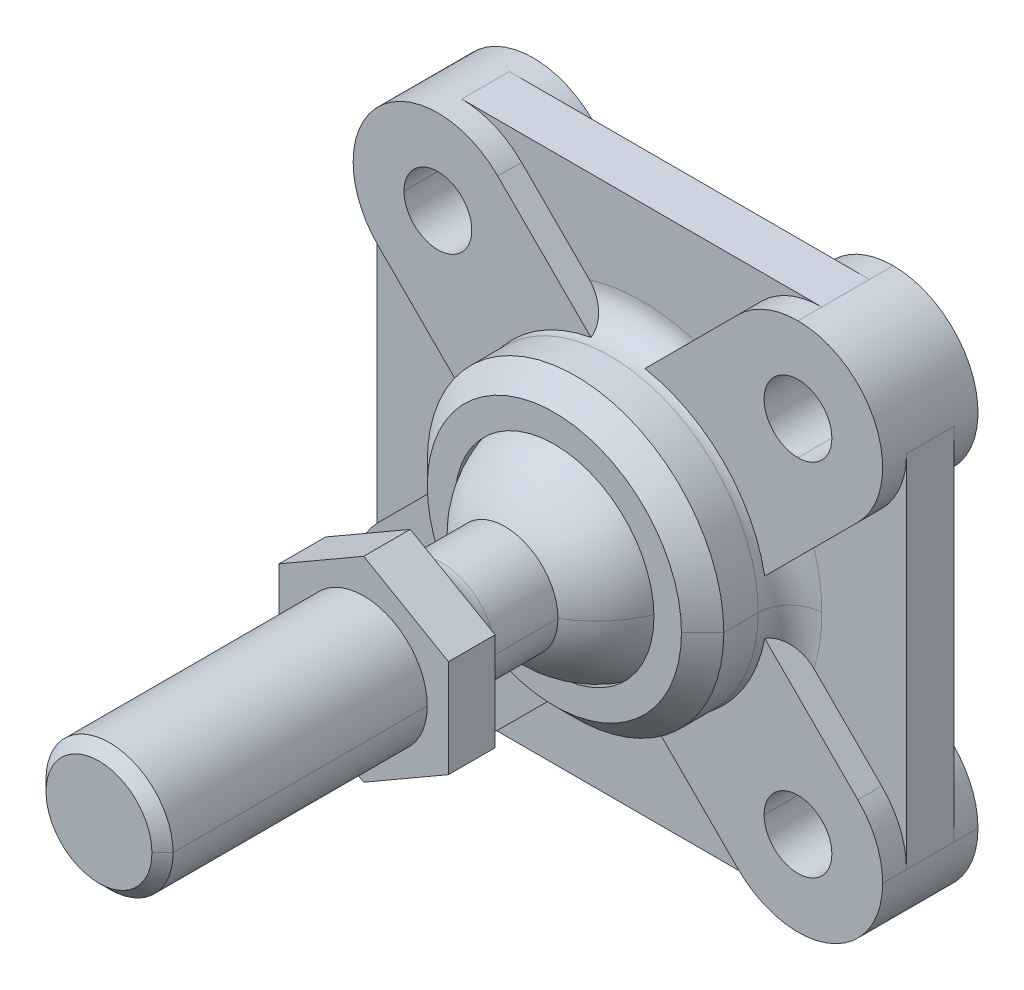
ISO-10303-21;
HEADER;
FILE_DESCRIPTION(('STEP AP214'),'2;1');
FILE_NAME('part.step','',(''),(''),'','','');
FILE_SCHEMA(('AUTOMOTIVE_DESIGN { 1 0 10303 214 1 1 1 1 }'));
ENDSEC;
DATA;
#1=APPLICATION_CONTEXT('core data for automotive mechanical design processes');
#2=APPLICATION_PROTOCOL_DEFINITION('international standard','automotive_design',2000,#1);
#3=PRODUCT_CONTEXT('',#1,'mechanical');
#4=PRODUCT('Part','Part','',(#3));
#5=PRODUCT_RELATED_PRODUCT_CATEGORY('part','',(#4));
#6=PRODUCT_DEFINITION_FORMATION('','',#4);
#7=PRODUCT_DEFINITION_CONTEXT('part definition',#1,'design');
#8=PRODUCT_DEFINITION('design','',#6,#7);
#9=PRODUCT_DEFINITION_SHAPE('','',#8);
#10=(LENGTH_UNIT() NAMED_UNIT(*) SI_UNIT(.MILLI.,.METRE.));
#11=(NAMED_UNIT(*) PLANE_ANGLE_UNIT() SI_UNIT($,.RADIAN.));
#12=(NAMED_UNIT(*) SI_UNIT($,.STERADIAN.) SOLID_ANGLE_UNIT());
#13=UNCERTAINTY_MEASURE_WITH_UNIT(LENGTH_MEASURE(1.E-05),#10,'distance_accuracy_value','');
#14=(GEOMETRIC_REPRESENTATION_CONTEXT(3) GLOBAL_UNCERTAINTY_ASSIGNED_CONTEXT((#13)) GLOBAL_UNIT_ASSIGNED_CONTEXT((#10,
#11,#12)) REPRESENTATION_CONTEXT('',''));
#15=CARTESIAN_POINT('',(0.,0.,0.));
#16=DIRECTION('',(0.,0.,1.));
#17=DIRECTION('',(1.,0.,0.));
#18=AXIS2_PLACEMENT_3D('',#15,#16,#17);
#19=CARTESIAN_POINT('',(-8.5,8.5,1.125));
#20=DIRECTION('',(0.,0.,1.));
#21=DIRECTION('',(-1.,0.,0.));
#22=AXIS2_PLACEMENT_3D('',#19,#20,#21);
#23=CYLINDRICAL_SURFACE('',#22,4.);
#24=DIRECTION('',(0.,0.,1.));
#25=VECTOR('',#24,1.);
#26=CARTESIAN_POINT('',(-12.5,8.5,1.125));
#27=LINE('',#26,#25);
#28=CARTESIAN_POINT('',(-12.5,8.5,3.375));
#29=VERTEX_POINT('',#28);
#30=CARTESIAN_POINT('',(-12.5,8.5,4.5));
#31=VERTEX_POINT('',#30);
#32=EDGE_CURVE('P0_E1572',#29,#31,#27,.T.);
#33=ORIENTED_EDGE('',*,*,#32,.T.);
#34=CARTESIAN_POINT('',(-8.5,8.5,4.5));
#35=DIRECTION('',(0.,0.,-1.));
#36=DIRECTION('',(-0.707106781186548,-0.707106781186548,0.));
#37=AXIS2_PLACEMENT_3D('',#34,#35,#36);
#38=CIRCLE('',#37,4.);
#39=CARTESIAN_POINT('',(-5.67157287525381,11.3284271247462,4.5));
#40=VERTEX_POINT('',#39);
#41=EDGE_CURVE('P0_E566',#31,#40,#38,.T.);
#42=ORIENTED_EDGE('',*,*,#41,.T.);
#43=DIRECTION('',(0.,0.,1.));
#44=VECTOR('',#43,1.);
#45=CARTESIAN_POINT('',(-5.67157287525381,11.3284271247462,0.));
#46=LINE('',#45,#44);
#47=CARTESIAN_POINT('',(-5.67157287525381,11.3284271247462,3.375));
#48=VERTEX_POINT('',#47);
#49=EDGE_CURVE('P0_E548',#48,#40,#46,.T.);
#50=ORIENTED_EDGE('',*,*,#49,.F.);
#51=CARTESIAN_POINT('',(-8.5,8.5,3.375));
#52=DIRECTION('',(0.,0.,-1.));
#53=DIRECTION('',(-0.707106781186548,-0.707106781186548,0.));
#54=AXIS2_PLACEMENT_3D('',#51,#52,#53);
#55=CIRCLE('',#54,4.);
#56=CARTESIAN_POINT('',(-8.5,12.5,3.375));
#57=VERTEX_POINT('',#56);
#58=EDGE_CURVE('P0_E906',#57,#48,#55,.T.);
#59=ORIENTED_EDGE('',*,*,#58,.F.);
#60=DIRECTION('',(0.,0.,1.));
#61=VECTOR('',#60,1.);
#62=CARTESIAN_POINT('',(-8.5,12.5,1.125));
#63=LINE('',#62,#61);
#64=CARTESIAN_POINT('',(-8.5,12.5,1.125));
#65=VERTEX_POINT('',#64);
#66=EDGE_CURVE('P0_E655',#65,#57,#63,.T.);
#67=ORIENTED_EDGE('',*,*,#66,.F.);
#68=CARTESIAN_POINT('',(-8.5,8.5,1.125));
#69=DIRECTION('',(0.,0.,1.));
#70=DIRECTION('',(-0.707106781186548,-0.707106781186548,0.));
#71=AXIS2_PLACEMENT_3D('',#68,#69,#70);
#72=CIRCLE('',#71,4.);
#73=CARTESIAN_POINT('',(-5.67157287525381,11.3284271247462,1.125));
#74=VERTEX_POINT('',#73);
#75=EDGE_CURVE('P0_E632',#74,#65,#72,.T.);
#76=ORIENTED_EDGE('',*,*,#75,.F.);
#77=DIRECTION('',(0.,0.,1.));
#78=VECTOR('',#77,1.);
#79=CARTESIAN_POINT('',(-5.67157287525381,11.3284271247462,0.));
#80=LINE('',#79,#78);
#81=CARTESIAN_POINT('',(-5.67157287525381,11.3284271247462,0.));
#82=VERTEX_POINT('',#81);
#83=EDGE_CURVE('P0_E643',#82,#74,#80,.T.);
#84=ORIENTED_EDGE('',*,*,#83,.F.);
#85=CARTESIAN_POINT('',(-8.5,8.5,0.));
#86=DIRECTION('',(0.,0.,-1.));
#87=DIRECTION('',(-0.707106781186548,-0.707106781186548,0.));
#88=AXIS2_PLACEMENT_3D('',#85,#86,#87);
#89=CIRCLE('',#88,4.);
#90=CARTESIAN_POINT('',(-12.5,8.5,0.));
#91=VERTEX_POINT('',#90);
#92=EDGE_CURVE('P0_E43',#91,#82,#89,.T.);
#93=ORIENTED_EDGE('',*,*,#92,.F.);
#94=DIRECTION('',(0.,0.,1.));
#95=VECTOR('',#94,1.);
#96=CARTESIAN_POINT('',(-12.5,8.5,1.125));
#97=LINE('',#96,#95);
#98=CARTESIAN_POINT('',(-12.5,8.5,1.125));
#99=VERTEX_POINT('',#98);
#100=EDGE_CURVE('P0_E1842',#91,#99,#97,.T.);
#101=ORIENTED_EDGE('',*,*,#100,.T.);
#102=DIRECTION('',(0.,0.,1.));
#103=VECTOR('',#102,1.);
#104=CARTESIAN_POINT('',(-12.5,8.5,1.125));
#105=LINE('',#104,#103);
#106=EDGE_CURVE('P0_E11',#99,#29,#105,.T.);
#107=ORIENTED_EDGE('',*,*,#106,.T.);
#108=EDGE_LOOP('',(#33,#42,#50,#59,#67,#76,#84,#93,#101,#107));
#109=FACE_BOUND('',#108,.T.);
#110=ADVANCED_FACE('P0_F19',(#109),#23,.T.);
#111=CARTESIAN_POINT('',(-12.5,0.,1.125));
#112=DIRECTION('',(-1.,0.,0.));
#113=DIRECTION('',(0.,0.,1.));
#114=AXIS2_PLACEMENT_3D('',#111,#112,#113);
#115=PLANE('',#114);
#116=DIRECTION('',(0.,1.,0.));
#117=VECTOR('',#116,1.);
#118=CARTESIAN_POINT('',(-12.5,-8.5,3.375));
#119=LINE('',#118,#117);
#120=CARTESIAN_POINT('',(-12.5,-8.5,3.375));
#121=VERTEX_POINT('',#120);
#122=EDGE_CURVE('P0_E1242',#121,#29,#119,.T.);
#123=ORIENTED_EDGE('',*,*,#122,.T.);
#124=ORIENTED_EDGE('',*,*,#106,.F.);
#125=DIRECTION('',(0.,1.,0.));
#126=VECTOR('',#125,1.);
#127=CARTESIAN_POINT('',(-12.5,-8.5,1.125));
#128=LINE('',#127,#126);
#129=CARTESIAN_POINT('',(-12.5,-8.5,1.125));
#130=VERTEX_POINT('',#129);
#131=EDGE_CURVE('P0_E579',#130,#99,#128,.T.);
#132=ORIENTED_EDGE('',*,*,#131,.F.);
#133=DIRECTION('',(0.,0.,1.));
#134=VECTOR('',#133,1.);
#135=CARTESIAN_POINT('',(-12.5,-8.5,1.125));
#136=LINE('',#135,#134);
#137=EDGE_CURVE('P0_E29',#130,#121,#136,.T.);
#138=ORIENTED_EDGE('',*,*,#137,.T.);
#139=EDGE_LOOP('',(#123,#124,#132,#138));
#140=FACE_BOUND('',#139,.T.);
#141=ADVANCED_FACE('P0_F2427',(#140),#115,.T.);
#142=CARTESIAN_POINT('',(-8.5,-8.5,1.125));
#143=DIRECTION('',(0.,0.,1.));
#144=DIRECTION('',(0.,-1.,0.));
#145=AXIS2_PLACEMENT_3D('',#142,#143,#144);
#146=CYLINDRICAL_SURFACE('',#145,4.);
#147=DIRECTION('',(0.,0.,1.));
#148=VECTOR('',#147,1.);
#149=CARTESIAN_POINT('',(-8.5,-12.5,1.125));
#150=LINE('',#149,#148);
#151=CARTESIAN_POINT('',(-8.5,-12.5,3.375));
#152=VERTEX_POINT('',#151);
#153=CARTESIAN_POINT('',(-8.5,-12.5,4.5));
#154=VERTEX_POINT('',#153);
#155=EDGE_CURVE('P0_E880',#152,#154,#150,.T.);
#156=ORIENTED_EDGE('',*,*,#155,.T.);
#157=CARTESIAN_POINT('',(-8.5,-8.5,4.5));
#158=DIRECTION('',(0.,0.,-1.));
#159=DIRECTION('',(0.707106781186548,-0.707106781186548,0.));
#160=AXIS2_PLACEMENT_3D('',#157,#158,#159);
#161=CIRCLE('',#160,4.);
#162=CARTESIAN_POINT('',(-11.3284271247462,-5.67157287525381,4.5));
#163=VERTEX_POINT('',#162);
#164=EDGE_CURVE('P0_E562',#154,#163,#161,.T.);
#165=ORIENTED_EDGE('',*,*,#164,.T.);
#166=DIRECTION('',(0.,0.,1.));
#167=VECTOR('',#166,1.);
#168=CARTESIAN_POINT('',(-11.3284271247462,-5.67157287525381,0.));
#169=LINE('',#168,#167);
#170=CARTESIAN_POINT('',(-11.3284271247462,-5.67157287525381,3.375));
#171=VERTEX_POINT('',#170);
#172=EDGE_CURVE('P0_E615',#171,#163,#169,.T.);
#173=ORIENTED_EDGE('',*,*,#172,.F.);
#174=CARTESIAN_POINT('',(-8.5,-8.5,3.375));
#175=DIRECTION('',(0.,0.,-1.));
#176=DIRECTION('',(0.707106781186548,-0.707106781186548,0.));
#177=AXIS2_PLACEMENT_3D('',#174,#175,#176);
#178=CIRCLE('',#177,4.);
#179=EDGE_CURVE('P0_E1245',#121,#171,#178,.T.);
#180=ORIENTED_EDGE('',*,*,#179,.F.);
#181=ORIENTED_EDGE('',*,*,#137,.F.);
#182=CARTESIAN_POINT('',(-8.5,-8.5,1.125));
#183=DIRECTION('',(0.,0.,1.));
#184=DIRECTION('',(0.707106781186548,-0.707106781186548,0.));
#185=AXIS2_PLACEMENT_3D('',#182,#183,#184);
#186=CIRCLE('',#185,4.);
#187=CARTESIAN_POINT('',(-11.3284271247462,-5.67157287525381,1.125));
#188=VERTEX_POINT('',#187);
#189=EDGE_CURVE('P0_E575',#188,#130,#186,.T.);
#190=ORIENTED_EDGE('',*,*,#189,.F.);
#191=DIRECTION('',(0.,0.,1.));
#192=VECTOR('',#191,1.);
#193=CARTESIAN_POINT('',(-11.3284271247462,-5.67157287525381,0.));
#194=LINE('',#193,#192);
#195=CARTESIAN_POINT('',(-11.3284271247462,-5.67157287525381,0.));
#196=VERTEX_POINT('',#195);
#197=EDGE_CURVE('P0_E513',#196,#188,#194,.T.);
#198=ORIENTED_EDGE('',*,*,#197,.F.);
#199=CARTESIAN_POINT('',(-8.5,-8.5,0.));
#200=DIRECTION('',(0.,0.,-1.));
#201=DIRECTION('',(0.707106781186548,-0.707106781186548,0.));
#202=AXIS2_PLACEMENT_3D('',#199,#200,#201);
#203=CIRCLE('',#202,4.);
#204=CARTESIAN_POINT('',(-8.5,-12.5,0.));
#205=VERTEX_POINT('',#204);
#206=EDGE_CURVE('P0_E261',#205,#196,#203,.T.);
#207=ORIENTED_EDGE('',*,*,#206,.F.);
#208=DIRECTION('',(0.,0.,1.));
#209=VECTOR('',#208,1.);
#210=CARTESIAN_POINT('',(-8.5,-12.5,1.125));
#211=LINE('',#210,#209);
#212=CARTESIAN_POINT('',(-8.5,-12.5,1.125));
#213=VERTEX_POINT('',#212);
#214=EDGE_CURVE('P0_E1232',#205,#213,#211,.T.);
#215=ORIENTED_EDGE('',*,*,#214,.T.);
#216=DIRECTION('',(0.,0.,1.));
#217=VECTOR('',#216,1.);
#218=CARTESIAN_POINT('',(-8.5,-12.5,1.125));
#219=LINE('',#218,#217);
#220=EDGE_CURVE('P0_E582',#213,#152,#219,.T.);
#221=ORIENTED_EDGE('',*,*,#220,.T.);
#222=EDGE_LOOP('',(#156,#165,#173,#180,#181,#190,#198,#207,#215,#221));
#223=FACE_BOUND('',#222,.T.);
#224=ADVANCED_FACE('P0_F1600',(#223),#146,.T.);
#225=CARTESIAN_POINT('',(0.,-12.5,1.125));
#226=DIRECTION('',(0.,-1.,0.));
#227=DIRECTION('',(0.,0.,-1.));
#228=AXIS2_PLACEMENT_3D('',#225,#226,#227);
#229=PLANE('',#228);
#230=DIRECTION('',(-1.,0.,0.));
#231=VECTOR('',#230,1.);
#232=CARTESIAN_POINT('',(8.5,-12.5,3.375));
#233=LINE('',#232,#231);
#234=CARTESIAN_POINT('',(8.5,-12.5,3.375));
#235=VERTEX_POINT('',#234);
#236=EDGE_CURVE('P0_E621',#235,#152,#233,.T.);
#237=ORIENTED_EDGE('',*,*,#236,.T.);
#238=ORIENTED_EDGE('',*,*,#220,.F.);
#239=DIRECTION('',(-1.,0.,0.));
#240=VECTOR('',#239,1.);
#241=CARTESIAN_POINT('',(8.5,-12.5,1.125));
#242=LINE('',#241,#240);
#243=CARTESIAN_POINT('',(8.5,-12.5,1.125));
#244=VERTEX_POINT('',#243);
#245=EDGE_CURVE('P0_E1180',#244,#213,#242,.T.);
#246=ORIENTED_EDGE('',*,*,#245,.F.);
#247=DIRECTION('',(0.,0.,1.));
#248=VECTOR('',#247,1.);
#249=CARTESIAN_POINT('',(8.5,-12.5,1.125));
#250=LINE('',#249,#248);
#251=EDGE_CURVE('P0_E664',#244,#235,#250,.T.);
#252=ORIENTED_EDGE('',*,*,#251,.T.);
#253=EDGE_LOOP('',(#237,#238,#246,#252));
#254=FACE_BOUND('',#253,.T.);
#255=ADVANCED_FACE('P0_F1520',(#254),#229,.T.);
#256=CARTESIAN_POINT('',(8.5,-8.5,1.125));
#257=DIRECTION('',(0.,0.,1.));
#258=DIRECTION('',(1.,0.,0.));
#259=AXIS2_PLACEMENT_3D('',#256,#257,#258);
#260=CYLINDRICAL_SURFACE('',#259,4.);
#261=DIRECTION('',(0.,0.,1.));
#262=VECTOR('',#261,1.);
#263=CARTESIAN_POINT('',(12.5,-8.5,1.125));
#264=LINE('',#263,#262);
#265=CARTESIAN_POINT('',(12.5,-8.5,3.375));
#266=VERTEX_POINT('',#265);
#267=CARTESIAN_POINT('',(12.5,-8.5,4.5));
#268=VERTEX_POINT('',#267);
#269=EDGE_CURVE('P0_E924',#266,#268,#264,.T.);
#270=ORIENTED_EDGE('',*,*,#269,.T.);
#271=CARTESIAN_POINT('',(8.5,-8.5,4.5));
#272=DIRECTION('',(0.,0.,-1.));
#273=DIRECTION('',(0.707106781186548,0.707106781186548,0.));
#274=AXIS2_PLACEMENT_3D('',#271,#272,#273);
#275=CIRCLE('',#274,4.);
#276=CARTESIAN_POINT('',(5.67157287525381,-11.3284271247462,4.5));
#277=VERTEX_POINT('',#276);
#278=EDGE_CURVE('P0_E719',#268,#277,#275,.T.);
#279=ORIENTED_EDGE('',*,*,#278,.T.);
#280=DIRECTION('',(0.,0.,1.));
#281=VECTOR('',#280,1.);
#282=CARTESIAN_POINT('',(5.67157287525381,-11.3284271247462,0.));
#283=LINE('',#282,#281);
#284=CARTESIAN_POINT('',(5.67157287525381,-11.3284271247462,3.375));
#285=VERTEX_POINT('',#284);
#286=EDGE_CURVE('P0_E839',#285,#277,#283,.T.);
#287=ORIENTED_EDGE('',*,*,#286,.F.);
#288=CARTESIAN_POINT('',(8.5,-8.5,3.375));
#289=DIRECTION('',(0.,0.,-1.));
#290=DIRECTION('',(0.707106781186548,0.707106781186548,0.));
#291=AXIS2_PLACEMENT_3D('',#288,#289,#290);
#292=CIRCLE('',#291,4.);
#293=EDGE_CURVE('P0_E625',#235,#285,#292,.T.);
#294=ORIENTED_EDGE('',*,*,#293,.F.);
#295=ORIENTED_EDGE('',*,*,#251,.F.);
#296=CARTESIAN_POINT('',(8.5,-8.5,1.125));
#297=DIRECTION('',(0.,0.,1.));
#298=DIRECTION('',(0.707106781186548,0.707106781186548,0.));
#299=AXIS2_PLACEMENT_3D('',#296,#297,#298);
#300=CIRCLE('',#299,4.);
#301=CARTESIAN_POINT('',(5.67157287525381,-11.3284271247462,1.125));
#302=VERTEX_POINT('',#301);
#303=EDGE_CURVE('P0_E1176',#302,#244,#300,.T.);
#304=ORIENTED_EDGE('',*,*,#303,.F.);
#305=DIRECTION('',(0.,0.,1.));
#306=VECTOR('',#305,1.);
#307=CARTESIAN_POINT('',(5.67157287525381,-11.3284271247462,0.));
#308=LINE('',#307,#306);
#309=CARTESIAN_POINT('',(5.67157287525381,-11.3284271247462,0.));
#310=VERTEX_POINT('',#309);
#311=EDGE_CURVE('P0_E512',#310,#302,#308,.T.);
#312=ORIENTED_EDGE('',*,*,#311,.F.);
#313=CARTESIAN_POINT('',(8.5,-8.5,0.));
#314=DIRECTION('',(0.,0.,-1.));
#315=DIRECTION('',(0.707106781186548,0.707106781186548,0.));
#316=AXIS2_PLACEMENT_3D('',#313,#314,#315);
#317=CIRCLE('',#316,4.);
#318=CARTESIAN_POINT('',(12.5,-8.5,0.));
#319=VERTEX_POINT('',#318);
#320=EDGE_CURVE('P0_E274',#319,#310,#317,.T.);
#321=ORIENTED_EDGE('',*,*,#320,.F.);
#322=DIRECTION('',(0.,0.,1.));
#323=VECTOR('',#322,1.);
#324=CARTESIAN_POINT('',(12.5,-8.5,1.125));
#325=LINE('',#324,#323);
#326=CARTESIAN_POINT('',(12.5,-8.5,1.125));
#327=VERTEX_POINT('',#326);
#328=EDGE_CURVE('P0_E869',#319,#327,#325,.T.);
#329=ORIENTED_EDGE('',*,*,#328,.T.);
#330=DIRECTION('',(0.,0.,1.));
#331=VECTOR('',#330,1.);
#332=CARTESIAN_POINT('',(12.5,-8.5,1.125));
#333=LINE('',#332,#331);
#334=EDGE_CURVE('P0_E661',#327,#266,#333,.T.);
#335=ORIENTED_EDGE('',*,*,#334,.T.);
#336=EDGE_LOOP('',(#270,#279,#287,#294,#295,#304,#312,#321,#329,#335));
#337=FACE_BOUND('',#336,.T.);
#338=ADVANCED_FACE('P0_F1517',(#337),#260,.T.);
#339=CARTESIAN_POINT('',(12.5,-4.25,1.125));
#340=DIRECTION('',(1.,0.,0.));
#341=DIRECTION('',(0.,1.,0.));
#342=AXIS2_PLACEMENT_3D('',#339,#340,#341);
#343=PLANE('',#342);
#344=DIRECTION('',(0.,-1.,0.));
#345=VECTOR('',#344,1.);
#346=CARTESIAN_POINT('',(12.5,8.5,3.375));
#347=LINE('',#346,#345);
#348=CARTESIAN_POINT('',(12.5,8.5,3.375));
#349=VERTEX_POINT('',#348);
#350=EDGE_CURVE('P0_E553',#349,#266,#347,.T.);
#351=ORIENTED_EDGE('',*,*,#350,.T.);
#352=ORIENTED_EDGE('',*,*,#334,.F.);
#353=DIRECTION('',(0.,-1.,0.));
#354=VECTOR('',#353,1.);
#355=CARTESIAN_POINT('',(12.5,8.5,1.125));
#356=LINE('',#355,#354);
#357=CARTESIAN_POINT('',(12.5,8.5,1.125));
#358=VERTEX_POINT('',#357);
#359=EDGE_CURVE('P0_E935',#358,#327,#356,.T.);
#360=ORIENTED_EDGE('',*,*,#359,.F.);
#361=DIRECTION('',(0.,0.,1.));
#362=VECTOR('',#361,1.);
#363=CARTESIAN_POINT('',(12.5,8.5,1.125));
#364=LINE('',#363,#362);
#365=EDGE_CURVE('P0_E658',#358,#349,#364,.T.);
#366=ORIENTED_EDGE('',*,*,#365,.T.);
#367=EDGE_LOOP('',(#351,#352,#360,#366));
#368=FACE_BOUND('',#367,.T.);
#369=ADVANCED_FACE('P0_F1283',(#368),#343,.T.);
#370=CARTESIAN_POINT('',(8.5,8.5,1.125));
#371=DIRECTION('',(0.,0.,1.));
#372=DIRECTION('',(0.,1.,0.));
#373=AXIS2_PLACEMENT_3D('',#370,#371,#372);
#374=CYLINDRICAL_SURFACE('',#373,4.);
#375=DIRECTION('',(0.,0.,1.));
#376=VECTOR('',#375,1.);
#377=CARTESIAN_POINT('',(8.5,12.5,1.125));
#378=LINE('',#377,#376);
#379=CARTESIAN_POINT('',(8.5,12.5,3.375));
#380=VERTEX_POINT('',#379);
#381=CARTESIAN_POINT('',(8.5,12.5,4.5));
#382=VERTEX_POINT('',#381);
#383=EDGE_CURVE('P0_E972',#380,#382,#378,.T.);
#384=ORIENTED_EDGE('',*,*,#383,.T.);
#385=CARTESIAN_POINT('',(8.5,8.5,4.5));
#386=DIRECTION('',(0.,0.,-1.));
#387=DIRECTION('',(-0.707106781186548,0.707106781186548,0.));
#388=AXIS2_PLACEMENT_3D('',#385,#386,#387);
#389=CIRCLE('',#388,4.);
#390=CARTESIAN_POINT('',(11.3284271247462,5.67157287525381,4.5));
#391=VERTEX_POINT('',#390);
#392=EDGE_CURVE('P0_E561',#382,#391,#389,.T.);
#393=ORIENTED_EDGE('',*,*,#392,.T.);
#394=DIRECTION('',(0.,0.,1.));
#395=VECTOR('',#394,1.);
#396=CARTESIAN_POINT('',(11.3284271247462,5.67157287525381,0.));
#397=LINE('',#396,#395);
#398=CARTESIAN_POINT('',(11.3284271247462,5.67157287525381,3.375));
#399=VERTEX_POINT('',#398);
#400=EDGE_CURVE('P0_E741',#399,#391,#397,.T.);
#401=ORIENTED_EDGE('',*,*,#400,.F.);
#402=CARTESIAN_POINT('',(8.5,8.5,3.375));
#403=DIRECTION('',(0.,0.,-1.));
#404=DIRECTION('',(-0.707106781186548,0.707106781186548,0.));
#405=AXIS2_PLACEMENT_3D('',#402,#403,#404);
#406=CIRCLE('',#405,4.);
#407=EDGE_CURVE('P0_E557',#349,#399,#406,.T.);
#408=ORIENTED_EDGE('',*,*,#407,.F.);
#409=ORIENTED_EDGE('',*,*,#365,.F.);
#410=CARTESIAN_POINT('',(8.5,8.5,1.125));
#411=DIRECTION('',(0.,0.,1.));
#412=DIRECTION('',(-0.707106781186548,0.707106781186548,0.));
#413=AXIS2_PLACEMENT_3D('',#410,#411,#412);
#414=CIRCLE('',#413,4.);
#415=CARTESIAN_POINT('',(11.3284271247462,5.67157287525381,1.125));
#416=VERTEX_POINT('',#415);
#417=EDGE_CURVE('P0_E1170',#416,#358,#414,.T.);
#418=ORIENTED_EDGE('',*,*,#417,.F.);
#419=DIRECTION('',(0.,0.,1.));
#420=VECTOR('',#419,1.);
#421=CARTESIAN_POINT('',(11.3284271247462,5.67157287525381,0.));
#422=LINE('',#421,#420);
#423=CARTESIAN_POINT('',(11.3284271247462,5.67157287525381,0.));
#424=VERTEX_POINT('',#423);
#425=EDGE_CURVE('P0_E612',#424,#416,#422,.T.);
#426=ORIENTED_EDGE('',*,*,#425,.F.);
#427=CARTESIAN_POINT('',(8.5,8.5,0.));
#428=DIRECTION('',(0.,0.,-1.));
#429=DIRECTION('',(-0.707106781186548,0.707106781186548,0.));
#430=AXIS2_PLACEMENT_3D('',#427,#428,#429);
#431=CIRCLE('',#430,4.);
#432=CARTESIAN_POINT('',(8.5,12.5,0.));
#433=VERTEX_POINT('',#432);
#434=EDGE_CURVE('P0_E608',#433,#424,#431,.T.);
#435=ORIENTED_EDGE('',*,*,#434,.F.);
#436=DIRECTION('',(0.,0.,1.));
#437=VECTOR('',#436,1.);
#438=CARTESIAN_POINT('',(8.5,12.5,1.125));
#439=LINE('',#438,#437);
#440=CARTESIAN_POINT('',(8.5,12.5,1.125));
#441=VERTEX_POINT('',#440);
#442=EDGE_CURVE('P0_E949',#433,#441,#439,.T.);
#443=ORIENTED_EDGE('',*,*,#442,.T.);
#444=DIRECTION('',(0.,0.,1.));
#445=VECTOR('',#444,1.);
#446=CARTESIAN_POINT('',(8.5,12.5,1.125));
#447=LINE('',#446,#445);
#448=EDGE_CURVE('P0_E652',#441,#380,#447,.T.);
#449=ORIENTED_EDGE('',*,*,#448,.T.);
#450=EDGE_LOOP('',(#384,#393,#401,#408,#409,#418,#426,#435,#443,#449));
#451=FACE_BOUND('',#450,.T.);
#452=ADVANCED_FACE('P0_F1256',(#451),#374,.T.);
#453=CARTESIAN_POINT('',(0.,12.5,1.125));
#454=DIRECTION('',(0.,1.,0.));
#455=DIRECTION('',(1.,0.,0.));
#456=AXIS2_PLACEMENT_3D('',#453,#454,#455);
#457=PLANE('',#456);
#458=DIRECTION('',(1.,0.,0.));
#459=VECTOR('',#458,1.);
#460=CARTESIAN_POINT('',(-8.5,12.5,3.375));
#461=LINE('',#460,#459);
#462=EDGE_CURVE('P0_E910',#57,#380,#461,.T.);
#463=ORIENTED_EDGE('',*,*,#462,.T.);
#464=ORIENTED_EDGE('',*,*,#448,.F.);
#465=DIRECTION('',(1.,0.,0.));
#466=VECTOR('',#465,1.);
#467=CARTESIAN_POINT('',(-8.5,12.5,1.125));
#468=LINE('',#467,#466);
#469=EDGE_CURVE('P0_E636',#65,#441,#468,.T.);
#470=ORIENTED_EDGE('',*,*,#469,.F.);
#471=ORIENTED_EDGE('',*,*,#66,.T.);
#472=EDGE_LOOP('',(#463,#464,#470,#471));
#473=FACE_BOUND('',#472,.T.);
#474=ADVANCED_FACE('P0_F1304',(#473),#457,.T.);
#475=CARTESIAN_POINT('',(2.78534402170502E-13,0.,0.));
#476=DIRECTION('',(0.,0.,-1.));
#477=DIRECTION('',(0.,-1.,0.));
#478=AXIS2_PLACEMENT_3D('',#475,#476,#477);
#479=PLANE('',#478);
#480=CARTESIAN_POINT('',(-8.5,8.5,0.));
#481=DIRECTION('',(0.,0.,1.));
#482=DIRECTION('',(-1.,0.,0.));
#483=AXIS2_PLACEMENT_3D('',#480,#481,#482);
#484=CIRCLE('',#483,1.6);
#485=CARTESIAN_POINT('',(-10.1,8.5,0.));
#486=VERTEX_POINT('',#485);
#487=CARTESIAN_POINT('',(-6.9,8.5,0.));
#488=VERTEX_POINT('',#487);
#489=EDGE_CURVE('P0_E1097',#486,#488,#484,.T.);
#490=ORIENTED_EDGE('',*,*,#489,.T.);
#491=CARTESIAN_POINT('',(-8.5,8.5,0.));
#492=DIRECTION('',(0.,0.,1.));
#493=DIRECTION('',(-1.,0.,0.));
#494=AXIS2_PLACEMENT_3D('',#491,#492,#493);
#495=CIRCLE('',#494,1.6);
#496=EDGE_CURVE('P0_E1039',#488,#486,#495,.T.);
#497=ORIENTED_EDGE('',*,*,#496,.T.);
#498=EDGE_LOOP('',(#490,#497));
#499=FACE_BOUND('',#498,.T.);
#500=CARTESIAN_POINT('',(0.,0.,0.));
#501=DIRECTION('',(0.,0.,1.));
#502=DIRECTION('',(1.,0.,0.));
#503=AXIS2_PLACEMENT_3D('',#500,#501,#502);
#504=CIRCLE('',#503,7.);
#505=CARTESIAN_POINT('',(-1.23359207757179,6.89044632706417,0.));
#506=VERTEX_POINT('',#505);
#507=CARTESIAN_POINT('',(-6.89044632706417,1.23359207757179,0.));
#508=VERTEX_POINT('',#507);
#509=EDGE_CURVE('P0_E1049',#506,#508,#504,.T.);
#510=ORIENTED_EDGE('',*,*,#509,.T.);
#511=DIRECTION('',(-0.707106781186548,0.707106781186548,0.));
#512=VECTOR('',#511,1.);
#513=CARTESIAN_POINT('',(5.6715728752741,-11.3284271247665,0.));
#514=LINE('',#513,#512);
#515=CARTESIAN_POINT('',(-11.3284271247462,5.67157287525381,0.));
#516=VERTEX_POINT('',#515);
#517=EDGE_CURVE('P0_E646',#508,#516,#514,.T.);
#518=ORIENTED_EDGE('',*,*,#517,.T.);
#519=CARTESIAN_POINT('',(-8.5,8.5,0.));
#520=DIRECTION('',(0.,0.,-1.));
#521=DIRECTION('',(-0.707106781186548,-0.707106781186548,0.));
#522=AXIS2_PLACEMENT_3D('',#519,#520,#521);
#523=CIRCLE('',#522,4.);
#524=EDGE_CURVE('P0_E1838',#516,#91,#523,.T.);
#525=ORIENTED_EDGE('',*,*,#524,.T.);
#526=ORIENTED_EDGE('',*,*,#92,.T.);
#527=DIRECTION('',(0.707106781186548,-0.707106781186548,0.));
#528=VECTOR('',#527,1.);
#529=CARTESIAN_POINT('',(-5.6715728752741,11.3284271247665,0.));
#530=LINE('',#529,#528);
#531=EDGE_CURVE('P0_E640',#82,#506,#530,.T.);
#532=ORIENTED_EDGE('',*,*,#531,.T.);
#533=EDGE_LOOP('',(#510,#518,#525,#526,#532));
#534=FACE_BOUND('',#533,.T.);
#535=ADVANCED_FACE('P0_F779',(#499,#534),#479,.T.);
#536=CARTESIAN_POINT('',(2.82842712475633,2.82842712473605,0.));
#537=DIRECTION('',(0.707106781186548,0.707106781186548,0.));
#538=DIRECTION('',(0.,0.,-1.));
#539=AXIS2_PLACEMENT_3D('',#536,#537,#538);
#540=PLANE('',#539);
#541=DIRECTION('',(0.,0.,1.));
#542=VECTOR('',#541,1.);
#543=CARTESIAN_POINT('',(6.89044632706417,-1.23359207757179,0.5625));
#544=LINE('',#543,#542);
#545=CARTESIAN_POINT('',(6.89044632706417,-1.23359207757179,0.));
#546=VERTEX_POINT('',#545);
#547=CARTESIAN_POINT('',(6.89044632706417,-1.23359207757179,1.125));
#548=VERTEX_POINT('',#547);
#549=EDGE_CURVE('P0_E527',#546,#548,#544,.T.);
#550=ORIENTED_EDGE('',*,*,#549,.T.);
#551=DIRECTION('',(-0.707106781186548,0.707106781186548,0.));
#552=VECTOR('',#551,1.);
#553=CARTESIAN_POINT('',(2.82842712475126,2.82842712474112,1.125));
#554=LINE('',#553,#552);
#555=CARTESIAN_POINT('',(11.3284271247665,-5.6715728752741,1.125));
#556=VERTEX_POINT('',#555);
#557=EDGE_CURVE('P0_E931',#556,#548,#554,.T.);
#558=ORIENTED_EDGE('',*,*,#557,.F.);
#559=DIRECTION('',(0.,0.,1.));
#560=VECTOR('',#559,1.);
#561=CARTESIAN_POINT('',(11.3284271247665,-5.6715728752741,0.));
#562=LINE('',#561,#560);
#563=CARTESIAN_POINT('',(11.3284271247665,-5.6715728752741,0.));
#564=VERTEX_POINT('',#563);
#565=EDGE_CURVE('P0_E901',#564,#556,#562,.T.);
#566=ORIENTED_EDGE('',*,*,#565,.F.);
#567=DIRECTION('',(0.707106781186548,-0.707106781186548,0.));
#568=VECTOR('',#567,1.);
#569=CARTESIAN_POINT('',(-5.6715728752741,11.3284271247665,0.));
#570=LINE('',#569,#568);
#571=EDGE_CURVE('P0_E602',#546,#564,#570,.T.);
#572=ORIENTED_EDGE('',*,*,#571,.F.);
#573=EDGE_LOOP('',(#550,#558,#566,#572));
#574=FACE_BOUND('',#573,.T.);
#575=ADVANCED_FACE('P0_F1507',(#574),#540,.T.);
#576=CARTESIAN_POINT('',(-7.07842712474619,1.42157287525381,0.));
#577=DIRECTION('',(-0.707106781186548,-0.707106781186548,0.));
#578=DIRECTION('',(-0.707106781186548,0.707106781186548,0.));
#579=AXIS2_PLACEMENT_3D('',#576,#577,#578);
#580=PLANE('',#579);
#581=DIRECTION('',(0.,0.,1.));
#582=VECTOR('',#581,1.);
#583=CARTESIAN_POINT('',(-6.89044632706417,1.23359207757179,0.5625));
#584=LINE('',#583,#582);
#585=CARTESIAN_POINT('',(-6.89044632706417,1.23359207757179,1.125));
#586=VERTEX_POINT('',#585);
#587=EDGE_CURVE('P0_E1045',#508,#586,#584,.T.);
#588=ORIENTED_EDGE('',*,*,#587,.T.);
#589=DIRECTION('',(0.707106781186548,-0.707106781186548,0.));
#590=VECTOR('',#589,1.);
#591=CARTESIAN_POINT('',(-4.95342712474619,-0.703427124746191,1.125));
#592=LINE('',#591,#590);
#593=CARTESIAN_POINT('',(-11.3284271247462,5.67157287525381,1.125));
#594=VERTEX_POINT('',#593);
#595=EDGE_CURVE('P0_E586',#594,#586,#592,.T.);
#596=ORIENTED_EDGE('',*,*,#595,.F.);
#597=DIRECTION('',(0.,0.,1.));
#598=VECTOR('',#597,1.);
#599=CARTESIAN_POINT('',(-11.3284271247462,5.67157287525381,0.));
#600=LINE('',#599,#598);
#601=EDGE_CURVE('P0_E1834',#516,#594,#600,.T.);
#602=ORIENTED_EDGE('',*,*,#601,.F.);
#603=ORIENTED_EDGE('',*,*,#517,.F.);
#604=EDGE_LOOP('',(#588,#596,#602,#603));
#605=FACE_BOUND('',#604,.T.);
#606=ADVANCED_FACE('P0_F1504',(#605),#580,.T.);
#607=CARTESIAN_POINT('',(2.82842712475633,2.82842712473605,0.));
#608=DIRECTION('',(0.707106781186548,0.707106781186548,0.));
#609=DIRECTION('',(0.,0.,-1.));
#610=AXIS2_PLACEMENT_3D('',#607,#608,#609);
#611=PLANE('',#610);
#612=DIRECTION('',(0.,0.,-1.));
#613=VECTOR('',#612,1.);
#614=CARTESIAN_POINT('',(-1.23359207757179,6.89044632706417,0.5625));
#615=LINE('',#614,#613);
#616=CARTESIAN_POINT('',(-1.23359207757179,6.89044632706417,1.125));
#617=VERTEX_POINT('',#616);
#618=EDGE_CURVE('P0_E1190',#617,#506,#615,.T.);
#619=ORIENTED_EDGE('',*,*,#618,.T.);
#620=ORIENTED_EDGE('',*,*,#531,.F.);
#621=ORIENTED_EDGE('',*,*,#83,.T.);
#622=DIRECTION('',(-0.707106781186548,0.707106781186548,0.));
#623=VECTOR('',#622,1.);
#624=CARTESIAN_POINT('',(2.82842712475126,2.82842712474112,1.125));
#625=LINE('',#624,#623);
#626=EDGE_CURVE('P0_E628',#617,#74,#625,.T.);
#627=ORIENTED_EDGE('',*,*,#626,.F.);
#628=EDGE_LOOP('',(#619,#620,#621,#627));
#629=FACE_BOUND('',#628,.T.);
#630=ADVANCED_FACE('P0_F1506',(#629),#611,.T.);
#631=CARTESIAN_POINT('',(0.,0.,1.125));
#632=DIRECTION('',(0.,0.,-1.));
#633=DIRECTION('',(0.,-1.,0.));
#634=AXIS2_PLACEMENT_3D('',#631,#632,#633);
#635=PLANE('',#634);
#636=ORIENTED_EDGE('',*,*,#626,.T.);
#637=ORIENTED_EDGE('',*,*,#75,.T.);
#638=ORIENTED_EDGE('',*,*,#469,.T.);
#639=CARTESIAN_POINT('',(8.5,8.5,1.125));
#640=DIRECTION('',(0.,0.,1.));
#641=DIRECTION('',(-0.707106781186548,0.707106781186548,0.));
#642=AXIS2_PLACEMENT_3D('',#639,#640,#641);
#643=CIRCLE('',#642,4.);
#644=CARTESIAN_POINT('',(5.67157287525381,11.3284271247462,1.125));
#645=VERTEX_POINT('',#644);
#646=EDGE_CURVE('P0_E968',#441,#645,#643,.T.);
#647=ORIENTED_EDGE('',*,*,#646,.T.);
#648=DIRECTION('',(-0.707106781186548,-0.707106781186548,0.));
#649=VECTOR('',#648,1.);
#650=CARTESIAN_POINT('',(-0.703427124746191,4.95342712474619,1.125));
#651=LINE('',#650,#649);
#652=CARTESIAN_POINT('',(1.23359207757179,6.89044632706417,1.125));
#653=VERTEX_POINT('',#652);
#654=EDGE_CURVE('P0_E618',#645,#653,#651,.T.);
#655=ORIENTED_EDGE('',*,*,#654,.T.);
#656=CARTESIAN_POINT('',(0.,0.,1.125));
#657=DIRECTION('',(0.,0.,1.));
#658=DIRECTION('',(1.,0.,0.));
#659=AXIS2_PLACEMENT_3D('',#656,#657,#658);
#660=CIRCLE('',#659,7.);
#661=EDGE_CURVE('P0_E1021',#653,#617,#660,.T.);
#662=ORIENTED_EDGE('',*,*,#661,.T.);
#663=EDGE_LOOP('',(#636,#637,#638,#647,#655,#662));
#664=FACE_BOUND('',#663,.T.);
#665=ADVANCED_FACE('P0_F1300',(#664),#635,.T.);
#666=CARTESIAN_POINT('',(0.,0.,3.375));
#667=DIRECTION('',(0.,0.,-1.));
#668=DIRECTION('',(0.,-1.,0.));
#669=AXIS2_PLACEMENT_3D('',#666,#667,#668);
#670=PLANE('',#669);
#671=DIRECTION('',(-0.707106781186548,-0.707106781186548,0.));
#672=VECTOR('',#671,1.);
#673=CARTESIAN_POINT('',(2.82842712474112,-2.82842712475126,3.375));
#674=LINE('',#673,#672);
#675=CARTESIAN_POINT('',(-2.47487373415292,-8.1317279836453,3.375));
#676=VERTEX_POINT('',#675);
#677=CARTESIAN_POINT('',(-5.6715728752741,-11.3284271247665,3.375));
#678=VERTEX_POINT('',#677);
#679=EDGE_CURVE('P0_E712',#676,#678,#674,.T.);
#680=ORIENTED_EDGE('',*,*,#679,.T.);
#681=CARTESIAN_POINT('',(-8.5,-8.5,3.375));
#682=DIRECTION('',(0.,0.,-1.));
#683=DIRECTION('',(0.707106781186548,-0.707106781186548,0.));
#684=AXIS2_PLACEMENT_3D('',#681,#682,#683);
#685=CIRCLE('',#684,4.);
#686=EDGE_CURVE('P0_E875',#678,#152,#685,.T.);
#687=ORIENTED_EDGE('',*,*,#686,.T.);
#688=ORIENTED_EDGE('',*,*,#236,.F.);
#689=ORIENTED_EDGE('',*,*,#293,.T.);
#690=DIRECTION('',(-0.707106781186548,0.707106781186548,0.));
#691=VECTOR('',#690,1.);
#692=CARTESIAN_POINT('',(-4.95342712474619,-0.703427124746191,3.375));
#693=LINE('',#692,#691);
#694=CARTESIAN_POINT('',(2.47487373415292,-8.1317279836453,3.375));
#695=VERTEX_POINT('',#694);
#696=EDGE_CURVE('P0_E831',#285,#695,#693,.T.);
#697=ORIENTED_EDGE('',*,*,#696,.T.);
#698=CARTESIAN_POINT('',(0.,0.,3.375));
#699=DIRECTION('',(0.,0.,1.));
#700=DIRECTION('',(1.,0.,0.));
#701=AXIS2_PLACEMENT_3D('',#698,#699,#700);
#702=CIRCLE('',#701,8.5);
#703=EDGE_CURVE('P0_E842',#676,#695,#702,.T.);
#704=ORIENTED_EDGE('',*,*,#703,.F.);
#705=EDGE_LOOP('',(#680,#687,#688,#689,#697,#704));
#706=FACE_BOUND('',#705,.T.);
#707=ADVANCED_FACE('P0_F1471',(#706),#670,.F.);
#708=CARTESIAN_POINT('',(-7.07842712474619,1.42157287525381,0.));
#709=DIRECTION('',(-0.707106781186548,-0.707106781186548,0.));
#710=DIRECTION('',(-0.707106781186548,0.707106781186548,0.));
#711=AXIS2_PLACEMENT_3D('',#708,#709,#710);
#712=PLANE('',#711);
#713=CARTESIAN_POINT('',(-8.13172798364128,2.4748737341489,3.375));
#714=CARTESIAN_POINT('',(-7.93785179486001,2.28099754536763,3.375));
#715=CARTESIAN_POINT('',(-7.74933466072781,2.09248041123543,3.45168733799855));
#716=CARTESIAN_POINT('',(-7.56172038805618,1.9048661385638,3.52800739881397));
#717=CARTESIAN_POINT('',(-7.40103945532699,1.74418520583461,3.67220003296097));
#718=CARTESIAN_POINT('',(-7.2342327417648,1.57737849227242,3.82188985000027));
#719=CARTESIAN_POINT('',(-7.11467062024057,1.45781637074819,4.02737415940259));
#720=CARTESIAN_POINT('',(-6.98828443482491,1.33143018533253,4.24458658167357));
#721=CARTESIAN_POINT('',(-6.93148417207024,1.27462992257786,4.5000284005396));
#722=B_SPLINE_CURVE_WITH_KNOTS('',2,(#713,#714,#715,#716,#717,#718,#719,#720,#721),
.UNSPECIFIED.,.F.,.F.,(3,2,2,2,3),(0.,0.25,0.5,0.75,1.),.UNSPECIFIED.);
#723=CARTESIAN_POINT('',(-8.1317279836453,2.47487373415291,3.375));
#724=VERTEX_POINT('',#723);
#725=CARTESIAN_POINT('',(-6.93142031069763,1.27456606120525,4.5));
#726=VERTEX_POINT('',#725);
#727=EDGE_CURVE('P0_E677',#724,#726,#722,.T.);
#728=ORIENTED_EDGE('',*,*,#727,.T.);
#729=DIRECTION('',(-0.707106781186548,0.707106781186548,0.));
#730=VECTOR('',#729,1.);
#731=CARTESIAN_POINT('',(5.6715728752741,-11.3284271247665,4.5));
#732=LINE('',#731,#730);
#733=CARTESIAN_POINT('',(-11.3284271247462,5.67157287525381,4.5));
#734=VERTEX_POINT('',#733);
#735=EDGE_CURVE('P0_E570',#726,#734,#732,.T.);
#736=ORIENTED_EDGE('',*,*,#735,.T.);
#737=DIRECTION('',(0.,0.,1.));
#738=VECTOR('',#737,1.);
#739=CARTESIAN_POINT('',(-11.3284271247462,5.67157287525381,0.));
#740=LINE('',#739,#738);
#741=CARTESIAN_POINT('',(-11.3284271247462,5.67157287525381,3.375));
#742=VERTEX_POINT('',#741);
#743=EDGE_CURVE('P0_E1578',#742,#734,#740,.T.);
#744=ORIENTED_EDGE('',*,*,#743,.F.);
#745=DIRECTION('',(-0.707106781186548,0.707106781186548,0.));
#746=VECTOR('',#745,1.);
#747=CARTESIAN_POINT('',(-4.95342712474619,-0.703427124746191,3.375));
#748=LINE('',#747,#746);
#749=EDGE_CURVE('P0_E1010',#724,#742,#748,.T.);
#750=ORIENTED_EDGE('',*,*,#749,.F.);
#751=EDGE_LOOP('',(#728,#736,#744,#750));
#752=FACE_BOUND('',#751,.T.);
#753=ADVANCED_FACE('P0_F1461',(#752),#712,.T.);
#754=CARTESIAN_POINT('',(1.42157287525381,7.07842712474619,0.));
#755=DIRECTION('',(-0.707106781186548,0.707106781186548,0.));
#756=DIRECTION('',(0.,0.,1.));
#757=AXIS2_PLACEMENT_3D('',#754,#755,#756);
#758=PLANE('',#757);
#759=DIRECTION('',(0.,0.,1.));
#760=VECTOR('',#759,1.);
#761=CARTESIAN_POINT('',(1.23359207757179,6.89044632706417,0.5625));
#762=LINE('',#761,#760);
#763=CARTESIAN_POINT('',(1.23359207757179,6.89044632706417,0.));
#764=VERTEX_POINT('',#763);
#765=EDGE_CURVE('P0_E524',#764,#653,#762,.T.);
#766=ORIENTED_EDGE('',*,*,#765,.T.);
#767=ORIENTED_EDGE('',*,*,#654,.F.);
#768=DIRECTION('',(0.,0.,1.));
#769=VECTOR('',#768,1.);
#770=CARTESIAN_POINT('',(5.67157287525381,11.3284271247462,0.));
#771=LINE('',#770,#769);
#772=CARTESIAN_POINT('',(5.67157287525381,11.3284271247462,0.));
#773=VERTEX_POINT('',#772);
#774=EDGE_CURVE('P0_E948',#773,#645,#771,.T.);
#775=ORIENTED_EDGE('',*,*,#774,.F.);
#776=DIRECTION('',(0.707106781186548,0.707106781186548,0.));
#777=VECTOR('',#776,1.);
#778=CARTESIAN_POINT('',(-11.3284271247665,-5.6715728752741,0.));
#779=LINE('',#778,#777);
#780=EDGE_CURVE('P0_E605',#764,#773,#779,.T.);
#781=ORIENTED_EDGE('',*,*,#780,.F.);
#782=EDGE_LOOP('',(#766,#767,#775,#781));
#783=FACE_BOUND('',#782,.T.);
#784=ADVANCED_FACE('P0_F1425',(#783),#758,.T.);
#785=CARTESIAN_POINT('',(1.42157287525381,7.07842712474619,0.));
#786=DIRECTION('',(-0.707106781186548,0.707106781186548,0.));
#787=DIRECTION('',(0.,0.,1.));
#788=AXIS2_PLACEMENT_3D('',#785,#786,#787);
#789=PLANE('',#788);
#790=CARTESIAN_POINT('',(-6.93148417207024,-1.27462992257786,4.50002840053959));
#791=CARTESIAN_POINT('',(-6.98817239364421,-1.33131814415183,4.24509045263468));
#792=CARTESIAN_POINT('',(-7.11467062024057,-1.45781637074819,4.0273741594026));
#793=CARTESIAN_POINT('',(-7.23363024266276,-1.57677599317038,3.82263256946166));
#794=CARTESIAN_POINT('',(-7.40103945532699,-1.74418520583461,3.67220003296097));
#795=CARTESIAN_POINT('',(-7.56101498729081,-1.90416073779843,3.52844734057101));
#796=CARTESIAN_POINT('',(-7.74933466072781,-2.09248041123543,3.45168733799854));
#797=CARTESIAN_POINT('',(-7.93747606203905,-2.28062181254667,3.375));
#798=CARTESIAN_POINT('',(-8.13172798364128,-2.4748737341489,3.375));
#799=B_SPLINE_CURVE_WITH_KNOTS('',2,(#790,#791,#792,#793,#794,#795,#796,#797,#798),
.UNSPECIFIED.,.F.,.F.,(3,2,2,2,3),(0.,0.25,0.5,0.75,1.),.UNSPECIFIED.);
#800=CARTESIAN_POINT('',(-6.93142031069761,-1.27456606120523,4.5));
#801=VERTEX_POINT('',#800);
#802=CARTESIAN_POINT('',(-8.1317279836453,-2.47487373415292,3.375));
#803=VERTEX_POINT('',#802);
#804=EDGE_CURVE('P0_E690',#801,#803,#799,.T.);
#805=ORIENTED_EDGE('',*,*,#804,.T.);
#806=DIRECTION('',(0.707106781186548,0.707106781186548,0.));
#807=VECTOR('',#806,1.);
#808=CARTESIAN_POINT('',(-0.703427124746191,4.95342712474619,3.375));
#809=LINE('',#808,#807);
#810=EDGE_CURVE('P0_E713',#171,#803,#809,.T.);
#811=ORIENTED_EDGE('',*,*,#810,.F.);
#812=ORIENTED_EDGE('',*,*,#172,.T.);
#813=DIRECTION('',(0.707106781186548,0.707106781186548,0.));
#814=VECTOR('',#813,1.);
#815=CARTESIAN_POINT('',(-11.3284271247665,-5.6715728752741,4.5));
#816=LINE('',#815,#814);
#817=EDGE_CURVE('P0_E567',#163,#801,#816,.T.);
#818=ORIENTED_EDGE('',*,*,#817,.T.);
#819=EDGE_LOOP('',(#805,#811,#812,#818));
#820=FACE_BOUND('',#819,.T.);
#821=ADVANCED_FACE('P0_F1403',(#820),#789,.T.);
#822=CARTESIAN_POINT('',(2.82842712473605,-2.82842712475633,0.));
#823=DIRECTION('',(0.707106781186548,-0.707106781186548,0.));
#824=DIRECTION('',(0.,0.,-1.));
#825=AXIS2_PLACEMENT_3D('',#822,#823,#824);
#826=PLANE('',#825);
#827=DIRECTION('',(0.,0.,1.));
#828=VECTOR('',#827,1.);
#829=CARTESIAN_POINT('',(-1.23359207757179,-6.89044632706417,0.5625));
#830=LINE('',#829,#828);
#831=CARTESIAN_POINT('',(-1.23359207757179,-6.89044632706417,0.));
#832=VERTEX_POINT('',#831);
#833=CARTESIAN_POINT('',(-1.23359207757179,-6.89044632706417,1.125));
#834=VERTEX_POINT('',#833);
#835=EDGE_CURVE('P0_E1194',#832,#834,#830,.T.);
#836=ORIENTED_EDGE('',*,*,#835,.T.);
#837=DIRECTION('',(0.707106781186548,0.707106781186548,0.));
#838=VECTOR('',#837,1.);
#839=CARTESIAN_POINT('',(2.82842712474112,-2.82842712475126,1.125));
#840=LINE('',#839,#838);
#841=CARTESIAN_POINT('',(-5.6715728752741,-11.3284271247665,1.125));
#842=VERTEX_POINT('',#841);
#843=EDGE_CURVE('P0_E1050',#842,#834,#840,.T.);
#844=ORIENTED_EDGE('',*,*,#843,.F.);
#845=DIRECTION('',(0.,0.,1.));
#846=VECTOR('',#845,1.);
#847=CARTESIAN_POINT('',(-5.6715728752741,-11.3284271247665,0.));
#848=LINE('',#847,#846);
#849=CARTESIAN_POINT('',(-5.6715728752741,-11.3284271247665,0.));
#850=VERTEX_POINT('',#849);
#851=EDGE_CURVE('P0_E1222',#850,#842,#848,.T.);
#852=ORIENTED_EDGE('',*,*,#851,.F.);
#853=DIRECTION('',(-0.707106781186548,-0.707106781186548,0.));
#854=VECTOR('',#853,1.);
#855=CARTESIAN_POINT('',(11.3284271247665,5.6715728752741,0.));
#856=LINE('',#855,#854);
#857=EDGE_CURVE('P0_E596',#832,#850,#856,.T.);
#858=ORIENTED_EDGE('',*,*,#857,.F.);
#859=EDGE_LOOP('',(#836,#844,#852,#858));
#860=FACE_BOUND('',#859,.T.);
#861=ADVANCED_FACE('P0_F1223',(#860),#826,.T.);
#862=CARTESIAN_POINT('',(2.82842712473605,-2.82842712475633,0.));
#863=DIRECTION('',(0.707106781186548,-0.707106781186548,0.));
#864=DIRECTION('',(0.,0.,-1.));
#865=AXIS2_PLACEMENT_3D('',#862,#863,#864);
#866=PLANE('',#865);
#867=DIRECTION('',(0.,0.,-1.));
#868=VECTOR('',#867,1.);
#869=CARTESIAN_POINT('',(6.89044632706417,1.23359207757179,0.5625));
#870=LINE('',#869,#868);
#871=CARTESIAN_POINT('',(6.89044632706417,1.23359207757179,1.125));
#872=VERTEX_POINT('',#871);
#873=CARTESIAN_POINT('',(6.89044632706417,1.23359207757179,0.));
#874=VERTEX_POINT('',#873);
#875=EDGE_CURVE('P0_E544',#872,#874,#870,.T.);
#876=ORIENTED_EDGE('',*,*,#875,.T.);
#877=DIRECTION('',(-0.707106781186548,-0.707106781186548,0.));
#878=VECTOR('',#877,1.);
#879=CARTESIAN_POINT('',(11.3284271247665,5.6715728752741,0.));
#880=LINE('',#879,#878);
#881=EDGE_CURVE('P0_E609',#424,#874,#880,.T.);
#882=ORIENTED_EDGE('',*,*,#881,.F.);
#883=ORIENTED_EDGE('',*,*,#425,.T.);
#884=DIRECTION('',(0.707106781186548,0.707106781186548,0.));
#885=VECTOR('',#884,1.);
#886=CARTESIAN_POINT('',(2.82842712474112,-2.82842712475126,1.125));
#887=LINE('',#886,#885);
#888=EDGE_CURVE('P0_E1166',#872,#416,#887,.T.);
#889=ORIENTED_EDGE('',*,*,#888,.F.);
#890=EDGE_LOOP('',(#876,#882,#883,#889));
#891=FACE_BOUND('',#890,.T.);
#892=ADVANCED_FACE('P0_F1289',(#891),#866,.T.);
#893=CARTESIAN_POINT('',(2.78534402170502E-13,0.,0.));
#894=DIRECTION('',(0.,0.,-1.));
#895=DIRECTION('',(0.,-1.,0.));
#896=AXIS2_PLACEMENT_3D('',#893,#894,#895);
#897=PLANE('',#896);
#898=CARTESIAN_POINT('',(8.5,8.5,0.));
#899=DIRECTION('',(0.,0.,1.));
#900=DIRECTION('',(0.,1.,0.));
#901=AXIS2_PLACEMENT_3D('',#898,#899,#900);
#902=CIRCLE('',#901,1.6);
#903=CARTESIAN_POINT('',(8.5,10.1,0.));
#904=VERTEX_POINT('',#903);
#905=CARTESIAN_POINT('',(8.5,6.9,0.));
#906=VERTEX_POINT('',#905);
#907=EDGE_CURVE('P0_E1040',#904,#906,#902,.T.);
#908=ORIENTED_EDGE('',*,*,#907,.T.);
#909=CARTESIAN_POINT('',(8.5,8.5,0.));
#910=DIRECTION('',(0.,0.,1.));
#911=DIRECTION('',(0.,1.,0.));
#912=AXIS2_PLACEMENT_3D('',#909,#910,#911);
#913=CIRCLE('',#912,1.6);
#914=EDGE_CURVE('P0_E891',#906,#904,#913,.T.);
#915=ORIENTED_EDGE('',*,*,#914,.T.);
#916=EDGE_LOOP('',(#908,#915));
#917=FACE_BOUND('',#916,.T.);
#918=CARTESIAN_POINT('',(0.,0.,0.));
#919=DIRECTION('',(0.,0.,1.));
#920=DIRECTION('',(1.,0.,0.));
#921=AXIS2_PLACEMENT_3D('',#918,#919,#920);
#922=CIRCLE('',#921,7.);
#923=EDGE_CURVE('P0_E540',#874,#764,#922,.T.);
#924=ORIENTED_EDGE('',*,*,#923,.T.);
#925=ORIENTED_EDGE('',*,*,#780,.T.);
#926=CARTESIAN_POINT('',(8.5,8.5,0.));
#927=DIRECTION('',(0.,0.,-1.));
#928=DIRECTION('',(-0.707106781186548,0.707106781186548,0.));
#929=AXIS2_PLACEMENT_3D('',#926,#927,#928);
#930=CIRCLE('',#929,4.);
#931=EDGE_CURVE('P0_E944',#773,#433,#930,.T.);
#932=ORIENTED_EDGE('',*,*,#931,.T.);
#933=ORIENTED_EDGE('',*,*,#434,.T.);
#934=ORIENTED_EDGE('',*,*,#881,.T.);
#935=EDGE_LOOP('',(#924,#925,#932,#933,#934));
#936=FACE_BOUND('',#935,.T.);
#937=ADVANCED_FACE('P0_F1292',(#917,#936),#897,.T.);
#938=CARTESIAN_POINT('',(2.78534402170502E-13,0.,0.));
#939=DIRECTION('',(0.,0.,-1.));
#940=DIRECTION('',(0.,-1.,0.));
#941=AXIS2_PLACEMENT_3D('',#938,#939,#940);
#942=PLANE('',#941);
#943=CARTESIAN_POINT('',(8.5,-8.5,0.));
#944=DIRECTION('',(0.,0.,1.));
#945=DIRECTION('',(1.,0.,0.));
#946=AXIS2_PLACEMENT_3D('',#943,#944,#945);
#947=CIRCLE('',#946,1.6);
#948=CARTESIAN_POINT('',(10.1,-8.5,0.));
#949=VERTEX_POINT('',#948);
#950=CARTESIAN_POINT('',(6.9,-8.5,0.));
#951=VERTEX_POINT('',#950);
#952=EDGE_CURVE('P0_E978',#949,#951,#947,.T.);
#953=ORIENTED_EDGE('',*,*,#952,.T.);
#954=CARTESIAN_POINT('',(8.5,-8.5,0.));
#955=DIRECTION('',(0.,0.,1.));
#956=DIRECTION('',(1.,0.,0.));
#957=AXIS2_PLACEMENT_3D('',#954,#955,#956);
#958=CIRCLE('',#957,1.6);
#959=EDGE_CURVE('P0_E1145',#951,#949,#958,.T.);
#960=ORIENTED_EDGE('',*,*,#959,.T.);
#961=EDGE_LOOP('',(#953,#960));
#962=FACE_BOUND('',#961,.T.);
#963=CARTESIAN_POINT('',(0.,0.,0.));
#964=DIRECTION('',(0.,0.,1.));
#965=DIRECTION('',(1.,0.,0.));
#966=AXIS2_PLACEMENT_3D('',#963,#964,#965);
#967=CIRCLE('',#966,7.);
#968=CARTESIAN_POINT('',(1.23359207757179,-6.89044632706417,0.));
#969=VERTEX_POINT('',#968);
#970=EDGE_CURVE('P0_E508',#969,#546,#967,.T.);
#971=ORIENTED_EDGE('',*,*,#970,.T.);
#972=ORIENTED_EDGE('',*,*,#571,.T.);
#973=CARTESIAN_POINT('',(8.5,-8.5,0.));
#974=DIRECTION('',(0.,0.,-1.));
#975=DIRECTION('',(0.707106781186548,0.707106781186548,0.));
#976=AXIS2_PLACEMENT_3D('',#973,#974,#975);
#977=CIRCLE('',#976,4.);
#978=EDGE_CURVE('P0_E887',#564,#319,#977,.T.);
#979=ORIENTED_EDGE('',*,*,#978,.T.);
#980=ORIENTED_EDGE('',*,*,#320,.T.);
#981=DIRECTION('',(-0.707106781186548,0.707106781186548,0.));
#982=VECTOR('',#981,1.);
#983=CARTESIAN_POINT('',(5.6715728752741,-11.3284271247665,0.));
#984=LINE('',#983,#982);
#985=EDGE_CURVE('P0_E504',#310,#969,#984,.T.);
#986=ORIENTED_EDGE('',*,*,#985,.T.);
#987=EDGE_LOOP('',(#971,#972,#979,#980,#986));
#988=FACE_BOUND('',#987,.T.);
#989=ADVANCED_FACE('P0_F506',(#962,#988),#942,.T.);
#990=CARTESIAN_POINT('',(2.78534402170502E-13,0.,0.));
#991=DIRECTION('',(0.,0.,-1.));
#992=DIRECTION('',(0.,-1.,0.));
#993=AXIS2_PLACEMENT_3D('',#990,#991,#992);
#994=PLANE('',#993);
#995=CARTESIAN_POINT('',(-8.5,-8.5,0.));
#996=DIRECTION('',(0.,0.,1.));
#997=DIRECTION('',(0.,-1.,0.));
#998=AXIS2_PLACEMENT_3D('',#995,#996,#997);
#999=CIRCLE('',#998,1.6);
#1000=CARTESIAN_POINT('',(-8.5,-10.1,0.));
#1001=VERTEX_POINT('',#1000);
#1002=CARTESIAN_POINT('',(-8.5,-6.9,0.));
#1003=VERTEX_POINT('',#1002);
#1004=EDGE_CURVE('P0_E1085',#1001,#1003,#999,.T.);
#1005=ORIENTED_EDGE('',*,*,#1004,.T.);
#1006=CARTESIAN_POINT('',(-8.5,-8.5,0.));
#1007=DIRECTION('',(0.,0.,1.));
#1008=DIRECTION('',(0.,-1.,0.));
#1009=AXIS2_PLACEMENT_3D('',#1006,#1007,#1008);
#1010=CIRCLE('',#1009,1.6);
#1011=EDGE_CURVE('P0_E1038',#1003,#1001,#1010,.T.);
#1012=ORIENTED_EDGE('',*,*,#1011,.T.);
#1013=EDGE_LOOP('',(#1005,#1012));
#1014=FACE_BOUND('',#1013,.T.);
#1015=CARTESIAN_POINT('',(0.,0.,0.));
#1016=DIRECTION('',(0.,0.,1.));
#1017=DIRECTION('',(1.,0.,0.));
#1018=AXIS2_PLACEMENT_3D('',#1015,#1016,#1017);
#1019=CIRCLE('',#1018,7.);
#1020=CARTESIAN_POINT('',(-6.89044632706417,-1.23359207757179,0.));
#1021=VERTEX_POINT('',#1020);
#1022=EDGE_CURVE('P0_E1197',#1021,#832,#1019,.T.);
#1023=ORIENTED_EDGE('',*,*,#1022,.T.);
#1024=ORIENTED_EDGE('',*,*,#857,.T.);
#1025=CARTESIAN_POINT('',(-8.5,-8.5,0.));
#1026=DIRECTION('',(0.,0.,-1.));
#1027=DIRECTION('',(0.707106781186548,-0.707106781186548,0.));
#1028=AXIS2_PLACEMENT_3D('',#1025,#1026,#1027);
#1029=CIRCLE('',#1028,4.);
#1030=EDGE_CURVE('P0_E1215',#850,#205,#1029,.T.);
#1031=ORIENTED_EDGE('',*,*,#1030,.T.);
#1032=ORIENTED_EDGE('',*,*,#206,.T.);
#1033=DIRECTION('',(0.707106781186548,0.707106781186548,0.));
#1034=VECTOR('',#1033,1.);
#1035=CARTESIAN_POINT('',(-11.3284271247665,-5.6715728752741,0.));
#1036=LINE('',#1035,#1034);
#1037=EDGE_CURVE('P0_E589',#196,#1021,#1036,.T.);
#1038=ORIENTED_EDGE('',*,*,#1037,.T.);
#1039=EDGE_LOOP('',(#1023,#1024,#1031,#1032,#1038));
#1040=FACE_BOUND('',#1039,.T.);
#1041=ADVANCED_FACE('P0_F1212',(#1014,#1040),#994,.T.);
#1042=CARTESIAN_POINT('',(-7.07842712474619,1.42157287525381,0.));
#1043=DIRECTION('',(-0.707106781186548,-0.707106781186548,0.));
#1044=DIRECTION('',(-0.707106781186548,0.707106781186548,0.));
#1045=AXIS2_PLACEMENT_3D('',#1042,#1043,#1044);
#1046=PLANE('',#1045);
#1047=DIRECTION('',(0.,0.,-1.));
#1048=VECTOR('',#1047,1.);
#1049=CARTESIAN_POINT('',(1.23359207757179,-6.89044632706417,0.5625));
#1050=LINE('',#1049,#1048);
#1051=CARTESIAN_POINT('',(1.23359207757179,-6.89044632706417,1.125));
#1052=VERTEX_POINT('',#1051);
#1053=EDGE_CURVE('P0_E516',#1052,#969,#1050,.T.);
#1054=ORIENTED_EDGE('',*,*,#1053,.T.);
#1055=ORIENTED_EDGE('',*,*,#985,.F.);
#1056=ORIENTED_EDGE('',*,*,#311,.T.);
#1057=DIRECTION('',(0.707106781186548,-0.707106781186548,0.));
#1058=VECTOR('',#1057,1.);
#1059=CARTESIAN_POINT('',(-4.95342712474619,-0.703427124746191,1.125));
#1060=LINE('',#1059,#1058);
#1061=EDGE_CURVE('P0_E519',#1052,#302,#1060,.T.);
#1062=ORIENTED_EDGE('',*,*,#1061,.F.);
#1063=EDGE_LOOP('',(#1054,#1055,#1056,#1062));
#1064=FACE_BOUND('',#1063,.T.);
#1065=ADVANCED_FACE('P0_F517',(#1064),#1046,.T.);
#1066=CARTESIAN_POINT('',(1.42157287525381,7.07842712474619,0.));
#1067=DIRECTION('',(-0.707106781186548,0.707106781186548,0.));
#1068=DIRECTION('',(0.,0.,1.));
#1069=AXIS2_PLACEMENT_3D('',#1066,#1067,#1068);
#1070=PLANE('',#1069);
#1071=DIRECTION('',(0.,0.,-1.));
#1072=VECTOR('',#1071,1.);
#1073=CARTESIAN_POINT('',(-6.89044632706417,-1.23359207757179,0.5625));
#1074=LINE('',#1073,#1072);
#1075=CARTESIAN_POINT('',(-6.89044632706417,-1.23359207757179,1.125));
#1076=VERTEX_POINT('',#1075);
#1077=EDGE_CURVE('P0_E533',#1076,#1021,#1074,.T.);
#1078=ORIENTED_EDGE('',*,*,#1077,.T.);
#1079=ORIENTED_EDGE('',*,*,#1037,.F.);
#1080=ORIENTED_EDGE('',*,*,#197,.T.);
#1081=DIRECTION('',(-0.707106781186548,-0.707106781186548,0.));
#1082=VECTOR('',#1081,1.);
#1083=CARTESIAN_POINT('',(-0.703427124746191,4.95342712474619,1.125));
#1084=LINE('',#1083,#1082);
#1085=EDGE_CURVE('P0_E571',#1076,#188,#1084,.T.);
#1086=ORIENTED_EDGE('',*,*,#1085,.F.);
#1087=EDGE_LOOP('',(#1078,#1079,#1080,#1086));
#1088=FACE_BOUND('',#1087,.T.);
#1089=ADVANCED_FACE('P0_F1207',(#1088),#1070,.T.);
#1090=CARTESIAN_POINT('',(0.,0.,1.125));
#1091=DIRECTION('',(0.,0.,-1.));
#1092=DIRECTION('',(0.,-1.,0.));
#1093=AXIS2_PLACEMENT_3D('',#1090,#1091,#1092);
#1094=PLANE('',#1093);
#1095=ORIENTED_EDGE('',*,*,#1085,.T.);
#1096=ORIENTED_EDGE('',*,*,#189,.T.);
#1097=ORIENTED_EDGE('',*,*,#131,.T.);
#1098=CARTESIAN_POINT('',(-8.5,8.5,1.125));
#1099=DIRECTION('',(0.,0.,1.));
#1100=DIRECTION('',(-0.707106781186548,-0.707106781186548,0.));
#1101=AXIS2_PLACEMENT_3D('',#1098,#1099,#1100);
#1102=CIRCLE('',#1101,4.);
#1103=EDGE_CURVE('P0_E1590',#99,#594,#1102,.T.);
#1104=ORIENTED_EDGE('',*,*,#1103,.T.);
#1105=ORIENTED_EDGE('',*,*,#595,.T.);
#1106=CARTESIAN_POINT('',(0.,0.,1.125));
#1107=DIRECTION('',(0.,0.,1.));
#1108=DIRECTION('',(1.,0.,0.));
#1109=AXIS2_PLACEMENT_3D('',#1106,#1107,#1108);
#1110=CIRCLE('',#1109,7.);
#1111=CARTESIAN_POINT('',(-7.,0.,1.125));
#1112=VERTEX_POINT('',#1111);
#1113=EDGE_CURVE('P0_E1007',#586,#1112,#1110,.T.);
#1114=ORIENTED_EDGE('',*,*,#1113,.T.);
#1115=CARTESIAN_POINT('',(0.,0.,1.125));
#1116=DIRECTION('',(0.,0.,1.));
#1117=DIRECTION('',(1.,0.,0.));
#1118=AXIS2_PLACEMENT_3D('',#1115,#1116,#1117);
#1119=CIRCLE('',#1118,7.);
#1120=EDGE_CURVE('P0_E1138',#1112,#1076,#1119,.T.);
#1121=ORIENTED_EDGE('',*,*,#1120,.T.);
#1122=EDGE_LOOP('',(#1095,#1096,#1097,#1104,#1105,#1114,#1121));
#1123=FACE_BOUND('',#1122,.T.);
#1124=ADVANCED_FACE('P0_F1394',(#1123),#1094,.T.);
#1125=CARTESIAN_POINT('',(2.77737233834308E-13,0.,4.5));
#1126=DIRECTION('',(0.,0.,-1.));
#1127=DIRECTION('',(0.,-1.,0.));
#1128=AXIS2_PLACEMENT_3D('',#1125,#1126,#1127);
#1129=PLANE('',#1128);
#1130=CARTESIAN_POINT('',(-8.5,8.5,4.5));
#1131=DIRECTION('',(0.,0.,-1.));
#1132=DIRECTION('',(-1.,0.,0.));
#1133=AXIS2_PLACEMENT_3D('',#1130,#1131,#1132);
#1134=CIRCLE('',#1133,1.6);
#1135=CARTESIAN_POINT('',(-6.9,8.5,4.5));
#1136=VERTEX_POINT('',#1135);
#1137=CARTESIAN_POINT('',(-10.1,8.5,4.5));
#1138=VERTEX_POINT('',#1137);
#1139=EDGE_CURVE('P0_E1098',#1136,#1138,#1134,.T.);
#1140=ORIENTED_EDGE('',*,*,#1139,.T.);
#1141=CARTESIAN_POINT('',(-8.5,8.5,4.5));
#1142=DIRECTION('',(0.,0.,-1.));
#1143=DIRECTION('',(-1.,0.,0.));
#1144=AXIS2_PLACEMENT_3D('',#1141,#1142,#1143);
#1145=CIRCLE('',#1144,1.6);
#1146=EDGE_CURVE('P0_E1035',#1138,#1136,#1145,.T.);
#1147=ORIENTED_EDGE('',*,*,#1146,.T.);
#1148=EDGE_LOOP('',(#1140,#1147));
#1149=FACE_BOUND('',#1148,.T.);
#1150=CARTESIAN_POINT('',(0.,0.,4.5));
#1151=DIRECTION('',(0.,0.,-1.));
#1152=DIRECTION('',(1.,0.,0.));
#1153=AXIS2_PLACEMENT_3D('',#1150,#1151,#1152);
#1154=CIRCLE('',#1153,7.04763124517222);
#1155=CARTESIAN_POINT('',(-1.27456606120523,6.93142031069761,4.5));
#1156=VERTEX_POINT('',#1155);
#1157=EDGE_CURVE('P0_E673',#726,#1156,#1154,.T.);
#1158=ORIENTED_EDGE('',*,*,#1157,.T.);
#1159=DIRECTION('',(0.707106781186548,-0.707106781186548,0.));
#1160=VECTOR('',#1159,1.);
#1161=CARTESIAN_POINT('',(-5.6715728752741,11.3284271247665,4.5));
#1162=LINE('',#1161,#1160);
#1163=EDGE_CURVE('P0_E552',#40,#1156,#1162,.T.);
#1164=ORIENTED_EDGE('',*,*,#1163,.F.);
#1165=ORIENTED_EDGE('',*,*,#41,.F.);
#1166=CARTESIAN_POINT('',(-8.5,8.5,4.5));
#1167=DIRECTION('',(0.,0.,-1.));
#1168=DIRECTION('',(-0.707106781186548,-0.707106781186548,0.));
#1169=AXIS2_PLACEMENT_3D('',#1166,#1167,#1168);
#1170=CIRCLE('',#1169,4.);
#1171=EDGE_CURVE('P0_E1237',#734,#31,#1170,.T.);
#1172=ORIENTED_EDGE('',*,*,#1171,.F.);
#1173=ORIENTED_EDGE('',*,*,#735,.F.);
#1174=EDGE_LOOP('',(#1158,#1164,#1165,#1172,#1173));
#1175=FACE_BOUND('',#1174,.T.);
#1176=ADVANCED_FACE('P0_F1406',(#1149,#1175),#1129,.F.);
#1177=CARTESIAN_POINT('',(2.77737233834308E-13,0.,4.5));
#1178=DIRECTION('',(0.,0.,-1.));
#1179=DIRECTION('',(0.,-1.,0.));
#1180=AXIS2_PLACEMENT_3D('',#1177,#1178,#1179);
#1181=PLANE('',#1180);
#1182=CARTESIAN_POINT('',(-8.5,-8.5,4.5));
#1183=DIRECTION('',(0.,0.,-1.));
#1184=DIRECTION('',(0.,-1.,0.));
#1185=AXIS2_PLACEMENT_3D('',#1182,#1183,#1184);
#1186=CIRCLE('',#1185,1.6);
#1187=CARTESIAN_POINT('',(-8.5,-6.9,4.5));
#1188=VERTEX_POINT('',#1187);
#1189=CARTESIAN_POINT('',(-8.5,-10.1,4.5));
#1190=VERTEX_POINT('',#1189);
#1191=EDGE_CURVE('P0_E1086',#1188,#1190,#1186,.T.);
#1192=ORIENTED_EDGE('',*,*,#1191,.T.);
#1193=CARTESIAN_POINT('',(-8.5,-8.5,4.5));
#1194=DIRECTION('',(0.,0.,-1.));
#1195=DIRECTION('',(0.,-1.,0.));
#1196=AXIS2_PLACEMENT_3D('',#1193,#1194,#1195);
#1197=CIRCLE('',#1196,1.6);
#1198=EDGE_CURVE('P0_E1137',#1190,#1188,#1197,.T.);
#1199=ORIENTED_EDGE('',*,*,#1198,.T.);
#1200=EDGE_LOOP('',(#1192,#1199));
#1201=FACE_BOUND('',#1200,.T.);
#1202=CARTESIAN_POINT('',(0.,0.,4.5));
#1203=DIRECTION('',(0.,0.,-1.));
#1204=DIRECTION('',(1.,0.,0.));
#1205=AXIS2_PLACEMENT_3D('',#1202,#1203,#1204);
#1206=CIRCLE('',#1205,7.04763124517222);
#1207=CARTESIAN_POINT('',(-1.27456606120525,-6.93142031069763,4.5));
#1208=VERTEX_POINT('',#1207);
#1209=EDGE_CURVE('P0_E685',#1208,#801,#1206,.T.);
#1210=ORIENTED_EDGE('',*,*,#1209,.T.);
#1211=ORIENTED_EDGE('',*,*,#817,.F.);
#1212=ORIENTED_EDGE('',*,*,#164,.F.);
#1213=CARTESIAN_POINT('',(-8.5,-8.5,4.5));
#1214=DIRECTION('',(0.,0.,-1.));
#1215=DIRECTION('',(0.707106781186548,-0.707106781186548,0.));
#1216=AXIS2_PLACEMENT_3D('',#1213,#1214,#1215);
#1217=CIRCLE('',#1216,4.);
#1218=CARTESIAN_POINT('',(-5.6715728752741,-11.3284271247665,4.5));
#1219=VERTEX_POINT('',#1218);
#1220=EDGE_CURVE('P0_E863',#1219,#154,#1217,.T.);
#1221=ORIENTED_EDGE('',*,*,#1220,.F.);
#1222=DIRECTION('',(-0.707106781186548,-0.707106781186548,0.));
#1223=VECTOR('',#1222,1.);
#1224=CARTESIAN_POINT('',(11.3284271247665,5.6715728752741,4.5));
#1225=LINE('',#1224,#1223);
#1226=EDGE_CURVE('P0_E709',#1208,#1219,#1225,.T.);
#1227=ORIENTED_EDGE('',*,*,#1226,.F.);
#1228=EDGE_LOOP('',(#1210,#1211,#1212,#1221,#1227));
#1229=FACE_BOUND('',#1228,.T.);
#1230=ADVANCED_FACE('P0_F861',(#1201,#1229),#1181,.F.);
#1231=CARTESIAN_POINT('',(2.77737233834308E-13,0.,4.5));
#1232=DIRECTION('',(0.,0.,-1.));
#1233=DIRECTION('',(0.,-1.,0.));
#1234=AXIS2_PLACEMENT_3D('',#1231,#1232,#1233);
#1235=PLANE('',#1234);
#1236=CARTESIAN_POINT('',(8.5,8.5,4.5));
#1237=DIRECTION('',(0.,0.,-1.));
#1238=DIRECTION('',(0.,1.,0.));
#1239=AXIS2_PLACEMENT_3D('',#1236,#1237,#1238);
#1240=CIRCLE('',#1239,1.6);
#1241=CARTESIAN_POINT('',(8.5,6.9,4.5));
#1242=VERTEX_POINT('',#1241);
#1243=CARTESIAN_POINT('',(8.5,10.1,4.5));
#1244=VERTEX_POINT('',#1243);
#1245=EDGE_CURVE('P0_E1118',#1242,#1244,#1240,.T.);
#1246=ORIENTED_EDGE('',*,*,#1245,.T.);
#1247=CARTESIAN_POINT('',(8.5,8.5,4.5));
#1248=DIRECTION('',(0.,0.,-1.));
#1249=DIRECTION('',(0.,1.,0.));
#1250=AXIS2_PLACEMENT_3D('',#1247,#1248,#1249);
#1251=CIRCLE('',#1250,1.6);
#1252=EDGE_CURVE('P0_E1127',#1244,#1242,#1251,.T.);
#1253=ORIENTED_EDGE('',*,*,#1252,.T.);
#1254=EDGE_LOOP('',(#1246,#1253));
#1255=FACE_BOUND('',#1254,.T.);
#1256=CARTESIAN_POINT('',(0.,0.,4.5));
#1257=DIRECTION('',(0.,0.,-1.));
#1258=DIRECTION('',(1.,0.,0.));
#1259=AXIS2_PLACEMENT_3D('',#1256,#1257,#1258);
#1260=CIRCLE('',#1259,7.04763124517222);
#1261=CARTESIAN_POINT('',(1.27456606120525,6.93142031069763,4.5));
#1262=VERTEX_POINT('',#1261);
#1263=CARTESIAN_POINT('',(6.93142031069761,1.27456606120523,4.5));
#1264=VERTEX_POINT('',#1263);
#1265=EDGE_CURVE('P0_E697',#1262,#1264,#1260,.T.);
#1266=ORIENTED_EDGE('',*,*,#1265,.T.);
#1267=DIRECTION('',(-0.707106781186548,-0.707106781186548,0.));
#1268=VECTOR('',#1267,1.);
#1269=CARTESIAN_POINT('',(11.3284271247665,5.6715728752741,4.5));
#1270=LINE('',#1269,#1268);
#1271=EDGE_CURVE('P0_E737',#391,#1264,#1270,.T.);
#1272=ORIENTED_EDGE('',*,*,#1271,.F.);
#1273=ORIENTED_EDGE('',*,*,#392,.F.);
#1274=CARTESIAN_POINT('',(8.5,8.5,4.5));
#1275=DIRECTION('',(0.,0.,-1.));
#1276=DIRECTION('',(-0.707106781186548,0.707106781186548,0.));
#1277=AXIS2_PLACEMENT_3D('',#1274,#1275,#1276);
#1278=CIRCLE('',#1277,4.);
#1279=CARTESIAN_POINT('',(5.67157287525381,11.3284271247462,4.5));
#1280=VERTEX_POINT('',#1279);
#1281=EDGE_CURVE('P0_E994',#1280,#382,#1278,.T.);
#1282=ORIENTED_EDGE('',*,*,#1281,.F.);
#1283=DIRECTION('',(0.707106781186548,0.707106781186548,0.));
#1284=VECTOR('',#1283,1.);
#1285=CARTESIAN_POINT('',(-11.3284271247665,-5.6715728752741,4.5));
#1286=LINE('',#1285,#1284);
#1287=EDGE_CURVE('P0_E558',#1262,#1280,#1286,.T.);
#1288=ORIENTED_EDGE('',*,*,#1287,.F.);
#1289=EDGE_LOOP('',(#1266,#1272,#1273,#1282,#1288));
#1290=FACE_BOUND('',#1289,.T.);
#1291=ADVANCED_FACE('P0_F1266',(#1255,#1290),#1235,.F.);
#1292=CARTESIAN_POINT('',(0.,0.,3.375));
#1293=DIRECTION('',(0.,0.,-1.));
#1294=DIRECTION('',(0.,-1.,0.));
#1295=AXIS2_PLACEMENT_3D('',#1292,#1293,#1294);
#1296=PLANE('',#1295);
#1297=DIRECTION('',(-0.707106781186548,-0.707106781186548,0.));
#1298=VECTOR('',#1297,1.);
#1299=CARTESIAN_POINT('',(2.82842712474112,-2.82842712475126,3.375));
#1300=LINE('',#1299,#1298);
#1301=CARTESIAN_POINT('',(8.1317279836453,2.47487373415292,3.375));
#1302=VERTEX_POINT('',#1301);
#1303=EDGE_CURVE('P0_E1069',#399,#1302,#1300,.T.);
#1304=ORIENTED_EDGE('',*,*,#1303,.T.);
#1305=CARTESIAN_POINT('',(0.,0.,3.375));
#1306=DIRECTION('',(0.,0.,1.));
#1307=DIRECTION('',(1.,0.,0.));
#1308=AXIS2_PLACEMENT_3D('',#1305,#1306,#1307);
#1309=CIRCLE('',#1308,8.5);
#1310=CARTESIAN_POINT('',(8.5,0.,3.375));
#1311=VERTEX_POINT('',#1310);
#1312=EDGE_CURVE('P0_E957',#1311,#1302,#1309,.T.);
#1313=ORIENTED_EDGE('',*,*,#1312,.F.);
#1314=CARTESIAN_POINT('',(0.,0.,3.375));
#1315=DIRECTION('',(0.,0.,1.));
#1316=DIRECTION('',(1.,0.,0.));
#1317=AXIS2_PLACEMENT_3D('',#1314,#1315,#1316);
#1318=CIRCLE('',#1317,8.5);
#1319=CARTESIAN_POINT('',(8.1317279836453,-2.47487373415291,3.375));
#1320=VERTEX_POINT('',#1319);
#1321=EDGE_CURVE('P0_E1156',#1320,#1311,#1318,.T.);
#1322=ORIENTED_EDGE('',*,*,#1321,.F.);
#1323=DIRECTION('',(0.707106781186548,-0.707106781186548,0.));
#1324=VECTOR('',#1323,1.);
#1325=CARTESIAN_POINT('',(2.82842712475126,2.82842712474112,3.375));
#1326=LINE('',#1325,#1324);
#1327=CARTESIAN_POINT('',(11.3284271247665,-5.6715728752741,3.375));
#1328=VERTEX_POINT('',#1327);
#1329=EDGE_CURVE('P0_E720',#1320,#1328,#1326,.T.);
#1330=ORIENTED_EDGE('',*,*,#1329,.T.);
#1331=CARTESIAN_POINT('',(8.5,-8.5,3.375));
#1332=DIRECTION('',(0.,0.,-1.));
#1333=DIRECTION('',(0.707106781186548,0.707106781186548,0.));
#1334=AXIS2_PLACEMENT_3D('',#1331,#1332,#1333);
#1335=CIRCLE('',#1334,4.);
#1336=EDGE_CURVE('P0_E939',#1328,#266,#1335,.T.);
#1337=ORIENTED_EDGE('',*,*,#1336,.T.);
#1338=ORIENTED_EDGE('',*,*,#350,.F.);
#1339=ORIENTED_EDGE('',*,*,#407,.T.);
#1340=EDGE_LOOP('',(#1304,#1313,#1322,#1330,#1337,#1338,#1339));
#1341=FACE_BOUND('',#1340,.T.);
#1342=ADVANCED_FACE('P0_F1279',(#1341),#1296,.F.);
#1343=CARTESIAN_POINT('',(1.42157287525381,7.07842712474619,0.));
#1344=DIRECTION('',(-0.707106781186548,0.707106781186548,0.));
#1345=DIRECTION('',(0.,0.,1.));
#1346=AXIS2_PLACEMENT_3D('',#1343,#1344,#1345);
#1347=PLANE('',#1346);
#1348=CARTESIAN_POINT('',(2.4748737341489,8.13172798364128,3.375));
#1349=CARTESIAN_POINT('',(2.28099754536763,7.93785179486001,3.375));
#1350=CARTESIAN_POINT('',(2.09248041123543,7.74933466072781,3.45168733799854));
#1351=CARTESIAN_POINT('',(1.9048661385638,7.56172038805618,3.52800739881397));
#1352=CARTESIAN_POINT('',(1.74418520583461,7.40103945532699,3.67220003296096));
#1353=CARTESIAN_POINT('',(1.57737849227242,7.2342327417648,3.82188985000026));
#1354=CARTESIAN_POINT('',(1.45781637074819,7.11467062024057,4.02737415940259));
#1355=CARTESIAN_POINT('',(1.33143018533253,6.98828443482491,4.24458658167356));
#1356=CARTESIAN_POINT('',(1.27462992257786,6.93148417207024,4.50002840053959));
#1357=B_SPLINE_CURVE_WITH_KNOTS('',2,(#1348,#1349,#1350,#1351,#1352,#1353,#1354,#1355,#1356),
.UNSPECIFIED.,.F.,.F.,(3,2,2,2,3),(0.,0.25,0.5,0.75,1.),.UNSPECIFIED.);
#1358=CARTESIAN_POINT('',(2.47487373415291,8.1317279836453,3.375));
#1359=VERTEX_POINT('',#1358);
#1360=EDGE_CURVE('P0_E701',#1359,#1262,#1357,.T.);
#1361=ORIENTED_EDGE('',*,*,#1360,.T.);
#1362=ORIENTED_EDGE('',*,*,#1287,.T.);
#1363=DIRECTION('',(0.,0.,1.));
#1364=VECTOR('',#1363,1.);
#1365=CARTESIAN_POINT('',(5.67157287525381,11.3284271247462,0.));
#1366=LINE('',#1365,#1364);
#1367=CARTESIAN_POINT('',(5.67157287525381,11.3284271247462,3.375));
#1368=VERTEX_POINT('',#1367);
#1369=EDGE_CURVE('P0_E977',#1368,#1280,#1366,.T.);
#1370=ORIENTED_EDGE('',*,*,#1369,.F.);
#1371=DIRECTION('',(0.707106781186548,0.707106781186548,0.));
#1372=VECTOR('',#1371,1.);
#1373=CARTESIAN_POINT('',(-0.703427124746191,4.95342712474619,3.375));
#1374=LINE('',#1373,#1372);
#1375=EDGE_CURVE('P0_E740',#1359,#1368,#1374,.T.);
#1376=ORIENTED_EDGE('',*,*,#1375,.F.);
#1377=EDGE_LOOP('',(#1361,#1362,#1370,#1376));
#1378=FACE_BOUND('',#1377,.T.);
#1379=ADVANCED_FACE('P0_F1318',(#1378),#1347,.T.);
#1380=CARTESIAN_POINT('',(2.82842712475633,2.82842712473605,0.));
#1381=DIRECTION('',(0.707106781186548,0.707106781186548,0.));
#1382=DIRECTION('',(0.,0.,-1.));
#1383=AXIS2_PLACEMENT_3D('',#1380,#1381,#1382);
#1384=PLANE('',#1383);
#1385=CARTESIAN_POINT('',(-1.27462992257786,6.93148417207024,4.50002840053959));
#1386=CARTESIAN_POINT('',(-1.33131814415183,6.98817239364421,4.24509045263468));
#1387=CARTESIAN_POINT('',(-1.45781637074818,7.11467062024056,4.0273741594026));
#1388=CARTESIAN_POINT('',(-1.57677599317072,7.2336302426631,3.82263256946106));
#1389=CARTESIAN_POINT('',(-1.7441852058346,7.40103945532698,3.67220003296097));
#1390=CARTESIAN_POINT('',(-1.90416073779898,7.56101498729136,3.52844734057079));
#1391=CARTESIAN_POINT('',(-2.09248041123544,7.74933466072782,3.45168733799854));
#1392=CARTESIAN_POINT('',(-2.28062181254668,7.93747606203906,3.375));
#1393=CARTESIAN_POINT('',(-2.4748737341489,8.13172798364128,3.375));
#1394=B_SPLINE_CURVE_WITH_KNOTS('',2,(#1385,#1386,#1387,#1388,#1389,#1390,#1391,#1392,#1393),
.UNSPECIFIED.,.F.,.F.,(3,2,2,2,3),(0.,0.25,0.5,0.75,1.),.UNSPECIFIED.);
#1395=CARTESIAN_POINT('',(-2.47487373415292,8.1317279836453,3.375));
#1396=VERTEX_POINT('',#1395);
#1397=EDGE_CURVE('P0_E678',#1156,#1396,#1394,.T.);
#1398=ORIENTED_EDGE('',*,*,#1397,.T.);
#1399=DIRECTION('',(0.707106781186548,-0.707106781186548,0.));
#1400=VECTOR('',#1399,1.);
#1401=CARTESIAN_POINT('',(2.82842712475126,2.82842712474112,3.375));
#1402=LINE('',#1401,#1400);
#1403=EDGE_CURVE('P0_E734',#48,#1396,#1402,.T.);
#1404=ORIENTED_EDGE('',*,*,#1403,.F.);
#1405=ORIENTED_EDGE('',*,*,#49,.T.);
#1406=ORIENTED_EDGE('',*,*,#1163,.T.);
#1407=EDGE_LOOP('',(#1398,#1404,#1405,#1406));
#1408=FACE_BOUND('',#1407,.T.);
#1409=ADVANCED_FACE('P0_F1393',(#1408),#1384,.T.);
#1410=CARTESIAN_POINT('',(0.,0.,4.25));
#1411=DIRECTION('',(0.,0.,1.));
#1412=DIRECTION('',(1.,0.,0.));
#1413=AXIS2_PLACEMENT_3D('',#1410,#1411,#1412);
#1414=CYLINDRICAL_SURFACE('',#1413,7.);
#1415=CARTESIAN_POINT('',(0.,0.,1.125));
#1416=DIRECTION('',(0.,0.,1.));
#1417=DIRECTION('',(1.,0.,0.));
#1418=AXIS2_PLACEMENT_3D('',#1415,#1416,#1417);
#1419=CIRCLE('',#1418,7.);
#1420=EDGE_CURVE('P0_E916',#872,#653,#1419,.T.);
#1421=ORIENTED_EDGE('',*,*,#1420,.T.);
#1422=ORIENTED_EDGE('',*,*,#765,.F.);
#1423=ORIENTED_EDGE('',*,*,#923,.F.);
#1424=ORIENTED_EDGE('',*,*,#875,.F.);
#1425=EDGE_LOOP('',(#1421,#1422,#1423,#1424));
#1426=FACE_BOUND('',#1425,.T.);
#1427=ADVANCED_FACE('P0_F1540',(#1426),#1414,.F.);
#1428=CARTESIAN_POINT('',(0.,0.,4.25));
#1429=DIRECTION('',(0.,0.,1.));
#1430=DIRECTION('',(1.,0.,0.));
#1431=AXIS2_PLACEMENT_3D('',#1428,#1429,#1430);
#1432=CYLINDRICAL_SURFACE('',#1431,7.);
#1433=CARTESIAN_POINT('',(0.,0.,1.125));
#1434=DIRECTION('',(0.,0.,1.));
#1435=DIRECTION('',(1.,0.,0.));
#1436=AXIS2_PLACEMENT_3D('',#1433,#1434,#1435);
#1437=CIRCLE('',#1436,7.);
#1438=EDGE_CURVE('P0_E1130',#1052,#548,#1437,.T.);
#1439=ORIENTED_EDGE('',*,*,#1438,.T.);
#1440=ORIENTED_EDGE('',*,*,#549,.F.);
#1441=ORIENTED_EDGE('',*,*,#970,.F.);
#1442=ORIENTED_EDGE('',*,*,#1053,.F.);
#1443=EDGE_LOOP('',(#1439,#1440,#1441,#1442));
#1444=FACE_BOUND('',#1443,.T.);
#1445=ADVANCED_FACE('P0_F526',(#1444),#1432,.F.);
#1446=CARTESIAN_POINT('',(0.,0.,4.25));
#1447=DIRECTION('',(0.,0.,1.));
#1448=DIRECTION('',(1.,0.,0.));
#1449=AXIS2_PLACEMENT_3D('',#1446,#1447,#1448);
#1450=CYLINDRICAL_SURFACE('',#1449,7.);
#1451=CARTESIAN_POINT('',(0.,0.,1.125));
#1452=DIRECTION('',(0.,0.,1.));
#1453=DIRECTION('',(1.,0.,0.));
#1454=AXIS2_PLACEMENT_3D('',#1451,#1452,#1453);
#1455=CIRCLE('',#1454,7.);
#1456=EDGE_CURVE('P0_E1142',#1076,#834,#1455,.T.);
#1457=ORIENTED_EDGE('',*,*,#1456,.T.);
#1458=ORIENTED_EDGE('',*,*,#835,.F.);
#1459=ORIENTED_EDGE('',*,*,#1022,.F.);
#1460=ORIENTED_EDGE('',*,*,#1077,.F.);
#1461=EDGE_LOOP('',(#1457,#1458,#1459,#1460));
#1462=FACE_BOUND('',#1461,.T.);
#1463=ADVANCED_FACE('P0_F1211',(#1462),#1450,.F.);
#1464=CARTESIAN_POINT('',(0.,0.,4.25));
#1465=DIRECTION('',(0.,0.,1.));
#1466=DIRECTION('',(1.,0.,0.));
#1467=AXIS2_PLACEMENT_3D('',#1464,#1465,#1466);
#1468=CYLINDRICAL_SURFACE('',#1467,7.);
#1469=CARTESIAN_POINT('',(0.,0.,1.125));
#1470=DIRECTION('',(0.,0.,1.));
#1471=DIRECTION('',(1.,0.,0.));
#1472=AXIS2_PLACEMENT_3D('',#1469,#1470,#1471);
#1473=CIRCLE('',#1472,7.);
#1474=EDGE_CURVE('P0_E1017',#617,#586,#1473,.T.);
#1475=ORIENTED_EDGE('',*,*,#1474,.T.);
#1476=ORIENTED_EDGE('',*,*,#587,.F.);
#1477=ORIENTED_EDGE('',*,*,#509,.F.);
#1478=ORIENTED_EDGE('',*,*,#618,.F.);
#1479=EDGE_LOOP('',(#1475,#1476,#1477,#1478));
#1480=FACE_BOUND('',#1479,.T.);
#1481=ADVANCED_FACE('P0_F2293',(#1480),#1468,.F.);
#1482=CARTESIAN_POINT('',(0.,0.,1.125));
#1483=DIRECTION('',(0.,0.,-1.));
#1484=DIRECTION('',(0.,-1.,0.));
#1485=AXIS2_PLACEMENT_3D('',#1482,#1483,#1484);
#1486=PLANE('',#1485);
#1487=ORIENTED_EDGE('',*,*,#1061,.T.);
#1488=ORIENTED_EDGE('',*,*,#303,.T.);
#1489=ORIENTED_EDGE('',*,*,#245,.T.);
#1490=CARTESIAN_POINT('',(-8.5,-8.5,1.125));
#1491=DIRECTION('',(0.,0.,1.));
#1492=DIRECTION('',(0.707106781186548,-0.707106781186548,0.));
#1493=AXIS2_PLACEMENT_3D('',#1490,#1491,#1492);
#1494=CIRCLE('',#1493,4.);
#1495=EDGE_CURVE('P0_E1228',#213,#842,#1494,.T.);
#1496=ORIENTED_EDGE('',*,*,#1495,.T.);
#1497=ORIENTED_EDGE('',*,*,#843,.T.);
#1498=CARTESIAN_POINT('',(0.,0.,1.125));
#1499=DIRECTION('',(0.,0.,1.));
#1500=DIRECTION('',(1.,0.,0.));
#1501=AXIS2_PLACEMENT_3D('',#1498,#1499,#1500);
#1502=CIRCLE('',#1501,7.);
#1503=EDGE_CURVE('P0_E1133',#834,#1052,#1502,.T.);
#1504=ORIENTED_EDGE('',*,*,#1503,.T.);
#1505=EDGE_LOOP('',(#1487,#1488,#1489,#1496,#1497,#1504));
#1506=FACE_BOUND('',#1505,.T.);
#1507=ADVANCED_FACE('P0_F2286',(#1506),#1486,.T.);
#1508=CARTESIAN_POINT('',(0.,0.,1.125));
#1509=DIRECTION('',(0.,0.,-1.));
#1510=DIRECTION('',(0.,-1.,0.));
#1511=AXIS2_PLACEMENT_3D('',#1508,#1509,#1510);
#1512=PLANE('',#1511);
#1513=ORIENTED_EDGE('',*,*,#888,.T.);
#1514=ORIENTED_EDGE('',*,*,#417,.T.);
#1515=ORIENTED_EDGE('',*,*,#359,.T.);
#1516=CARTESIAN_POINT('',(8.5,-8.5,1.125));
#1517=DIRECTION('',(0.,0.,1.));
#1518=DIRECTION('',(0.707106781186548,0.707106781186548,0.));
#1519=AXIS2_PLACEMENT_3D('',#1516,#1517,#1518);
#1520=CIRCLE('',#1519,4.);
#1521=EDGE_CURVE('P0_E905',#327,#556,#1520,.T.);
#1522=ORIENTED_EDGE('',*,*,#1521,.T.);
#1523=ORIENTED_EDGE('',*,*,#557,.T.);
#1524=CARTESIAN_POINT('',(0.,0.,1.125));
#1525=DIRECTION('',(0.,0.,1.));
#1526=DIRECTION('',(1.,0.,0.));
#1527=AXIS2_PLACEMENT_3D('',#1524,#1525,#1526);
#1528=CIRCLE('',#1527,7.);
#1529=CARTESIAN_POINT('',(7.,0.,1.125));
#1530=VERTEX_POINT('',#1529);
#1531=EDGE_CURVE('P0_E1134',#548,#1530,#1528,.T.);
#1532=ORIENTED_EDGE('',*,*,#1531,.T.);
#1533=CARTESIAN_POINT('',(0.,0.,1.125));
#1534=DIRECTION('',(0.,0.,1.));
#1535=DIRECTION('',(1.,0.,0.));
#1536=AXIS2_PLACEMENT_3D('',#1533,#1534,#1535);
#1537=CIRCLE('',#1536,7.);
#1538=EDGE_CURVE('P0_E911',#1530,#872,#1537,.T.);
#1539=ORIENTED_EDGE('',*,*,#1538,.T.);
#1540=EDGE_LOOP('',(#1513,#1514,#1515,#1522,#1523,#1532,#1539));
#1541=FACE_BOUND('',#1540,.T.);
#1542=ADVANCED_FACE('P0_F777',(#1541),#1512,.T.);
#1543=CARTESIAN_POINT('',(2.82842712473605,-2.82842712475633,0.));
#1544=DIRECTION('',(0.707106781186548,-0.707106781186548,0.));
#1545=DIRECTION('',(0.,0.,-1.));
#1546=AXIS2_PLACEMENT_3D('',#1543,#1544,#1545);
#1547=PLANE('',#1546);
#1548=CARTESIAN_POINT('',(-2.4748737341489,-8.13172798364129,3.375));
#1549=CARTESIAN_POINT('',(-2.28099754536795,-7.93785179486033,3.375));
#1550=CARTESIAN_POINT('',(-2.09248041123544,-7.74933466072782,3.45168733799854));
#1551=CARTESIAN_POINT('',(-1.90486613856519,-7.56172038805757,3.52800739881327));
#1552=CARTESIAN_POINT('',(-1.7441852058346,-7.40103945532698,3.67220003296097));
#1553=CARTESIAN_POINT('',(-1.57737849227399,-7.23423274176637,3.82188984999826));
#1554=CARTESIAN_POINT('',(-1.45781637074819,-7.11467062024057,4.02737415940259));
#1555=CARTESIAN_POINT('',(-1.33143018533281,-6.98828443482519,4.24458658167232));
#1556=CARTESIAN_POINT('',(-1.27462992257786,-6.93148417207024,4.50002840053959));
#1557=B_SPLINE_CURVE_WITH_KNOTS('',2,(#1548,#1549,#1550,#1551,#1552,#1553,#1554,#1555,#1556),
.UNSPECIFIED.,.F.,.F.,(3,2,2,2,3),(0.,0.25,0.5,0.75,1.),.UNSPECIFIED.);
#1558=EDGE_CURVE('P0_E689',#676,#1208,#1557,.T.);
#1559=ORIENTED_EDGE('',*,*,#1558,.T.);
#1560=ORIENTED_EDGE('',*,*,#1226,.T.);
#1561=DIRECTION('',(0.,0.,1.));
#1562=VECTOR('',#1561,1.);
#1563=CARTESIAN_POINT('',(-5.6715728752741,-11.3284271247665,0.));
#1564=LINE('',#1563,#1562);
#1565=EDGE_CURVE('P0_E870',#678,#1219,#1564,.T.);
#1566=ORIENTED_EDGE('',*,*,#1565,.F.);
#1567=ORIENTED_EDGE('',*,*,#679,.F.);
#1568=EDGE_LOOP('',(#1559,#1560,#1566,#1567));
#1569=FACE_BOUND('',#1568,.T.);
#1570=ADVANCED_FACE('P0_F772',(#1569),#1547,.T.);
#1571=CARTESIAN_POINT('',(0.,0.,3.375));
#1572=DIRECTION('',(0.,0.,-1.));
#1573=DIRECTION('',(0.,-1.,0.));
#1574=AXIS2_PLACEMENT_3D('',#1571,#1572,#1573);
#1575=PLANE('',#1574);
#1576=ORIENTED_EDGE('',*,*,#749,.T.);
#1577=CARTESIAN_POINT('',(-8.5,8.5,3.375));
#1578=DIRECTION('',(0.,0.,-1.));
#1579=DIRECTION('',(-0.707106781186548,-0.707106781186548,0.));
#1580=AXIS2_PLACEMENT_3D('',#1577,#1578,#1579);
#1581=CIRCLE('',#1580,4.);
#1582=EDGE_CURVE('P0_E1582',#742,#29,#1581,.T.);
#1583=ORIENTED_EDGE('',*,*,#1582,.T.);
#1584=ORIENTED_EDGE('',*,*,#122,.F.);
#1585=ORIENTED_EDGE('',*,*,#179,.T.);
#1586=ORIENTED_EDGE('',*,*,#810,.T.);
#1587=CARTESIAN_POINT('',(0.,0.,3.375));
#1588=DIRECTION('',(0.,0.,1.));
#1589=DIRECTION('',(1.,0.,0.));
#1590=AXIS2_PLACEMENT_3D('',#1587,#1588,#1589);
#1591=CIRCLE('',#1590,8.5);
#1592=CARTESIAN_POINT('',(-8.5,0.,3.375));
#1593=VERTEX_POINT('',#1592);
#1594=EDGE_CURVE('P0_E1151',#1593,#803,#1591,.T.);
#1595=ORIENTED_EDGE('',*,*,#1594,.F.);
#1596=CARTESIAN_POINT('',(0.,0.,3.375));
#1597=DIRECTION('',(0.,0.,1.));
#1598=DIRECTION('',(1.,0.,0.));
#1599=AXIS2_PLACEMENT_3D('',#1596,#1597,#1598);
#1600=CIRCLE('',#1599,8.5);
#1601=EDGE_CURVE('P0_E1077',#724,#1593,#1600,.T.);
#1602=ORIENTED_EDGE('',*,*,#1601,.F.);
#1603=EDGE_LOOP('',(#1576,#1583,#1584,#1585,#1586,#1595,#1602));
#1604=FACE_BOUND('',#1603,.T.);
#1605=ADVANCED_FACE('P0_F768',(#1604),#1575,.F.);
#1606=CARTESIAN_POINT('',(-7.07842712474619,1.42157287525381,0.));
#1607=DIRECTION('',(-0.707106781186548,-0.707106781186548,0.));
#1608=DIRECTION('',(-0.707106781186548,0.707106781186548,0.));
#1609=AXIS2_PLACEMENT_3D('',#1606,#1607,#1608);
#1610=PLANE('',#1609);
#1611=CARTESIAN_POINT('',(1.27462992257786,-6.93148417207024,4.5000284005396));
#1612=CARTESIAN_POINT('',(1.33131814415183,-6.98817239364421,4.24509045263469));
#1613=CARTESIAN_POINT('',(1.45781637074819,-7.11467062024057,4.0273741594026));
#1614=CARTESIAN_POINT('',(1.57677599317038,-7.23363024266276,3.82263256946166));
#1615=CARTESIAN_POINT('',(1.74418520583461,-7.40103945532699,3.67220003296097));
#1616=CARTESIAN_POINT('',(1.90416073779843,-7.56101498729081,3.52844734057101));
#1617=CARTESIAN_POINT('',(2.09248041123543,-7.74933466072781,3.45168733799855));
#1618=CARTESIAN_POINT('',(2.28062181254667,-7.93747606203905,3.375));
#1619=CARTESIAN_POINT('',(2.4748737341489,-8.13172798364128,3.375));
#1620=B_SPLINE_CURVE_WITH_KNOTS('',2,(#1611,#1612,#1613,#1614,#1615,#1616,#1617,#1618,#1619),
.UNSPECIFIED.,.F.,.F.,(3,2,2,2,3),(0.,0.25,0.5,0.75,1.),.UNSPECIFIED.);
#1621=CARTESIAN_POINT('',(1.27456606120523,-6.93142031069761,4.5));
#1622=VERTEX_POINT('',#1621);
#1623=EDGE_CURVE('P0_E728',#1622,#695,#1620,.T.);
#1624=ORIENTED_EDGE('',*,*,#1623,.T.);
#1625=ORIENTED_EDGE('',*,*,#696,.F.);
#1626=ORIENTED_EDGE('',*,*,#286,.T.);
#1627=DIRECTION('',(-0.707106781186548,0.707106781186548,0.));
#1628=VECTOR('',#1627,1.);
#1629=CARTESIAN_POINT('',(5.6715728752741,-11.3284271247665,4.5));
#1630=LINE('',#1629,#1628);
#1631=EDGE_CURVE('P0_E716',#277,#1622,#1630,.T.);
#1632=ORIENTED_EDGE('',*,*,#1631,.T.);
#1633=EDGE_LOOP('',(#1624,#1625,#1626,#1632));
#1634=FACE_BOUND('',#1633,.T.);
#1635=ADVANCED_FACE('P0_F771',(#1634),#1610,.T.);
#1636=CARTESIAN_POINT('',(2.77737233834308E-13,0.,4.5));
#1637=DIRECTION('',(0.,0.,-1.));
#1638=DIRECTION('',(0.,-1.,0.));
#1639=AXIS2_PLACEMENT_3D('',#1636,#1637,#1638);
#1640=PLANE('',#1639);
#1641=CARTESIAN_POINT('',(8.5,-8.5,4.5));
#1642=DIRECTION('',(0.,0.,-1.));
#1643=DIRECTION('',(1.,0.,0.));
#1644=AXIS2_PLACEMENT_3D('',#1641,#1642,#1643);
#1645=CIRCLE('',#1644,1.6);
#1646=CARTESIAN_POINT('',(6.9,-8.5,4.5));
#1647=VERTEX_POINT('',#1646);
#1648=CARTESIAN_POINT('',(10.1,-8.5,4.5));
#1649=VERTEX_POINT('',#1648);
#1650=EDGE_CURVE('P0_E1076',#1647,#1649,#1645,.T.);
#1651=ORIENTED_EDGE('',*,*,#1650,.T.);
#1652=CARTESIAN_POINT('',(8.5,-8.5,4.5));
#1653=DIRECTION('',(0.,0.,-1.));
#1654=DIRECTION('',(1.,0.,0.));
#1655=AXIS2_PLACEMENT_3D('',#1652,#1653,#1654);
#1656=CIRCLE('',#1655,1.6);
#1657=EDGE_CURVE('P0_E1148',#1649,#1647,#1656,.T.);
#1658=ORIENTED_EDGE('',*,*,#1657,.T.);
#1659=EDGE_LOOP('',(#1651,#1658));
#1660=FACE_BOUND('',#1659,.T.);
#1661=CARTESIAN_POINT('',(0.,0.,4.5));
#1662=DIRECTION('',(0.,0.,-1.));
#1663=DIRECTION('',(1.,0.,0.));
#1664=AXIS2_PLACEMENT_3D('',#1661,#1662,#1663);
#1665=CIRCLE('',#1664,7.04763124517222);
#1666=CARTESIAN_POINT('',(6.93142031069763,-1.27456606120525,4.5));
#1667=VERTEX_POINT('',#1666);
#1668=EDGE_CURVE('P0_E723',#1667,#1622,#1665,.T.);
#1669=ORIENTED_EDGE('',*,*,#1668,.T.);
#1670=ORIENTED_EDGE('',*,*,#1631,.F.);
#1671=ORIENTED_EDGE('',*,*,#278,.F.);
#1672=CARTESIAN_POINT('',(8.5,-8.5,4.5));
#1673=DIRECTION('',(0.,0.,-1.));
#1674=DIRECTION('',(0.707106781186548,0.707106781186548,0.));
#1675=AXIS2_PLACEMENT_3D('',#1672,#1673,#1674);
#1676=CIRCLE('',#1675,4.);
#1677=CARTESIAN_POINT('',(11.3284271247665,-5.6715728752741,4.5));
#1678=VERTEX_POINT('',#1677);
#1679=EDGE_CURVE('P0_E953',#1678,#268,#1676,.T.);
#1680=ORIENTED_EDGE('',*,*,#1679,.F.);
#1681=DIRECTION('',(0.707106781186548,-0.707106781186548,0.));
#1682=VECTOR('',#1681,1.);
#1683=CARTESIAN_POINT('',(-5.6715728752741,11.3284271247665,4.5));
#1684=LINE('',#1683,#1682);
#1685=EDGE_CURVE('P0_E731',#1667,#1678,#1684,.T.);
#1686=ORIENTED_EDGE('',*,*,#1685,.F.);
#1687=EDGE_LOOP('',(#1669,#1670,#1671,#1680,#1686));
#1688=FACE_BOUND('',#1687,.T.);
#1689=ADVANCED_FACE('P0_F765',(#1660,#1688),#1640,.F.);
#1690=CARTESIAN_POINT('',(2.82842712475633,2.82842712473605,0.));
#1691=DIRECTION('',(0.707106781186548,0.707106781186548,0.));
#1692=DIRECTION('',(0.,0.,-1.));
#1693=AXIS2_PLACEMENT_3D('',#1690,#1691,#1692);
#1694=PLANE('',#1693);
#1695=CARTESIAN_POINT('',(8.13172798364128,-2.4748737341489,3.375));
#1696=CARTESIAN_POINT('',(7.93785179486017,-2.28099754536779,3.375));
#1697=CARTESIAN_POINT('',(7.74933466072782,-2.09248041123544,3.45168733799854));
#1698=CARTESIAN_POINT('',(7.56172038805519,-1.90486613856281,3.52800739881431));
#1699=CARTESIAN_POINT('',(7.40103945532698,-1.7441852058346,3.67220003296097));
#1700=CARTESIAN_POINT('',(7.23423274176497,-1.57737849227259,3.82188985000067));
#1701=CARTESIAN_POINT('',(7.11467062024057,-1.45781637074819,4.02737415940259));
#1702=CARTESIAN_POINT('',(6.98828443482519,-1.33143018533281,4.24458658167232));
#1703=CARTESIAN_POINT('',(6.93148417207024,-1.27462992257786,4.50002840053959));
#1704=B_SPLINE_CURVE_WITH_KNOTS('',2,(#1695,#1696,#1697,#1698,#1699,#1700,#1701,#1702,#1703),
.UNSPECIFIED.,.F.,.F.,(3,2,2,2,3),(0.,0.25,0.5,0.75,1.),.UNSPECIFIED.);
#1705=EDGE_CURVE('P0_E727',#1320,#1667,#1704,.T.);
#1706=ORIENTED_EDGE('',*,*,#1705,.T.);
#1707=ORIENTED_EDGE('',*,*,#1685,.T.);
#1708=DIRECTION('',(0.,0.,1.));
#1709=VECTOR('',#1708,1.);
#1710=CARTESIAN_POINT('',(11.3284271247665,-5.6715728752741,0.));
#1711=LINE('',#1710,#1709);
#1712=EDGE_CURVE('P0_E943',#1328,#1678,#1711,.T.);
#1713=ORIENTED_EDGE('',*,*,#1712,.F.);
#1714=ORIENTED_EDGE('',*,*,#1329,.F.);
#1715=EDGE_LOOP('',(#1706,#1707,#1713,#1714));
#1716=FACE_BOUND('',#1715,.T.);
#1717=ADVANCED_FACE('P0_F754',(#1716),#1694,.T.);
#1718=CARTESIAN_POINT('',(0.,0.,3.375));
#1719=DIRECTION('',(0.,0.,-1.));
#1720=DIRECTION('',(0.,-1.,0.));
#1721=AXIS2_PLACEMENT_3D('',#1718,#1719,#1720);
#1722=PLANE('',#1721);
#1723=ORIENTED_EDGE('',*,*,#1375,.T.);
#1724=CARTESIAN_POINT('',(8.5,8.5,3.375));
#1725=DIRECTION('',(0.,0.,-1.));
#1726=DIRECTION('',(-0.707106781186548,0.707106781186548,0.));
#1727=AXIS2_PLACEMENT_3D('',#1724,#1725,#1726);
#1728=CIRCLE('',#1727,4.);
#1729=EDGE_CURVE('P0_E973',#1368,#380,#1728,.T.);
#1730=ORIENTED_EDGE('',*,*,#1729,.T.);
#1731=ORIENTED_EDGE('',*,*,#462,.F.);
#1732=ORIENTED_EDGE('',*,*,#58,.T.);
#1733=ORIENTED_EDGE('',*,*,#1403,.T.);
#1734=CARTESIAN_POINT('',(0.,0.,3.375));
#1735=DIRECTION('',(0.,0.,1.));
#1736=DIRECTION('',(1.,0.,0.));
#1737=AXIS2_PLACEMENT_3D('',#1734,#1735,#1736);
#1738=CIRCLE('',#1737,8.5);
#1739=EDGE_CURVE('P0_E1313',#1359,#1396,#1738,.T.);
#1740=ORIENTED_EDGE('',*,*,#1739,.F.);
#1741=EDGE_LOOP('',(#1723,#1730,#1731,#1732,#1733,#1740));
#1742=FACE_BOUND('',#1741,.T.);
#1743=ADVANCED_FACE('P0_F764',(#1742),#1722,.F.);
#1744=CARTESIAN_POINT('',(2.82842712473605,-2.82842712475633,0.));
#1745=DIRECTION('',(0.707106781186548,-0.707106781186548,0.));
#1746=DIRECTION('',(0.,0.,-1.));
#1747=AXIS2_PLACEMENT_3D('',#1744,#1745,#1746);
#1748=PLANE('',#1747);
#1749=CARTESIAN_POINT('',(6.93148417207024,1.27462992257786,4.50002840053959));
#1750=CARTESIAN_POINT('',(6.98817239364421,1.33131814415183,4.24509045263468));
#1751=CARTESIAN_POINT('',(7.11467062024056,1.45781637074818,4.0273741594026));
#1752=CARTESIAN_POINT('',(7.2336302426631,1.57677599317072,3.82263256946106));
#1753=CARTESIAN_POINT('',(7.40103945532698,1.7441852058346,3.67220003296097));
#1754=CARTESIAN_POINT('',(7.56101498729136,1.90416073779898,3.52844734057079));
#1755=CARTESIAN_POINT('',(7.74933466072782,2.09248041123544,3.45168733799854));
#1756=CARTESIAN_POINT('',(7.93747606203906,2.28062181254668,3.375));
#1757=CARTESIAN_POINT('',(8.13172798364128,2.4748737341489,3.375));
#1758=B_SPLINE_CURVE_WITH_KNOTS('',2,(#1749,#1750,#1751,#1752,#1753,#1754,#1755,#1756,#1757),
.UNSPECIFIED.,.F.,.F.,(3,2,2,2,3),(0.,0.25,0.5,0.75,1.),.UNSPECIFIED.);
#1759=EDGE_CURVE('P0_E702',#1264,#1302,#1758,.T.);
#1760=ORIENTED_EDGE('',*,*,#1759,.T.);
#1761=ORIENTED_EDGE('',*,*,#1303,.F.);
#1762=ORIENTED_EDGE('',*,*,#400,.T.);
#1763=ORIENTED_EDGE('',*,*,#1271,.T.);
#1764=EDGE_LOOP('',(#1760,#1761,#1762,#1763));
#1765=FACE_BOUND('',#1764,.T.);
#1766=ADVANCED_FACE('P0_F1273',(#1765),#1748,.T.);
#1767=CARTESIAN_POINT('',(0.,0.,2.3125));
#1768=DIRECTION('',(0.,0.,-1.));
#1769=DIRECTION('',(1.,0.,0.));
#1770=AXIS2_PLACEMENT_3D('',#1767,#1768,#1769);
#1771=CONICAL_SURFACE('',#1770,5.8125,0.785398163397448);
#1772=DIRECTION('',(0.707106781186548,0.,-0.707106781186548));
#1773=VECTOR('',#1772,1.);
#1774=CARTESIAN_POINT('',(5.8125,0.,2.3125));
#1775=LINE('',#1774,#1773);
#1776=CARTESIAN_POINT('',(4.67901061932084,0.,3.44598938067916));
#1777=VERTEX_POINT('',#1776);
#1778=EDGE_CURVE('P0_E998',#1777,#1530,#1775,.T.);
#1779=ORIENTED_EDGE('',*,*,#1778,.T.);
#1780=ORIENTED_EDGE('',*,*,#1531,.F.);
#1781=ORIENTED_EDGE('',*,*,#1438,.F.);
#1782=ORIENTED_EDGE('',*,*,#1503,.F.);
#1783=ORIENTED_EDGE('',*,*,#1456,.F.);
#1784=ORIENTED_EDGE('',*,*,#1120,.F.);
#1785=DIRECTION('',(0.707106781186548,0.,0.707106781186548));
#1786=VECTOR('',#1785,1.);
#1787=CARTESIAN_POINT('',(-5.8125,0.,2.3125));
#1788=LINE('',#1787,#1786);
#1789=CARTESIAN_POINT('',(-4.67901061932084,0.,3.44598938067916));
#1790=VERTEX_POINT('',#1789);
#1791=EDGE_CURVE('P0_E1003',#1112,#1790,#1788,.T.);
#1792=ORIENTED_EDGE('',*,*,#1791,.T.);
#1793=CARTESIAN_POINT('',(0.,0.,3.44598938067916));
#1794=DIRECTION('',(0.,0.,1.));
#1795=DIRECTION('',(1.,0.,0.));
#1796=AXIS2_PLACEMENT_3D('',#1793,#1794,#1795);
#1797=CIRCLE('',#1796,4.67901061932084);
#1798=EDGE_CURVE('P0_E892',#1790,#1777,#1797,.T.);
#1799=ORIENTED_EDGE('',*,*,#1798,.T.);
#1800=EDGE_LOOP('',(#1779,#1780,#1781,#1782,#1783,#1784,#1792,#1799));
#1801=FACE_BOUND('',#1800,.T.);
#1802=ADVANCED_FACE('P0_F766',(#1801),#1771,.F.);
#1803=CARTESIAN_POINT('',(0.,0.,5.6875));
#1804=DIRECTION('',(0.,0.,-1.));
#1805=DIRECTION('',(1.,0.,0.));
#1806=AXIS2_PLACEMENT_3D('',#1803,#1804,#1805);
#1807=CYLINDRICAL_SURFACE('',#1806,7.);
#1808=DIRECTION('',(0.,0.,-1.));
#1809=VECTOR('',#1808,1.);
#1810=CARTESIAN_POINT('',(7.,0.,5.6875));
#1811=LINE('',#1810,#1809);
#1812=CARTESIAN_POINT('',(7.,0.,6.5));
#1813=VERTEX_POINT('',#1812);
#1814=CARTESIAN_POINT('',(7.,0.,4.875));
#1815=VERTEX_POINT('',#1814);
#1816=EDGE_CURVE('P0_E915',#1813,#1815,#1811,.T.);
#1817=ORIENTED_EDGE('',*,*,#1816,.T.);
#1818=CARTESIAN_POINT('',(0.,0.,4.875));
#1819=DIRECTION('',(0.,0.,-1.));
#1820=DIRECTION('',(1.,0.,0.));
#1821=AXIS2_PLACEMENT_3D('',#1818,#1819,#1820);
#1822=CIRCLE('',#1821,7.);
#1823=CARTESIAN_POINT('',(-7.,0.,4.875));
#1824=VERTEX_POINT('',#1823);
#1825=EDGE_CURVE('P0_E958',#1824,#1815,#1822,.T.);
#1826=ORIENTED_EDGE('',*,*,#1825,.F.);
#1827=DIRECTION('',(0.,0.,1.));
#1828=VECTOR('',#1827,1.);
#1829=CARTESIAN_POINT('',(-7.,0.,5.6875));
#1830=LINE('',#1829,#1828);
#1831=CARTESIAN_POINT('',(-7.,0.,6.5));
#1832=VERTEX_POINT('',#1831);
#1833=EDGE_CURVE('P0_E930',#1824,#1832,#1830,.T.);
#1834=ORIENTED_EDGE('',*,*,#1833,.T.);
#1835=CARTESIAN_POINT('',(0.,0.,6.5));
#1836=DIRECTION('',(0.,0.,-1.));
#1837=DIRECTION('',(1.,0.,0.));
#1838=AXIS2_PLACEMENT_3D('',#1835,#1836,#1837);
#1839=CIRCLE('',#1838,7.);
#1840=EDGE_CURVE('P0_E1155',#1832,#1813,#1839,.T.);
#1841=ORIENTED_EDGE('',*,*,#1840,.T.);
#1842=EDGE_LOOP('',(#1817,#1826,#1834,#1841));
#1843=FACE_BOUND('',#1842,.T.);
#1844=ADVANCED_FACE('P0_F1356',(#1843),#1807,.T.);
#1845=CARTESIAN_POINT('',(0.,0.,7.));
#1846=DIRECTION('',(0.,0.,-1.));
#1847=DIRECTION('',(1.,0.,0.));
#1848=AXIS2_PLACEMENT_3D('',#1845,#1846,#1847);
#1849=CONICAL_SURFACE('',#1848,6.5,0.785398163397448);
#1850=DIRECTION('',(0.707106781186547,0.,-0.707106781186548));
#1851=VECTOR('',#1850,1.);
#1852=CARTESIAN_POINT('',(6.5,0.,7.));
#1853=LINE('',#1852,#1851);
#1854=CARTESIAN_POINT('',(6.,0.,7.5));
#1855=VERTEX_POINT('',#1854);
#1856=EDGE_CURVE('P0_E929',#1855,#1813,#1853,.T.);
#1857=ORIENTED_EDGE('',*,*,#1856,.T.);
#1858=ORIENTED_EDGE('',*,*,#1840,.F.);
#1859=DIRECTION('',(0.707106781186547,0.,0.707106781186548));
#1860=VECTOR('',#1859,1.);
#1861=CARTESIAN_POINT('',(-6.5,0.,7.));
#1862=LINE('',#1861,#1860);
#1863=CARTESIAN_POINT('',(-6.,0.,7.5));
#1864=VERTEX_POINT('',#1863);
#1865=EDGE_CURVE('P0_E988',#1832,#1864,#1862,.T.);
#1866=ORIENTED_EDGE('',*,*,#1865,.T.);
#1867=CARTESIAN_POINT('',(0.,0.,7.5));
#1868=DIRECTION('',(0.,0.,-1.));
#1869=DIRECTION('',(1.,0.,0.));
#1870=AXIS2_PLACEMENT_3D('',#1867,#1868,#1869);
#1871=CIRCLE('',#1870,6.);
#1872=EDGE_CURVE('P0_E1152',#1864,#1855,#1871,.T.);
#1873=ORIENTED_EDGE('',*,*,#1872,.T.);
#1874=EDGE_LOOP('',(#1857,#1858,#1866,#1873));
#1875=FACE_BOUND('',#1874,.T.);
#1876=ADVANCED_FACE('P0_F2199',(#1875),#1849,.T.);
#1877=CARTESIAN_POINT('',(3.,0.,7.5));
#1878=DIRECTION('',(0.,0.,1.));
#1879=DIRECTION('',(1.,0.,0.));
#1880=AXIS2_PLACEMENT_3D('',#1877,#1878,#1879);
#1881=PLANE('',#1880);
#1882=CARTESIAN_POINT('',(0.,0.,7.5));
#1883=DIRECTION('',(0.,0.,-1.));
#1884=DIRECTION('',(0.,1.,0.));
#1885=AXIS2_PLACEMENT_3D('',#1882,#1883,#1884);
#1886=CIRCLE('',#1885,4.70235047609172);
#1887=CARTESIAN_POINT('',(0.,-4.70235047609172,7.5));
#1888=VERTEX_POINT('',#1887);
#1889=CARTESIAN_POINT('',(-4.70235047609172,0.,7.5));
#1890=VERTEX_POINT('',#1889);
#1891=EDGE_CURVE('P0_E893',#1888,#1890,#1886,.T.);
#1892=ORIENTED_EDGE('',*,*,#1891,.T.);
#1893=CARTESIAN_POINT('',(0.,0.,7.5));
#1894=DIRECTION('',(0.,0.,-1.));
#1895=DIRECTION('',(0.,1.,0.));
#1896=AXIS2_PLACEMENT_3D('',#1893,#1894,#1895);
#1897=CIRCLE('',#1896,4.70235047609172);
#1898=CARTESIAN_POINT('',(4.70235047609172,0.,7.5));
#1899=VERTEX_POINT('',#1898);
#1900=EDGE_CURVE('P0_E888',#1890,#1899,#1897,.T.);
#1901=ORIENTED_EDGE('',*,*,#1900,.T.);
#1902=CARTESIAN_POINT('',(0.,0.,7.5));
#1903=DIRECTION('',(0.,0.,-1.));
#1904=DIRECTION('',(0.,1.,0.));
#1905=AXIS2_PLACEMENT_3D('',#1902,#1903,#1904);
#1906=CIRCLE('',#1905,4.70235047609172);
#1907=EDGE_CURVE('P0_E897',#1899,#1888,#1906,.T.);
#1908=ORIENTED_EDGE('',*,*,#1907,.T.);
#1909=EDGE_LOOP('',(#1892,#1901,#1908));
#1910=FACE_BOUND('',#1909,.T.);
#1911=CARTESIAN_POINT('',(0.,0.,7.5));
#1912=DIRECTION('',(0.,0.,-1.));
#1913=DIRECTION('',(1.,0.,0.));
#1914=AXIS2_PLACEMENT_3D('',#1911,#1912,#1913);
#1915=CIRCLE('',#1914,6.);
#1916=EDGE_CURVE('P0_E984',#1855,#1864,#1915,.T.);
#1917=ORIENTED_EDGE('',*,*,#1916,.F.);
#1918=ORIENTED_EDGE('',*,*,#1872,.F.);
#1919=EDGE_LOOP('',(#1917,#1918));
#1920=FACE_BOUND('',#1919,.T.);
#1921=ADVANCED_FACE('P0_F814',(#1910,#1920),#1881,.T.);
#1922=CARTESIAN_POINT('',(0.,0.,4.875));
#1923=DIRECTION('',(0.,0.,-1.));
#1924=DIRECTION('',(1.,0.,0.));
#1925=AXIS2_PLACEMENT_3D('',#1922,#1923,#1924);
#1926=TOROIDAL_SURFACE('',#1925,8.5,1.5);
#1927=CARTESIAN_POINT('',(-8.5,0.,4.875));
#1928=DIRECTION('',(0.,1.,0.));
#1929=DIRECTION('',(-1.,0.,0.));
#1930=AXIS2_PLACEMENT_3D('',#1927,#1928,#1929);
#1931=CIRCLE('',#1930,1.5);
#1932=EDGE_CURVE('P0_E1022',#1824,#1593,#1931,.T.);
#1933=ORIENTED_EDGE('',*,*,#1932,.T.);
#1934=ORIENTED_EDGE('',*,*,#1594,.T.);
#1935=ORIENTED_EDGE('',*,*,#804,.F.);
#1936=ORIENTED_EDGE('',*,*,#1209,.F.);
#1937=ORIENTED_EDGE('',*,*,#1558,.F.);
#1938=ORIENTED_EDGE('',*,*,#703,.T.);
#1939=ORIENTED_EDGE('',*,*,#1623,.F.);
#1940=ORIENTED_EDGE('',*,*,#1668,.F.);
#1941=ORIENTED_EDGE('',*,*,#1705,.F.);
#1942=ORIENTED_EDGE('',*,*,#1321,.T.);
#1943=CARTESIAN_POINT('',(8.5,0.,4.875));
#1944=DIRECTION('',(0.,1.,0.));
#1945=DIRECTION('',(1.,0.,0.));
#1946=AXIS2_PLACEMENT_3D('',#1943,#1944,#1945);
#1947=CIRCLE('',#1946,1.5);
#1948=EDGE_CURVE('P0_E954',#1311,#1815,#1947,.T.);
#1949=ORIENTED_EDGE('',*,*,#1948,.T.);
#1950=CARTESIAN_POINT('',(0.,0.,4.875));
#1951=DIRECTION('',(0.,0.,-1.));
#1952=DIRECTION('',(1.,0.,0.));
#1953=AXIS2_PLACEMENT_3D('',#1950,#1951,#1952);
#1954=CIRCLE('',#1953,7.);
#1955=EDGE_CURVE('P0_E925',#1815,#1824,#1954,.T.);
#1956=ORIENTED_EDGE('',*,*,#1955,.T.);
#1957=EDGE_LOOP('',(#1933,#1934,#1935,#1936,#1937,#1938,#1939,#1940,#1941,#1942,#1949,#1956));
#1958=FACE_BOUND('',#1957,.T.);
#1959=ADVANCED_FACE('P0_F803',(#1958),#1926,.F.);
#1960=CARTESIAN_POINT('',(8.5,-8.5,4.25));
#1961=DIRECTION('',(0.,0.,1.));
#1962=DIRECTION('',(1.,0.,0.));
#1963=AXIS2_PLACEMENT_3D('',#1960,#1961,#1962);
#1964=CYLINDRICAL_SURFACE('',#1963,1.6);
#1965=DIRECTION('',(0.,0.,-1.));
#1966=VECTOR('',#1965,1.);
#1967=CARTESIAN_POINT('',(10.1,-8.5,4.25));
#1968=LINE('',#1967,#1966);
#1969=EDGE_CURVE('P0_E1072',#1649,#949,#1968,.T.);
#1970=ORIENTED_EDGE('',*,*,#1969,.T.);
#1971=ORIENTED_EDGE('',*,*,#959,.F.);
#1972=DIRECTION('',(0.,0.,1.));
#1973=VECTOR('',#1972,1.);
#1974=CARTESIAN_POINT('',(6.9,-8.5,4.25));
#1975=LINE('',#1974,#1973);
#1976=EDGE_CURVE('P0_E983',#951,#1647,#1975,.T.);
#1977=ORIENTED_EDGE('',*,*,#1976,.T.);
#1978=ORIENTED_EDGE('',*,*,#1657,.F.);
#1979=EDGE_LOOP('',(#1970,#1971,#1977,#1978));
#1980=FACE_BOUND('',#1979,.T.);
#1981=ADVANCED_FACE('P0_F813',(#1980),#1964,.F.);
#1982=CARTESIAN_POINT('',(-8.5,-8.5,4.25));
#1983=DIRECTION('',(0.,0.,1.));
#1984=DIRECTION('',(0.,-1.,0.));
#1985=AXIS2_PLACEMENT_3D('',#1982,#1983,#1984);
#1986=CYLINDRICAL_SURFACE('',#1985,1.6);
#1987=DIRECTION('',(0.,0.,-1.));
#1988=VECTOR('',#1987,1.);
#1989=CARTESIAN_POINT('',(-8.5,-10.1,4.25));
#1990=LINE('',#1989,#1988);
#1991=EDGE_CURVE('P0_E982',#1190,#1001,#1990,.T.);
#1992=ORIENTED_EDGE('',*,*,#1991,.T.);
#1993=ORIENTED_EDGE('',*,*,#1011,.F.);
#1994=DIRECTION('',(0.,0.,1.));
#1995=VECTOR('',#1994,1.);
#1996=CARTESIAN_POINT('',(-8.5,-6.9,4.25));
#1997=LINE('',#1996,#1995);
#1998=EDGE_CURVE('P0_E1081',#1003,#1188,#1997,.T.);
#1999=ORIENTED_EDGE('',*,*,#1998,.T.);
#2000=ORIENTED_EDGE('',*,*,#1198,.F.);
#2001=EDGE_LOOP('',(#1992,#1993,#1999,#2000));
#2002=FACE_BOUND('',#2001,.T.);
#2003=ADVANCED_FACE('P0_F1478',(#2002),#1986,.F.);
#2004=CARTESIAN_POINT('',(-8.5,8.5,4.25));
#2005=DIRECTION('',(0.,0.,1.));
#2006=DIRECTION('',(-1.,0.,0.));
#2007=AXIS2_PLACEMENT_3D('',#2004,#2005,#2006);
#2008=CYLINDRICAL_SURFACE('',#2007,1.6);
#2009=DIRECTION('',(0.,0.,-1.));
#2010=VECTOR('',#2009,1.);
#2011=CARTESIAN_POINT('',(-10.1,8.5,4.25));
#2012=LINE('',#2011,#2010);
#2013=EDGE_CURVE('P0_E1102',#1138,#486,#2012,.T.);
#2014=ORIENTED_EDGE('',*,*,#2013,.T.);
#2015=ORIENTED_EDGE('',*,*,#496,.F.);
#2016=DIRECTION('',(0.,0.,1.));
#2017=VECTOR('',#2016,1.);
#2018=CARTESIAN_POINT('',(-6.9,8.5,4.25));
#2019=LINE('',#2018,#2017);
#2020=EDGE_CURVE('P0_E1093',#488,#1136,#2019,.T.);
#2021=ORIENTED_EDGE('',*,*,#2020,.T.);
#2022=ORIENTED_EDGE('',*,*,#1146,.F.);
#2023=EDGE_LOOP('',(#2014,#2015,#2021,#2022));
#2024=FACE_BOUND('',#2023,.T.);
#2025=ADVANCED_FACE('P0_F1474',(#2024),#2008,.F.);
#2026=CARTESIAN_POINT('',(8.5,8.5,4.25));
#2027=DIRECTION('',(0.,0.,1.));
#2028=DIRECTION('',(0.,1.,0.));
#2029=AXIS2_PLACEMENT_3D('',#2026,#2027,#2028);
#2030=CYLINDRICAL_SURFACE('',#2029,1.6);
#2031=DIRECTION('',(0.,0.,-1.));
#2032=VECTOR('',#2031,1.);
#2033=CARTESIAN_POINT('',(8.5,10.1,4.25));
#2034=LINE('',#2033,#2032);
#2035=EDGE_CURVE('P0_E1112',#1244,#904,#2034,.T.);
#2036=ORIENTED_EDGE('',*,*,#2035,.T.);
#2037=ORIENTED_EDGE('',*,*,#914,.F.);
#2038=DIRECTION('',(0.,0.,1.));
#2039=VECTOR('',#2038,1.);
#2040=CARTESIAN_POINT('',(8.5,6.9,4.25));
#2041=LINE('',#2040,#2039);
#2042=EDGE_CURVE('P0_E1044',#906,#1242,#2041,.T.);
#2043=ORIENTED_EDGE('',*,*,#2042,.T.);
#2044=ORIENTED_EDGE('',*,*,#1252,.F.);
#2045=EDGE_LOOP('',(#2036,#2037,#2043,#2044));
#2046=FACE_BOUND('',#2045,.T.);
#2047=ADVANCED_FACE('P0_F1477',(#2046),#2030,.F.);
#2048=CARTESIAN_POINT('',(0.,0.,5.5));
#2049=DIRECTION('',(0.,0.,-1.));
#2050=DIRECTION('',(1.,0.,0.));
#2051=AXIS2_PLACEMENT_3D('',#2048,#2049,#2050);
#2052=SPHERICAL_SURFACE('',#2051,5.11);
#2053=CARTESIAN_POINT('',(0.,0.,5.5));
#2054=DIRECTION('',(0.,-1.,0.));
#2055=DIRECTION('',(0.,0.,-1.));
#2056=AXIS2_PLACEMENT_3D('',#2053,#2054,#2055);
#2057=CIRCLE('',#2056,5.11);
#2058=EDGE_CURVE('P0_E898',#1890,#1790,#2057,.T.);
#2059=ORIENTED_EDGE('',*,*,#2058,.T.);
#2060=CARTESIAN_POINT('',(0.,0.,3.44598938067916));
#2061=DIRECTION('',(0.,0.,1.));
#2062=DIRECTION('',(1.,0.,0.));
#2063=AXIS2_PLACEMENT_3D('',#2060,#2061,#2062);
#2064=CIRCLE('',#2063,4.67901061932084);
#2065=EDGE_CURVE('P0_E1002',#1777,#1790,#2064,.T.);
#2066=ORIENTED_EDGE('',*,*,#2065,.F.);
#2067=CARTESIAN_POINT('',(0.,0.,5.5));
#2068=DIRECTION('',(0.,-1.,0.));
#2069=DIRECTION('',(0.,0.,-1.));
#2070=AXIS2_PLACEMENT_3D('',#2067,#2068,#2069);
#2071=CIRCLE('',#2070,5.11);
#2072=EDGE_CURVE('P0_E917',#1777,#1899,#2071,.T.);
#2073=ORIENTED_EDGE('',*,*,#2072,.T.);
#2074=ORIENTED_EDGE('',*,*,#1900,.F.);
#2075=EDGE_LOOP('',(#2059,#2066,#2073,#2074));
#2076=FACE_BOUND('',#2075,.T.);
#2077=ADVANCED_FACE('P0_F1498',(#2076),#2052,.F.);
#2078=CARTESIAN_POINT('',(0.,0.,5.5));
#2079=DIRECTION('',(0.,0.,-1.));
#2080=DIRECTION('',(1.,0.,0.));
#2081=AXIS2_PLACEMENT_3D('',#2078,#2079,#2080);
#2082=SPHERICAL_SURFACE('',#2081,5.11);
#2083=ORIENTED_EDGE('',*,*,#2058,.F.);
#2084=ORIENTED_EDGE('',*,*,#1891,.F.);
#2085=ORIENTED_EDGE('',*,*,#1907,.F.);
#2086=ORIENTED_EDGE('',*,*,#2072,.F.);
#2087=ORIENTED_EDGE('',*,*,#1798,.F.);
#2088=EDGE_LOOP('',(#2083,#2084,#2085,#2086,#2087));
#2089=FACE_BOUND('',#2088,.T.);
#2090=ADVANCED_FACE('P0_F1525',(#2089),#2082,.F.);
#2091=CARTESIAN_POINT('',(8.5,8.5,4.25));
#2092=DIRECTION('',(0.,0.,1.));
#2093=DIRECTION('',(0.,1.,0.));
#2094=AXIS2_PLACEMENT_3D('',#2091,#2092,#2093);
#2095=CYLINDRICAL_SURFACE('',#2094,1.6);
#2096=ORIENTED_EDGE('',*,*,#2035,.F.);
#2097=ORIENTED_EDGE('',*,*,#1245,.F.);
#2098=ORIENTED_EDGE('',*,*,#2042,.F.);
#2099=ORIENTED_EDGE('',*,*,#907,.F.);
#2100=EDGE_LOOP('',(#2096,#2097,#2098,#2099));
#2101=FACE_BOUND('',#2100,.T.);
#2102=ADVANCED_FACE('P0_F1522',(#2101),#2095,.F.);
#2103=CARTESIAN_POINT('',(-8.5,8.5,4.25));
#2104=DIRECTION('',(0.,0.,1.));
#2105=DIRECTION('',(-1.,0.,0.));
#2106=AXIS2_PLACEMENT_3D('',#2103,#2104,#2105);
#2107=CYLINDRICAL_SURFACE('',#2106,1.6);
#2108=ORIENTED_EDGE('',*,*,#2013,.F.);
#2109=ORIENTED_EDGE('',*,*,#1139,.F.);
#2110=ORIENTED_EDGE('',*,*,#2020,.F.);
#2111=ORIENTED_EDGE('',*,*,#489,.F.);
#2112=EDGE_LOOP('',(#2108,#2109,#2110,#2111));
#2113=FACE_BOUND('',#2112,.T.);
#2114=ADVANCED_FACE('P0_F1354',(#2113),#2107,.F.);
#2115=CARTESIAN_POINT('',(-8.5,-8.5,4.25));
#2116=DIRECTION('',(0.,0.,1.));
#2117=DIRECTION('',(0.,-1.,0.));
#2118=AXIS2_PLACEMENT_3D('',#2115,#2116,#2117);
#2119=CYLINDRICAL_SURFACE('',#2118,1.6);
#2120=ORIENTED_EDGE('',*,*,#1991,.F.);
#2121=ORIENTED_EDGE('',*,*,#1191,.F.);
#2122=ORIENTED_EDGE('',*,*,#1998,.F.);
#2123=ORIENTED_EDGE('',*,*,#1004,.F.);
#2124=EDGE_LOOP('',(#2120,#2121,#2122,#2123));
#2125=FACE_BOUND('',#2124,.T.);
#2126=ADVANCED_FACE('P0_F1494',(#2125),#2119,.F.);
#2127=CARTESIAN_POINT('',(8.5,-8.5,4.25));
#2128=DIRECTION('',(0.,0.,1.));
#2129=DIRECTION('',(1.,0.,0.));
#2130=AXIS2_PLACEMENT_3D('',#2127,#2128,#2129);
#2131=CYLINDRICAL_SURFACE('',#2130,1.6);
#2132=ORIENTED_EDGE('',*,*,#1969,.F.);
#2133=ORIENTED_EDGE('',*,*,#1650,.F.);
#2134=ORIENTED_EDGE('',*,*,#1976,.F.);
#2135=ORIENTED_EDGE('',*,*,#952,.F.);
#2136=EDGE_LOOP('',(#2132,#2133,#2134,#2135));
#2137=FACE_BOUND('',#2136,.T.);
#2138=ADVANCED_FACE('P0_F1353',(#2137),#2131,.F.);
#2139=CARTESIAN_POINT('',(0.,0.,4.875));
#2140=DIRECTION('',(0.,0.,-1.));
#2141=DIRECTION('',(1.,0.,0.));
#2142=AXIS2_PLACEMENT_3D('',#2139,#2140,#2141);
#2143=TOROIDAL_SURFACE('',#2142,8.5,1.5);
#2144=ORIENTED_EDGE('',*,*,#1932,.F.);
#2145=ORIENTED_EDGE('',*,*,#1825,.T.);
#2146=ORIENTED_EDGE('',*,*,#1948,.F.);
#2147=ORIENTED_EDGE('',*,*,#1312,.T.);
#2148=ORIENTED_EDGE('',*,*,#1759,.F.);
#2149=ORIENTED_EDGE('',*,*,#1265,.F.);
#2150=ORIENTED_EDGE('',*,*,#1360,.F.);
#2151=ORIENTED_EDGE('',*,*,#1739,.T.);
#2152=ORIENTED_EDGE('',*,*,#1397,.F.);
#2153=ORIENTED_EDGE('',*,*,#1157,.F.);
#2154=ORIENTED_EDGE('',*,*,#727,.F.);
#2155=ORIENTED_EDGE('',*,*,#1601,.T.);
#2156=EDGE_LOOP('',(#2144,#2145,#2146,#2147,#2148,#2149,#2150,#2151,#2152,#2153,#2154,#2155));
#2157=FACE_BOUND('',#2156,.T.);
#2158=ADVANCED_FACE('P0_F1326',(#2157),#2143,.F.);
#2159=CARTESIAN_POINT('',(0.,0.,7.));
#2160=DIRECTION('',(0.,0.,-1.));
#2161=DIRECTION('',(1.,0.,0.));
#2162=AXIS2_PLACEMENT_3D('',#2159,#2160,#2161);
#2163=CONICAL_SURFACE('',#2162,6.5,0.785398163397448);
#2164=ORIENTED_EDGE('',*,*,#1856,.F.);
#2165=ORIENTED_EDGE('',*,*,#1916,.T.);
#2166=ORIENTED_EDGE('',*,*,#1865,.F.);
#2167=CARTESIAN_POINT('',(0.,0.,6.5));
#2168=DIRECTION('',(0.,0.,-1.));
#2169=DIRECTION('',(1.,0.,0.));
#2170=AXIS2_PLACEMENT_3D('',#2167,#2168,#2169);
#2171=CIRCLE('',#2170,7.);
#2172=EDGE_CURVE('P0_E1034',#1813,#1832,#2171,.T.);
#2173=ORIENTED_EDGE('',*,*,#2172,.F.);
#2174=EDGE_LOOP('',(#2164,#2165,#2166,#2173));
#2175=FACE_BOUND('',#2174,.T.);
#2176=ADVANCED_FACE('P0_F1352',(#2175),#2163,.T.);
#2177=CARTESIAN_POINT('',(0.,0.,5.6875));
#2178=DIRECTION('',(0.,0.,-1.));
#2179=DIRECTION('',(1.,0.,0.));
#2180=AXIS2_PLACEMENT_3D('',#2177,#2178,#2179);
#2181=CYLINDRICAL_SURFACE('',#2180,7.);
#2182=ORIENTED_EDGE('',*,*,#1816,.F.);
#2183=ORIENTED_EDGE('',*,*,#2172,.T.);
#2184=ORIENTED_EDGE('',*,*,#1833,.F.);
#2185=ORIENTED_EDGE('',*,*,#1955,.F.);
#2186=EDGE_LOOP('',(#2182,#2183,#2184,#2185));
#2187=FACE_BOUND('',#2186,.T.);
#2188=ADVANCED_FACE('P0_F1532',(#2187),#2181,.T.);
#2189=CARTESIAN_POINT('',(0.,0.,2.3125));
#2190=DIRECTION('',(0.,0.,-1.));
#2191=DIRECTION('',(1.,0.,0.));
#2192=AXIS2_PLACEMENT_3D('',#2189,#2190,#2191);
#2193=CONICAL_SURFACE('',#2192,5.8125,0.785398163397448);
#2194=ORIENTED_EDGE('',*,*,#1778,.F.);
#2195=ORIENTED_EDGE('',*,*,#2065,.T.);
#2196=ORIENTED_EDGE('',*,*,#1791,.F.);
#2197=ORIENTED_EDGE('',*,*,#1113,.F.);
#2198=ORIENTED_EDGE('',*,*,#1474,.F.);
#2199=ORIENTED_EDGE('',*,*,#661,.F.);
#2200=ORIENTED_EDGE('',*,*,#1420,.F.);
#2201=ORIENTED_EDGE('',*,*,#1538,.F.);
#2202=EDGE_LOOP('',(#2194,#2195,#2196,#2197,#2198,#2199,#2200,#2201));
#2203=FACE_BOUND('',#2202,.T.);
#2204=ADVANCED_FACE('P0_F1482',(#2203),#2193,.F.);
#2205=CARTESIAN_POINT('',(8.5,8.5,1.125));
#2206=DIRECTION('',(0.,0.,1.));
#2207=DIRECTION('',(0.,1.,0.));
#2208=AXIS2_PLACEMENT_3D('',#2205,#2206,#2207);
#2209=CYLINDRICAL_SURFACE('',#2208,4.);
#2210=ORIENTED_EDGE('',*,*,#383,.F.);
#2211=ORIENTED_EDGE('',*,*,#1729,.F.);
#2212=ORIENTED_EDGE('',*,*,#1369,.T.);
#2213=ORIENTED_EDGE('',*,*,#1281,.T.);
#2214=EDGE_LOOP('',(#2210,#2211,#2212,#2213));
#2215=FACE_BOUND('',#2214,.T.);
#2216=ADVANCED_FACE('P0_F1262',(#2215),#2209,.T.);
#2217=CARTESIAN_POINT('',(8.5,8.5,1.125));
#2218=DIRECTION('',(0.,0.,1.));
#2219=DIRECTION('',(0.,1.,0.));
#2220=AXIS2_PLACEMENT_3D('',#2217,#2218,#2219);
#2221=CYLINDRICAL_SURFACE('',#2220,4.);
#2222=ORIENTED_EDGE('',*,*,#442,.F.);
#2223=ORIENTED_EDGE('',*,*,#931,.F.);
#2224=ORIENTED_EDGE('',*,*,#774,.T.);
#2225=ORIENTED_EDGE('',*,*,#646,.F.);
#2226=EDGE_LOOP('',(#2222,#2223,#2224,#2225));
#2227=FACE_BOUND('',#2226,.T.);
#2228=ADVANCED_FACE('P0_F1298',(#2227),#2221,.T.);
#2229=CARTESIAN_POINT('',(8.5,-8.5,1.125));
#2230=DIRECTION('',(0.,0.,1.));
#2231=DIRECTION('',(1.,0.,0.));
#2232=AXIS2_PLACEMENT_3D('',#2229,#2230,#2231);
#2233=CYLINDRICAL_SURFACE('',#2232,4.);
#2234=ORIENTED_EDGE('',*,*,#269,.F.);
#2235=ORIENTED_EDGE('',*,*,#1336,.F.);
#2236=ORIENTED_EDGE('',*,*,#1712,.T.);
#2237=ORIENTED_EDGE('',*,*,#1679,.T.);
#2238=EDGE_LOOP('',(#2234,#2235,#2236,#2237));
#2239=FACE_BOUND('',#2238,.T.);
#2240=ADVANCED_FACE('P0_F1502',(#2239),#2233,.T.);
#2241=CARTESIAN_POINT('',(8.5,-8.5,1.125));
#2242=DIRECTION('',(0.,0.,1.));
#2243=DIRECTION('',(1.,0.,0.));
#2244=AXIS2_PLACEMENT_3D('',#2241,#2242,#2243);
#2245=CYLINDRICAL_SURFACE('',#2244,4.);
#2246=ORIENTED_EDGE('',*,*,#328,.F.);
#2247=ORIENTED_EDGE('',*,*,#978,.F.);
#2248=ORIENTED_EDGE('',*,*,#565,.T.);
#2249=ORIENTED_EDGE('',*,*,#1521,.F.);
#2250=EDGE_LOOP('',(#2246,#2247,#2248,#2249));
#2251=FACE_BOUND('',#2250,.T.);
#2252=ADVANCED_FACE('P0_F1489',(#2251),#2245,.T.);
#2253=CARTESIAN_POINT('',(-8.5,-8.5,1.125));
#2254=DIRECTION('',(0.,0.,1.));
#2255=DIRECTION('',(0.,-1.,0.));
#2256=AXIS2_PLACEMENT_3D('',#2253,#2254,#2255);
#2257=CYLINDRICAL_SURFACE('',#2256,4.);
#2258=ORIENTED_EDGE('',*,*,#155,.F.);
#2259=ORIENTED_EDGE('',*,*,#686,.F.);
#2260=ORIENTED_EDGE('',*,*,#1565,.T.);
#2261=ORIENTED_EDGE('',*,*,#1220,.T.);
#2262=EDGE_LOOP('',(#2258,#2259,#2260,#2261));
#2263=FACE_BOUND('',#2262,.T.);
#2264=ADVANCED_FACE('P0_F873',(#2263),#2257,.T.);
#2265=CARTESIAN_POINT('',(-8.5,-8.5,1.125));
#2266=DIRECTION('',(0.,0.,1.));
#2267=DIRECTION('',(0.,-1.,0.));
#2268=AXIS2_PLACEMENT_3D('',#2265,#2266,#2267);
#2269=CYLINDRICAL_SURFACE('',#2268,4.);
#2270=ORIENTED_EDGE('',*,*,#214,.F.);
#2271=ORIENTED_EDGE('',*,*,#1030,.F.);
#2272=ORIENTED_EDGE('',*,*,#851,.T.);
#2273=ORIENTED_EDGE('',*,*,#1495,.F.);
#2274=EDGE_LOOP('',(#2270,#2271,#2272,#2273));
#2275=FACE_BOUND('',#2274,.T.);
#2276=ADVANCED_FACE('P0_F1230',(#2275),#2269,.T.);
#2277=CARTESIAN_POINT('',(-8.5,8.5,1.125));
#2278=DIRECTION('',(0.,0.,1.));
#2279=DIRECTION('',(-1.,0.,0.));
#2280=AXIS2_PLACEMENT_3D('',#2277,#2278,#2279);
#2281=CYLINDRICAL_SURFACE('',#2280,4.);
#2282=ORIENTED_EDGE('',*,*,#32,.F.);
#2283=ORIENTED_EDGE('',*,*,#1582,.F.);
#2284=ORIENTED_EDGE('',*,*,#743,.T.);
#2285=ORIENTED_EDGE('',*,*,#1171,.T.);
#2286=EDGE_LOOP('',(#2282,#2283,#2284,#2285));
#2287=FACE_BOUND('',#2286,.T.);
#2288=ADVANCED_FACE('P0_F1483',(#2287),#2281,.T.);
#2289=CARTESIAN_POINT('',(-8.5,8.5,1.125));
#2290=DIRECTION('',(0.,0.,1.));
#2291=DIRECTION('',(-1.,0.,0.));
#2292=AXIS2_PLACEMENT_3D('',#2289,#2290,#2291);
#2293=CYLINDRICAL_SURFACE('',#2292,4.);
#2294=ORIENTED_EDGE('',*,*,#100,.F.);
#2295=ORIENTED_EDGE('',*,*,#524,.F.);
#2296=ORIENTED_EDGE('',*,*,#601,.T.);
#2297=ORIENTED_EDGE('',*,*,#1103,.F.);
#2298=EDGE_LOOP('',(#2294,#2295,#2296,#2297));
#2299=FACE_BOUND('',#2298,.T.);
#2300=ADVANCED_FACE('P0_F1472',(#2299),#2293,.T.);
#2301=CLOSED_SHELL('',(#110,#141,#224,#255,#338,#369,#452,#474,#535,#575,#606,#630,#665,#707,
#753,#784,#821,#861,#892,#937,#989,#1041,#1065,#1089,#1124,#1176,#1230,#1291,#1342,#1379,#1409,
#1427,#1445,#1463,#1481,#1507,#1542,#1570,#1605,#1635,#1689,#1717,#1743,#1766,#1802,#1844,#1876,
#1921,#1959,#1981,#2003,#2025,#2047,#2077,#2090,#2102,#2114,#2126,#2138,#2158,#2176,#2188,#2204,
#2216,#2228,#2240,#2252,#2264,#2276,#2288,#2300));
#2302=MANIFOLD_SOLID_BREP('P0_B1',#2301);
#2303=CARTESIAN_POINT('',(0.,0.,8.4));
#2304=DIRECTION('',(0.,0.,-1.));
#2305=DIRECTION('',(1.,0.,0.));
#2306=AXIS2_PLACEMENT_3D('',#2303,#2304,#2305);
#2307=CYLINDRICAL_SURFACE('',#2306,2.5);
#2308=DIRECTION('',(0.,0.,-1.));
#2309=VECTOR('',#2308,1.);
#2310=CARTESIAN_POINT('',(2.5,0.,11.3150635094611));
#2311=LINE('',#2310,#2309);
#2312=CARTESIAN_POINT('',(2.5,0.,12.8));
#2313=VERTEX_POINT('',#2312);
#2314=CARTESIAN_POINT('',(2.5,0.,9.83012701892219));
#2315=VERTEX_POINT('',#2314);
#2316=EDGE_CURVE('P1_E161',#2313,#2315,#2311,.T.);
#2317=ORIENTED_EDGE('',*,*,#2316,.T.);
#2318=CARTESIAN_POINT('',(0.,0.,9.83012701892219));
#2319=DIRECTION('',(0.,0.,1.));
#2320=DIRECTION('',(1.,0.,0.));
#2321=AXIS2_PLACEMENT_3D('',#2318,#2319,#2320);
#2322=CIRCLE('',#2321,2.5);
#2323=CARTESIAN_POINT('',(-2.5,0.,9.83012701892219));
#2324=VERTEX_POINT('',#2323);
#2325=EDGE_CURVE('P1_E269',#2315,#2324,#2322,.T.);
#2326=ORIENTED_EDGE('',*,*,#2325,.T.);
#2327=DIRECTION('',(0.,0.,1.));
#2328=VECTOR('',#2327,1.);
#2329=CARTESIAN_POINT('',(-2.5,0.,11.3150635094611));
#2330=LINE('',#2329,#2328);
#2331=CARTESIAN_POINT('',(-2.5,0.,12.8));
#2332=VERTEX_POINT('',#2331);
#2333=EDGE_CURVE('P1_E163',#2324,#2332,#2330,.T.);
#2334=ORIENTED_EDGE('',*,*,#2333,.T.);
#2335=CARTESIAN_POINT('',(0.,0.,12.8));
#2336=DIRECTION('',(0.,0.,-1.));
#2337=DIRECTION('',(1.,0.,0.));
#2338=AXIS2_PLACEMENT_3D('',#2335,#2336,#2337);
#2339=CIRCLE('',#2338,2.5);
#2340=EDGE_CURVE('P1_E158',#2332,#2313,#2339,.T.);
#2341=ORIENTED_EDGE('',*,*,#2340,.T.);
#2342=EDGE_LOOP('',(#2317,#2326,#2334,#2341));
#2343=FACE_BOUND('',#2342,.T.);
#2344=ADVANCED_FACE('P1_F19',(#2343),#2307,.T.);
#2345=CARTESIAN_POINT('',(0.,0.,12.8));
#2346=DIRECTION('',(0.,0.,-1.));
#2347=DIRECTION('',(1.,0.,0.));
#2348=AXIS2_PLACEMENT_3D('',#2345,#2346,#2347);
#2349=TOROIDAL_SURFACE('',#2348,4.,1.5);
#2350=CARTESIAN_POINT('',(-4.,0.,12.8));
#2351=DIRECTION('',(0.,1.,0.));
#2352=DIRECTION('',(-1.,0.,0.));
#2353=AXIS2_PLACEMENT_3D('',#2350,#2351,#2352);
#2354=CIRCLE('',#2353,1.5);
#2355=CARTESIAN_POINT('',(-4.,0.,14.3));
#2356=VERTEX_POINT('',#2355);
#2357=EDGE_CURVE('P1_E181',#2356,#2332,#2354,.T.);
#2358=ORIENTED_EDGE('',*,*,#2357,.T.);
#2359=CARTESIAN_POINT('',(0.,0.,12.8));
#2360=DIRECTION('',(0.,0.,-1.));
#2361=DIRECTION('',(1.,0.,0.));
#2362=AXIS2_PLACEMENT_3D('',#2359,#2360,#2361);
#2363=CIRCLE('',#2362,2.5);
#2364=EDGE_CURVE('P1_E180',#2313,#2332,#2363,.T.);
#2365=ORIENTED_EDGE('',*,*,#2364,.F.);
#2366=CARTESIAN_POINT('',(4.,0.,12.8));
#2367=DIRECTION('',(0.,1.,0.));
#2368=DIRECTION('',(1.,0.,0.));
#2369=AXIS2_PLACEMENT_3D('',#2366,#2367,#2368);
#2370=CIRCLE('',#2369,1.5);
#2371=CARTESIAN_POINT('',(4.,0.,14.3));
#2372=VERTEX_POINT('',#2371);
#2373=EDGE_CURVE('P1_E170',#2313,#2372,#2370,.T.);
#2374=ORIENTED_EDGE('',*,*,#2373,.T.);
#2375=CARTESIAN_POINT('',(0.,0.,14.3));
#2376=DIRECTION('',(0.,0.,-1.));
#2377=DIRECTION('',(1.,0.,0.));
#2378=AXIS2_PLACEMENT_3D('',#2375,#2376,#2377);
#2379=CIRCLE('',#2378,4.);
#2380=CARTESIAN_POINT('',(1.99999999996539,-3.46410161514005,14.3));
#2381=VERTEX_POINT('',#2380);
#2382=EDGE_CURVE('P1_E11',#2372,#2381,#2379,.T.);
#2383=ORIENTED_EDGE('',*,*,#2382,.T.);
#2384=CARTESIAN_POINT('',(0.,0.,14.3));
#2385=DIRECTION('',(0.,0.,-1.));
#2386=DIRECTION('',(1.,0.,0.));
#2387=AXIS2_PLACEMENT_3D('',#2384,#2385,#2386);
#2388=CIRCLE('',#2387,4.);
#2389=CARTESIAN_POINT('',(-2.00000000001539,-3.46410161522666,14.3));
#2390=VERTEX_POINT('',#2389);
#2391=EDGE_CURVE('P1_E236',#2381,#2390,#2388,.T.);
#2392=ORIENTED_EDGE('',*,*,#2391,.T.);
#2393=CARTESIAN_POINT('',(0.,0.,14.3));
#2394=DIRECTION('',(0.,0.,-1.));
#2395=DIRECTION('',(1.,0.,0.));
#2396=AXIS2_PLACEMENT_3D('',#2393,#2394,#2395);
#2397=CIRCLE('',#2396,4.);
#2398=EDGE_CURVE('P1_E333',#2390,#2356,#2397,.T.);
#2399=ORIENTED_EDGE('',*,*,#2398,.T.);
#2400=EDGE_LOOP('',(#2358,#2365,#2374,#2383,#2392,#2399));
#2401=FACE_BOUND('',#2400,.T.);
#2402=ADVANCED_FACE('P1_F21',(#2401),#2349,.F.);
#2403=CARTESIAN_POINT('',(4.5,0.,14.3));
#2404=DIRECTION('',(0.,0.,-1.));
#2405=DIRECTION('',(0.,-1.,0.));
#2406=AXIS2_PLACEMENT_3D('',#2403,#2404,#2405);
#2407=PLANE('',#2406);
#2408=DIRECTION('',(0.,-1.,0.));
#2409=VECTOR('',#2408,1.);
#2410=CARTESIAN_POINT('',(4.,0.,14.3));
#2411=LINE('',#2410,#2409);
#2412=CARTESIAN_POINT('',(4.,2.30940107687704,14.3));
#2413=VERTEX_POINT('',#2412);
#2414=EDGE_CURVE('P1_E28',#2413,#2372,#2411,.T.);
#2415=ORIENTED_EDGE('',*,*,#2414,.T.);
#2416=CARTESIAN_POINT('',(0.,0.,14.3));
#2417=DIRECTION('',(0.,0.,-1.));
#2418=DIRECTION('',(1.,0.,0.));
#2419=AXIS2_PLACEMENT_3D('',#2416,#2417,#2418);
#2420=CIRCLE('',#2419,4.);
#2421=CARTESIAN_POINT('',(2.00000000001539,3.46410161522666,14.3));
#2422=VERTEX_POINT('',#2421);
#2423=EDGE_CURVE('P1_E177',#2422,#2372,#2420,.T.);
#2424=ORIENTED_EDGE('',*,*,#2423,.F.);
#2425=DIRECTION('',(0.866025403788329,-0.499999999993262,0.));
#2426=VECTOR('',#2425,1.);
#2427=CARTESIAN_POINT('',(3.68750000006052,2.48982303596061,14.3));
#2428=LINE('',#2427,#2426);
#2429=EDGE_CURVE('P1_E302',#2422,#2413,#2428,.T.);
#2430=ORIENTED_EDGE('',*,*,#2429,.T.);
#2431=EDGE_LOOP('',(#2415,#2424,#2430));
#2432=FACE_BOUND('',#2431,.T.);
#2433=ADVANCED_FACE('P1_F345',(#2432),#2407,.T.);
#2434=CARTESIAN_POINT('',(0.,0.,16.4));
#2435=DIRECTION('',(0.,0.,-1.));
#2436=DIRECTION('',(1.,0.,0.));
#2437=AXIS2_PLACEMENT_3D('',#2434,#2435,#2436);
#2438=CYLINDRICAL_SURFACE('',#2437,3.);
#2439=DIRECTION('',(0.,0.,-1.));
#2440=VECTOR('',#2439,1.);
#2441=CARTESIAN_POINT('',(3.,0.,22.5));
#2442=LINE('',#2441,#2440);
#2443=CARTESIAN_POINT('',(3.,0.,28.5));
#2444=VERTEX_POINT('',#2443);
#2445=CARTESIAN_POINT('',(3.,0.,16.5));
#2446=VERTEX_POINT('',#2445);
#2447=EDGE_CURVE('P1_E169',#2444,#2446,#2442,.T.);
#2448=ORIENTED_EDGE('',*,*,#2447,.T.);
#2449=CARTESIAN_POINT('',(0.,0.,16.5));
#2450=DIRECTION('',(0.,0.,-1.));
#2451=DIRECTION('',(1.,0.,0.));
#2452=AXIS2_PLACEMENT_3D('',#2449,#2450,#2451);
#2453=CIRCLE('',#2452,3.);
#2454=CARTESIAN_POINT('',(-3.,0.,16.5));
#2455=VERTEX_POINT('',#2454);
#2456=EDGE_CURVE('P1_E273',#2455,#2446,#2453,.T.);
#2457=ORIENTED_EDGE('',*,*,#2456,.F.);
#2458=DIRECTION('',(0.,0.,1.));
#2459=VECTOR('',#2458,1.);
#2460=CARTESIAN_POINT('',(-3.,0.,22.5));
#2461=LINE('',#2460,#2459);
#2462=CARTESIAN_POINT('',(-3.,0.,28.5));
#2463=VERTEX_POINT('',#2462);
#2464=EDGE_CURVE('P1_E225',#2455,#2463,#2461,.T.);
#2465=ORIENTED_EDGE('',*,*,#2464,.T.);
#2466=CARTESIAN_POINT('',(0.,0.,28.5));
#2467=DIRECTION('',(0.,0.,-1.));
#2468=DIRECTION('',(1.,0.,0.));
#2469=AXIS2_PLACEMENT_3D('',#2466,#2467,#2468);
#2470=CIRCLE('',#2469,3.);
#2471=EDGE_CURVE('P1_E214',#2463,#2444,#2470,.T.);
#2472=ORIENTED_EDGE('',*,*,#2471,.T.);
#2473=EDGE_LOOP('',(#2448,#2457,#2465,#2472));
#2474=FACE_BOUND('',#2473,.T.);
#2475=ADVANCED_FACE('P1_F358',(#2474),#2438,.T.);
#2476=CARTESIAN_POINT('',(4.5,0.,14.3));
#2477=DIRECTION('',(0.,0.,-1.));
#2478=DIRECTION('',(0.,-1.,0.));
#2479=AXIS2_PLACEMENT_3D('',#2476,#2477,#2478);
#2480=PLANE('',#2479);
#2481=DIRECTION('',(-0.866025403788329,-0.499999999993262,0.));
#2482=VECTOR('',#2481,1.);
#2483=CARTESIAN_POINT('',(3.68749999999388,-2.48982303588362,14.3));
#2484=LINE('',#2483,#2482);
#2485=CARTESIAN_POINT('',(4.,-2.30940107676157,14.3));
#2486=VERTEX_POINT('',#2485);
#2487=EDGE_CURVE('P1_E237',#2486,#2381,#2484,.T.);
#2488=ORIENTED_EDGE('',*,*,#2487,.T.);
#2489=ORIENTED_EDGE('',*,*,#2382,.F.);
#2490=DIRECTION('',(0.,-1.,0.));
#2491=VECTOR('',#2490,1.);
#2492=CARTESIAN_POINT('',(4.,0.,14.3));
#2493=LINE('',#2492,#2491);
#2494=EDGE_CURVE('P1_E40',#2372,#2486,#2493,.T.);
#2495=ORIENTED_EDGE('',*,*,#2494,.T.);
#2496=EDGE_LOOP('',(#2488,#2489,#2495));
#2497=FACE_BOUND('',#2496,.T.);
#2498=ADVANCED_FACE('P1_F356',(#2497),#2480,.T.);
#2499=CARTESIAN_POINT('',(4.,0.,14.9));
#2500=DIRECTION('',(1.,0.,0.));
#2501=DIRECTION('',(0.,1.,0.));
#2502=AXIS2_PLACEMENT_3D('',#2499,#2500,#2501);
#2503=PLANE('',#2502);
#2504=DIRECTION('',(0.,0.,-1.));
#2505=VECTOR('',#2504,1.);
#2506=CARTESIAN_POINT('',(4.,-2.30940107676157,14.9));
#2507=LINE('',#2506,#2505);
#2508=CARTESIAN_POINT('',(4.,-2.30940107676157,16.5));
#2509=VERTEX_POINT('',#2508);
#2510=EDGE_CURVE('P1_E234',#2509,#2486,#2507,.T.);
#2511=ORIENTED_EDGE('',*,*,#2510,.T.);
#2512=ORIENTED_EDGE('',*,*,#2494,.F.);
#2513=ORIENTED_EDGE('',*,*,#2414,.F.);
#2514=DIRECTION('',(0.,0.,-1.));
#2515=VECTOR('',#2514,1.);
#2516=CARTESIAN_POINT('',(4.,2.30940107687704,14.9));
#2517=LINE('',#2516,#2515);
#2518=CARTESIAN_POINT('',(4.,2.30940107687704,16.5));
#2519=VERTEX_POINT('',#2518);
#2520=EDGE_CURVE('P1_E298',#2519,#2413,#2517,.T.);
#2521=ORIENTED_EDGE('',*,*,#2520,.F.);
#2522=DIRECTION('',(0.,1.,0.));
#2523=VECTOR('',#2522,1.);
#2524=CARTESIAN_POINT('',(4.,0.,16.5));
#2525=LINE('',#2524,#2523);
#2526=EDGE_CURVE('P1_E270',#2509,#2519,#2525,.T.);
#2527=ORIENTED_EDGE('',*,*,#2526,.F.);
#2528=EDGE_LOOP('',(#2511,#2512,#2513,#2521,#2527));
#2529=FACE_BOUND('',#2528,.T.);
#2530=ADVANCED_FACE('P1_F349',(#2529),#2503,.T.);
#2531=CARTESIAN_POINT('',(4.5,0.,14.3));
#2532=DIRECTION('',(0.,0.,-1.));
#2533=DIRECTION('',(0.,-1.,0.));
#2534=AXIS2_PLACEMENT_3D('',#2531,#2532,#2533);
#2535=PLANE('',#2534);
#2536=DIRECTION('',(-0.866025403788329,0.499999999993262,0.));
#2537=VECTOR('',#2536,1.);
#2538=CARTESIAN_POINT('',(-0.312500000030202,-4.43838019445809,14.3));
#2539=LINE('',#2538,#2537);
#2540=CARTESIAN_POINT('',(-1.00000008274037E-10,-4.61880215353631,14.3));
#2541=VERTEX_POINT('',#2540);
#2542=EDGE_CURVE('P1_E325',#2541,#2390,#2539,.T.);
#2543=ORIENTED_EDGE('',*,*,#2542,.T.);
#2544=ORIENTED_EDGE('',*,*,#2391,.F.);
#2545=DIRECTION('',(-0.866025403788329,-0.499999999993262,0.));
#2546=VECTOR('',#2545,1.);
#2547=CARTESIAN_POINT('',(3.68749999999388,-2.48982303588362,14.3));
#2548=LINE('',#2547,#2546);
#2549=EDGE_CURVE('P1_E253',#2381,#2541,#2548,.T.);
#2550=ORIENTED_EDGE('',*,*,#2549,.T.);
#2551=EDGE_LOOP('',(#2543,#2544,#2550));
#2552=FACE_BOUND('',#2551,.T.);
#2553=ADVANCED_FACE('P1_F365',(#2552),#2535,.T.);
#2554=CARTESIAN_POINT('',(1.99999999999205,-3.46410161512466,14.9));
#2555=DIRECTION('',(0.499999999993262,-0.866025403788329,0.));
#2556=DIRECTION('',(0.,0.,-1.));
#2557=AXIS2_PLACEMENT_3D('',#2554,#2555,#2556);
#2558=PLANE('',#2557);
#2559=DIRECTION('',(0.,0.,-1.));
#2560=VECTOR('',#2559,1.);
#2561=CARTESIAN_POINT('',(-9.9999508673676E-11,-4.61880215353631,14.9));
#2562=LINE('',#2561,#2560);
#2563=CARTESIAN_POINT('',(-1.00000008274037E-10,-4.61880215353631,16.5));
#2564=VERTEX_POINT('',#2563);
#2565=EDGE_CURVE('P1_E329',#2564,#2541,#2562,.T.);
#2566=ORIENTED_EDGE('',*,*,#2565,.T.);
#2567=ORIENTED_EDGE('',*,*,#2549,.F.);
#2568=ORIENTED_EDGE('',*,*,#2487,.F.);
#2569=ORIENTED_EDGE('',*,*,#2510,.F.);
#2570=DIRECTION('',(0.866025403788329,0.499999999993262,0.));
#2571=VECTOR('',#2570,1.);
#2572=CARTESIAN_POINT('',(2.93749999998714,-2.92283573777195,16.5));
#2573=LINE('',#2572,#2571);
#2574=EDGE_CURVE('P1_E208',#2564,#2509,#2573,.T.);
#2575=ORIENTED_EDGE('',*,*,#2574,.F.);
#2576=EDGE_LOOP('',(#2566,#2567,#2568,#2569,#2575));
#2577=FACE_BOUND('',#2576,.T.);
#2578=ADVANCED_FACE('P1_F355',(#2577),#2558,.T.);
#2579=CARTESIAN_POINT('',(4.5,0.,14.3));
#2580=DIRECTION('',(0.,0.,-1.));
#2581=DIRECTION('',(0.,-1.,0.));
#2582=AXIS2_PLACEMENT_3D('',#2579,#2580,#2581);
#2583=PLANE('',#2582);
#2584=DIRECTION('',(0.,1.,0.));
#2585=VECTOR('',#2584,1.);
#2586=CARTESIAN_POINT('',(-4.,0.,14.3));
#2587=LINE('',#2586,#2585);
#2588=CARTESIAN_POINT('',(-4.,-2.30940107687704,14.3));
#2589=VERTEX_POINT('',#2588);
#2590=EDGE_CURVE('P1_E247',#2589,#2356,#2587,.T.);
#2591=ORIENTED_EDGE('',*,*,#2590,.T.);
#2592=ORIENTED_EDGE('',*,*,#2398,.F.);
#2593=DIRECTION('',(-0.866025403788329,0.499999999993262,0.));
#2594=VECTOR('',#2593,1.);
#2595=CARTESIAN_POINT('',(-0.312500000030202,-4.43838019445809,14.3));
#2596=LINE('',#2595,#2594);
#2597=EDGE_CURVE('P1_E246',#2390,#2589,#2596,.T.);
#2598=ORIENTED_EDGE('',*,*,#2597,.T.);
#2599=EDGE_LOOP('',(#2591,#2592,#2598));
#2600=FACE_BOUND('',#2599,.T.);
#2601=ADVANCED_FACE('P1_F419',(#2600),#2583,.T.);
#2602=CARTESIAN_POINT('',(-2.00000000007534,-3.46410161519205,14.9));
#2603=DIRECTION('',(-0.499999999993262,-0.866025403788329,0.));
#2604=DIRECTION('',(-0.866025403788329,0.499999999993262,0.));
#2605=AXIS2_PLACEMENT_3D('',#2602,#2603,#2604);
#2606=PLANE('',#2605);
#2607=DIRECTION('',(0.,0.,-1.));
#2608=VECTOR('',#2607,1.);
#2609=CARTESIAN_POINT('',(-4.,-2.30940107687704,14.9));
#2610=LINE('',#2609,#2608);
#2611=CARTESIAN_POINT('',(-4.,-2.30940107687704,16.5));
#2612=VERTEX_POINT('',#2611);
#2613=EDGE_CURVE('P1_E242',#2612,#2589,#2610,.T.);
#2614=ORIENTED_EDGE('',*,*,#2613,.T.);
#2615=ORIENTED_EDGE('',*,*,#2597,.F.);
#2616=ORIENTED_EDGE('',*,*,#2542,.F.);
#2617=ORIENTED_EDGE('',*,*,#2565,.F.);
#2618=DIRECTION('',(0.866025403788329,-0.499999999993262,0.));
#2619=VECTOR('',#2618,1.);
#2620=CARTESIAN_POINT('',(-1.06250000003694,-4.00536749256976,16.5));
#2621=LINE('',#2620,#2619);
#2622=EDGE_CURVE('P1_E204',#2612,#2564,#2621,.T.);
#2623=ORIENTED_EDGE('',*,*,#2622,.F.);
#2624=EDGE_LOOP('',(#2614,#2615,#2616,#2617,#2623));
#2625=FACE_BOUND('',#2624,.T.);
#2626=ADVANCED_FACE('P1_F429',(#2625),#2606,.T.);
#2627=CARTESIAN_POINT('',(4.5,0.,14.3));
#2628=DIRECTION('',(0.,0.,-1.));
#2629=DIRECTION('',(0.,-1.,0.));
#2630=AXIS2_PLACEMENT_3D('',#2627,#2628,#2629);
#2631=PLANE('',#2630);
#2632=DIRECTION('',(0.866025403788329,0.499999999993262,0.));
#2633=VECTOR('',#2632,1.);
#2634=CARTESIAN_POINT('',(-0.312499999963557,4.4383801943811,14.3));
#2635=LINE('',#2634,#2633);
#2636=CARTESIAN_POINT('',(-4.,2.30940107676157,14.3));
#2637=VERTEX_POINT('',#2636);
#2638=CARTESIAN_POINT('',(-1.99999999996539,3.46410161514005,14.3));
#2639=VERTEX_POINT('',#2638);
#2640=EDGE_CURVE('P1_E284',#2637,#2639,#2635,.T.);
#2641=ORIENTED_EDGE('',*,*,#2640,.T.);
#2642=CARTESIAN_POINT('',(0.,0.,14.3));
#2643=DIRECTION('',(0.,0.,-1.));
#2644=DIRECTION('',(1.,0.,0.));
#2645=AXIS2_PLACEMENT_3D('',#2642,#2643,#2644);
#2646=CIRCLE('',#2645,4.);
#2647=EDGE_CURVE('P1_E199',#2356,#2639,#2646,.T.);
#2648=ORIENTED_EDGE('',*,*,#2647,.F.);
#2649=DIRECTION('',(0.,1.,0.));
#2650=VECTOR('',#2649,1.);
#2651=CARTESIAN_POINT('',(-4.,0.,14.3));
#2652=LINE('',#2651,#2650);
#2653=EDGE_CURVE('P1_E310',#2356,#2637,#2652,.T.);
#2654=ORIENTED_EDGE('',*,*,#2653,.T.);
#2655=EDGE_LOOP('',(#2641,#2648,#2654));
#2656=FACE_BOUND('',#2655,.T.);
#2657=ADVANCED_FACE('P1_F440',(#2656),#2631,.T.);
#2658=CARTESIAN_POINT('',(-4.,0.,14.9));
#2659=DIRECTION('',(-1.,0.,0.));
#2660=DIRECTION('',(0.,0.,1.));
#2661=AXIS2_PLACEMENT_3D('',#2658,#2659,#2660);
#2662=PLANE('',#2661);
#2663=DIRECTION('',(0.,0.,-1.));
#2664=VECTOR('',#2663,1.);
#2665=CARTESIAN_POINT('',(-4.,2.30940107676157,14.9));
#2666=LINE('',#2665,#2664);
#2667=CARTESIAN_POINT('',(-4.,2.30940107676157,16.5));
#2668=VERTEX_POINT('',#2667);
#2669=EDGE_CURVE('P1_E287',#2668,#2637,#2666,.T.);
#2670=ORIENTED_EDGE('',*,*,#2669,.T.);
#2671=ORIENTED_EDGE('',*,*,#2653,.F.);
#2672=ORIENTED_EDGE('',*,*,#2590,.F.);
#2673=ORIENTED_EDGE('',*,*,#2613,.F.);
#2674=DIRECTION('',(0.,-1.,0.));
#2675=VECTOR('',#2674,1.);
#2676=CARTESIAN_POINT('',(-4.,0.,16.5));
#2677=LINE('',#2676,#2675);
#2678=EDGE_CURVE('P1_E209',#2668,#2612,#2677,.T.);
#2679=ORIENTED_EDGE('',*,*,#2678,.F.);
#2680=EDGE_LOOP('',(#2670,#2671,#2672,#2673,#2679));
#2681=FACE_BOUND('',#2680,.T.);
#2682=ADVANCED_FACE('P1_F450',(#2681),#2662,.T.);
#2683=CARTESIAN_POINT('',(2.5,0.,16.5));
#2684=DIRECTION('',(0.,0.,1.));
#2685=DIRECTION('',(1.,0.,0.));
#2686=AXIS2_PLACEMENT_3D('',#2683,#2684,#2685);
#2687=PLANE('',#2686);
#2688=ORIENTED_EDGE('',*,*,#2456,.T.);
#2689=CARTESIAN_POINT('',(0.,0.,16.5));
#2690=DIRECTION('',(0.,0.,-1.));
#2691=DIRECTION('',(1.,0.,0.));
#2692=AXIS2_PLACEMENT_3D('',#2689,#2690,#2691);
#2693=CIRCLE('',#2692,3.);
#2694=EDGE_CURVE('P1_E220',#2446,#2455,#2693,.T.);
#2695=ORIENTED_EDGE('',*,*,#2694,.T.);
#2696=EDGE_LOOP('',(#2688,#2695));
#2697=FACE_BOUND('',#2696,.T.);
#2698=DIRECTION('',(-0.866025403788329,-0.499999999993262,0.));
#2699=VECTOR('',#2698,1.);
#2700=CARTESIAN_POINT('',(-1.06249999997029,4.00536749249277,16.5));
#2701=LINE('',#2700,#2699);
#2702=CARTESIAN_POINT('',(9.99995641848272E-11,4.61880215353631,16.5));
#2703=VERTEX_POINT('',#2702);
#2704=EDGE_CURVE('P1_E291',#2703,#2668,#2701,.T.);
#2705=ORIENTED_EDGE('',*,*,#2704,.T.);
#2706=ORIENTED_EDGE('',*,*,#2678,.T.);
#2707=ORIENTED_EDGE('',*,*,#2622,.T.);
#2708=ORIENTED_EDGE('',*,*,#2574,.T.);
#2709=ORIENTED_EDGE('',*,*,#2526,.T.);
#2710=DIRECTION('',(-0.866025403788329,0.499999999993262,0.));
#2711=VECTOR('',#2710,1.);
#2712=CARTESIAN_POINT('',(2.93750000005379,2.92283573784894,16.5));
#2713=LINE('',#2712,#2711);
#2714=EDGE_CURVE('P1_E295',#2519,#2703,#2713,.T.);
#2715=ORIENTED_EDGE('',*,*,#2714,.T.);
#2716=EDGE_LOOP('',(#2705,#2706,#2707,#2708,#2709,#2715));
#2717=FACE_BOUND('',#2716,.T.);
#2718=ADVANCED_FACE('P1_F460',(#2697,#2717),#2687,.T.);
#2719=CARTESIAN_POINT('',(4.5,0.,14.3));
#2720=DIRECTION('',(0.,0.,-1.));
#2721=DIRECTION('',(0.,-1.,0.));
#2722=AXIS2_PLACEMENT_3D('',#2719,#2720,#2721);
#2723=PLANE('',#2722);
#2724=DIRECTION('',(0.866025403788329,0.499999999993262,0.));
#2725=VECTOR('',#2724,1.);
#2726=CARTESIAN_POINT('',(-0.312499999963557,4.4383801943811,14.3));
#2727=LINE('',#2726,#2725);
#2728=CARTESIAN_POINT('',(1.00000008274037E-10,4.61880215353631,14.3));
#2729=VERTEX_POINT('',#2728);
#2730=EDGE_CURVE('P1_E280',#2639,#2729,#2727,.T.);
#2731=ORIENTED_EDGE('',*,*,#2730,.T.);
#2732=DIRECTION('',(0.866025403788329,-0.499999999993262,0.));
#2733=VECTOR('',#2732,1.);
#2734=CARTESIAN_POINT('',(3.68750000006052,2.48982303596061,14.3));
#2735=LINE('',#2734,#2733);
#2736=EDGE_CURVE('P1_E306',#2729,#2422,#2735,.T.);
#2737=ORIENTED_EDGE('',*,*,#2736,.T.);
#2738=CARTESIAN_POINT('',(0.,0.,14.3));
#2739=DIRECTION('',(0.,0.,-1.));
#2740=DIRECTION('',(1.,0.,0.));
#2741=AXIS2_PLACEMENT_3D('',#2738,#2739,#2740);
#2742=CIRCLE('',#2741,4.);
#2743=EDGE_CURVE('P1_E219',#2639,#2422,#2742,.T.);
#2744=ORIENTED_EDGE('',*,*,#2743,.F.);
#2745=EDGE_LOOP('',(#2731,#2737,#2744));
#2746=FACE_BOUND('',#2745,.T.);
#2747=ADVANCED_FACE('P1_F471',(#2746),#2723,.T.);
#2748=CARTESIAN_POINT('',(2.00000000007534,3.46410161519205,14.9));
#2749=DIRECTION('',(0.499999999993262,0.866025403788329,0.));
#2750=DIRECTION('',(0.,0.,-1.));
#2751=AXIS2_PLACEMENT_3D('',#2748,#2749,#2750);
#2752=PLANE('',#2751);
#2753=DIRECTION('',(0.,0.,1.));
#2754=VECTOR('',#2753,1.);
#2755=CARTESIAN_POINT('',(9.99995641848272E-11,4.61880215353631,14.9));
#2756=LINE('',#2755,#2754);
#2757=EDGE_CURVE('P1_E276',#2729,#2703,#2756,.T.);
#2758=ORIENTED_EDGE('',*,*,#2757,.T.);
#2759=ORIENTED_EDGE('',*,*,#2714,.F.);
#2760=ORIENTED_EDGE('',*,*,#2520,.T.);
#2761=ORIENTED_EDGE('',*,*,#2429,.F.);
#2762=ORIENTED_EDGE('',*,*,#2736,.F.);
#2763=EDGE_LOOP('',(#2758,#2759,#2760,#2761,#2762));
#2764=FACE_BOUND('',#2763,.T.);
#2765=ADVANCED_FACE('P1_F482',(#2764),#2752,.T.);
#2766=CARTESIAN_POINT('',(-1.99999999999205,3.46410161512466,14.9));
#2767=DIRECTION('',(-0.499999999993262,0.866025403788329,0.));
#2768=DIRECTION('',(0.,0.,1.));
#2769=AXIS2_PLACEMENT_3D('',#2766,#2767,#2768);
#2770=PLANE('',#2769);
#2771=ORIENTED_EDGE('',*,*,#2757,.F.);
#2772=ORIENTED_EDGE('',*,*,#2730,.F.);
#2773=ORIENTED_EDGE('',*,*,#2640,.F.);
#2774=ORIENTED_EDGE('',*,*,#2669,.F.);
#2775=ORIENTED_EDGE('',*,*,#2704,.F.);
#2776=EDGE_LOOP('',(#2771,#2772,#2773,#2774,#2775));
#2777=FACE_BOUND('',#2776,.T.);
#2778=ADVANCED_FACE('P1_F492',(#2777),#2770,.T.);
#2779=CARTESIAN_POINT('',(0.,0.,5.5));
#2780=DIRECTION('',(0.,0.,-1.));
#2781=DIRECTION('',(1.,0.,0.));
#2782=AXIS2_PLACEMENT_3D('',#2779,#2780,#2781);
#2783=SPHERICAL_SURFACE('',#2782,5.);
#2784=CARTESIAN_POINT('',(0.,0.,5.5));
#2785=DIRECTION('',(0.,1.,0.));
#2786=DIRECTION('',(0.,0.,-1.));
#2787=AXIS2_PLACEMENT_3D('',#2784,#2785,#2786);
#2788=CIRCLE('',#2787,5.);
#2789=CARTESIAN_POINT('',(0.,0.,0.5));
#2790=VERTEX_POINT('',#2789);
#2791=EDGE_CURVE('P1_E224',#2315,#2790,#2788,.T.);
#2792=ORIENTED_EDGE('',*,*,#2791,.T.);
#2793=CARTESIAN_POINT('',(0.,0.,5.5));
#2794=DIRECTION('',(0.,1.,0.));
#2795=DIRECTION('',(0.,0.,-1.));
#2796=AXIS2_PLACEMENT_3D('',#2793,#2794,#2795);
#2797=CIRCLE('',#2796,5.);
#2798=EDGE_CURVE('P1_E229',#2790,#2324,#2797,.T.);
#2799=ORIENTED_EDGE('',*,*,#2798,.T.);
#2800=ORIENTED_EDGE('',*,*,#2325,.F.);
#2801=EDGE_LOOP('',(#2792,#2799,#2800));
#2802=FACE_BOUND('',#2801,.T.);
#2803=ADVANCED_FACE('P1_F501',(#2802),#2783,.T.);
#2804=CARTESIAN_POINT('',(1.25,0.,29.));
#2805=DIRECTION('',(0.,0.,1.));
#2806=DIRECTION('',(1.,0.,0.));
#2807=AXIS2_PLACEMENT_3D('',#2804,#2805,#2806);
#2808=PLANE('',#2807);
#2809=CARTESIAN_POINT('',(0.,0.,29.));
#2810=DIRECTION('',(0.,0.,-1.));
#2811=DIRECTION('',(1.,0.,0.));
#2812=AXIS2_PLACEMENT_3D('',#2809,#2810,#2811);
#2813=CIRCLE('',#2812,2.5);
#2814=CARTESIAN_POINT('',(2.5,0.,29.));
#2815=VERTEX_POINT('',#2814);
#2816=CARTESIAN_POINT('',(-2.5,0.,29.));
#2817=VERTEX_POINT('',#2816);
#2818=EDGE_CURVE('P1_E215',#2815,#2817,#2813,.T.);
#2819=ORIENTED_EDGE('',*,*,#2818,.F.);
#2820=CARTESIAN_POINT('',(0.,0.,29.));
#2821=DIRECTION('',(0.,0.,-1.));
#2822=DIRECTION('',(1.,0.,0.));
#2823=AXIS2_PLACEMENT_3D('',#2820,#2821,#2822);
#2824=CIRCLE('',#2823,2.5);
#2825=EDGE_CURVE('P1_E266',#2817,#2815,#2824,.T.);
#2826=ORIENTED_EDGE('',*,*,#2825,.F.);
#2827=EDGE_LOOP('',(#2819,#2826));
#2828=FACE_BOUND('',#2827,.T.);
#2829=ADVANCED_FACE('P1_F510',(#2828),#2808,.T.);
#2830=CARTESIAN_POINT('',(0.,0.,28.75));
#2831=DIRECTION('',(0.,0.,-1.));
#2832=DIRECTION('',(1.,0.,0.));
#2833=AXIS2_PLACEMENT_3D('',#2830,#2831,#2832);
#2834=CONICAL_SURFACE('',#2833,2.75,0.785398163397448);
#2835=DIRECTION('',(0.707106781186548,0.,-0.707106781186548));
#2836=VECTOR('',#2835,1.);
#2837=CARTESIAN_POINT('',(2.75,0.,28.75));
#2838=LINE('',#2837,#2836);
#2839=EDGE_CURVE('P1_E257',#2815,#2444,#2838,.T.);
#2840=ORIENTED_EDGE('',*,*,#2839,.T.);
#2841=ORIENTED_EDGE('',*,*,#2471,.F.);
#2842=DIRECTION('',(0.707106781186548,0.,0.707106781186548));
#2843=VECTOR('',#2842,1.);
#2844=CARTESIAN_POINT('',(-2.75,0.,28.75));
#2845=LINE('',#2844,#2843);
#2846=EDGE_CURVE('P1_E210',#2463,#2817,#2845,.T.);
#2847=ORIENTED_EDGE('',*,*,#2846,.T.);
#2848=ORIENTED_EDGE('',*,*,#2825,.T.);
#2849=EDGE_LOOP('',(#2840,#2841,#2847,#2848));
#2850=FACE_BOUND('',#2849,.T.);
#2851=ADVANCED_FACE('P1_F520',(#2850),#2834,.T.);
#2852=CARTESIAN_POINT('',(0.,0.,28.75));
#2853=DIRECTION('',(0.,0.,-1.));
#2854=DIRECTION('',(1.,0.,0.));
#2855=AXIS2_PLACEMENT_3D('',#2852,#2853,#2854);
#2856=CONICAL_SURFACE('',#2855,2.75,0.785398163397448);
#2857=ORIENTED_EDGE('',*,*,#2839,.F.);
#2858=ORIENTED_EDGE('',*,*,#2818,.T.);
#2859=ORIENTED_EDGE('',*,*,#2846,.F.);
#2860=CARTESIAN_POINT('',(0.,0.,28.5));
#2861=DIRECTION('',(0.,0.,-1.));
#2862=DIRECTION('',(1.,0.,0.));
#2863=AXIS2_PLACEMENT_3D('',#2860,#2861,#2862);
#2864=CIRCLE('',#2863,3.);
#2865=EDGE_CURVE('P1_E195',#2444,#2463,#2864,.T.);
#2866=ORIENTED_EDGE('',*,*,#2865,.F.);
#2867=EDGE_LOOP('',(#2857,#2858,#2859,#2866));
#2868=FACE_BOUND('',#2867,.T.);
#2869=ADVANCED_FACE('P1_F530',(#2868),#2856,.T.);
#2870=CARTESIAN_POINT('',(0.,0.,5.5));
#2871=DIRECTION('',(0.,0.,-1.));
#2872=DIRECTION('',(1.,0.,0.));
#2873=AXIS2_PLACEMENT_3D('',#2870,#2871,#2872);
#2874=SPHERICAL_SURFACE('',#2873,5.);
#2875=ORIENTED_EDGE('',*,*,#2791,.F.);
#2876=CARTESIAN_POINT('',(0.,0.,9.83012701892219));
#2877=DIRECTION('',(0.,0.,1.));
#2878=DIRECTION('',(1.,0.,0.));
#2879=AXIS2_PLACEMENT_3D('',#2876,#2877,#2878);
#2880=CIRCLE('',#2879,2.5);
#2881=EDGE_CURVE('P1_E188',#2324,#2315,#2880,.T.);
#2882=ORIENTED_EDGE('',*,*,#2881,.F.);
#2883=ORIENTED_EDGE('',*,*,#2798,.F.);
#2884=EDGE_LOOP('',(#2875,#2882,#2883));
#2885=FACE_BOUND('',#2884,.T.);
#2886=ADVANCED_FACE('P1_F540',(#2885),#2874,.T.);
#2887=CARTESIAN_POINT('',(0.,0.,16.4));
#2888=DIRECTION('',(0.,0.,-1.));
#2889=DIRECTION('',(1.,0.,0.));
#2890=AXIS2_PLACEMENT_3D('',#2887,#2888,#2889);
#2891=CYLINDRICAL_SURFACE('',#2890,3.);
#2892=ORIENTED_EDGE('',*,*,#2447,.F.);
#2893=ORIENTED_EDGE('',*,*,#2865,.T.);
#2894=ORIENTED_EDGE('',*,*,#2464,.F.);
#2895=ORIENTED_EDGE('',*,*,#2694,.F.);
#2896=EDGE_LOOP('',(#2892,#2893,#2894,#2895));
#2897=FACE_BOUND('',#2896,.T.);
#2898=ADVANCED_FACE('P1_F549',(#2897),#2891,.T.);
#2899=CARTESIAN_POINT('',(0.,0.,12.8));
#2900=DIRECTION('',(0.,0.,-1.));
#2901=DIRECTION('',(1.,0.,0.));
#2902=AXIS2_PLACEMENT_3D('',#2899,#2900,#2901);
#2903=TOROIDAL_SURFACE('',#2902,4.,1.5);
#2904=ORIENTED_EDGE('',*,*,#2357,.F.);
#2905=ORIENTED_EDGE('',*,*,#2647,.T.);
#2906=ORIENTED_EDGE('',*,*,#2743,.T.);
#2907=ORIENTED_EDGE('',*,*,#2423,.T.);
#2908=ORIENTED_EDGE('',*,*,#2373,.F.);
#2909=ORIENTED_EDGE('',*,*,#2340,.F.);
#2910=EDGE_LOOP('',(#2904,#2905,#2906,#2907,#2908,#2909));
#2911=FACE_BOUND('',#2910,.T.);
#2912=ADVANCED_FACE('P1_F174',(#2911),#2903,.F.);
#2913=CARTESIAN_POINT('',(0.,0.,8.4));
#2914=DIRECTION('',(0.,0.,-1.));
#2915=DIRECTION('',(1.,0.,0.));
#2916=AXIS2_PLACEMENT_3D('',#2913,#2914,#2915);
#2917=CYLINDRICAL_SURFACE('',#2916,2.5);
#2918=ORIENTED_EDGE('',*,*,#2316,.F.);
#2919=ORIENTED_EDGE('',*,*,#2364,.T.);
#2920=ORIENTED_EDGE('',*,*,#2333,.F.);
#2921=ORIENTED_EDGE('',*,*,#2881,.T.);
#2922=EDGE_LOOP('',(#2918,#2919,#2920,#2921));
#2923=FACE_BOUND('',#2922,.T.);
#2924=ADVANCED_FACE('P1_F186',(#2923),#2917,.T.);
#2925=CLOSED_SHELL('',(#2344,#2402,#2433,#2475,#2498,#2530,#2553,#2578,#2601,#2626,#2657,#2682,
#2718,#2747,#2765,#2778,#2803,#2829,#2851,#2869,#2886,#2898,#2912,#2924));
#2926=MANIFOLD_SOLID_BREP('P1_B1',#2925);
#2927=ADVANCED_BREP_SHAPE_REPRESENTATION('',(#18,#2302,#2926),#14);
#2928=SHAPE_DEFINITION_REPRESENTATION(#9,#2927);
ENDSEC;
END-ISO-10303-21;
